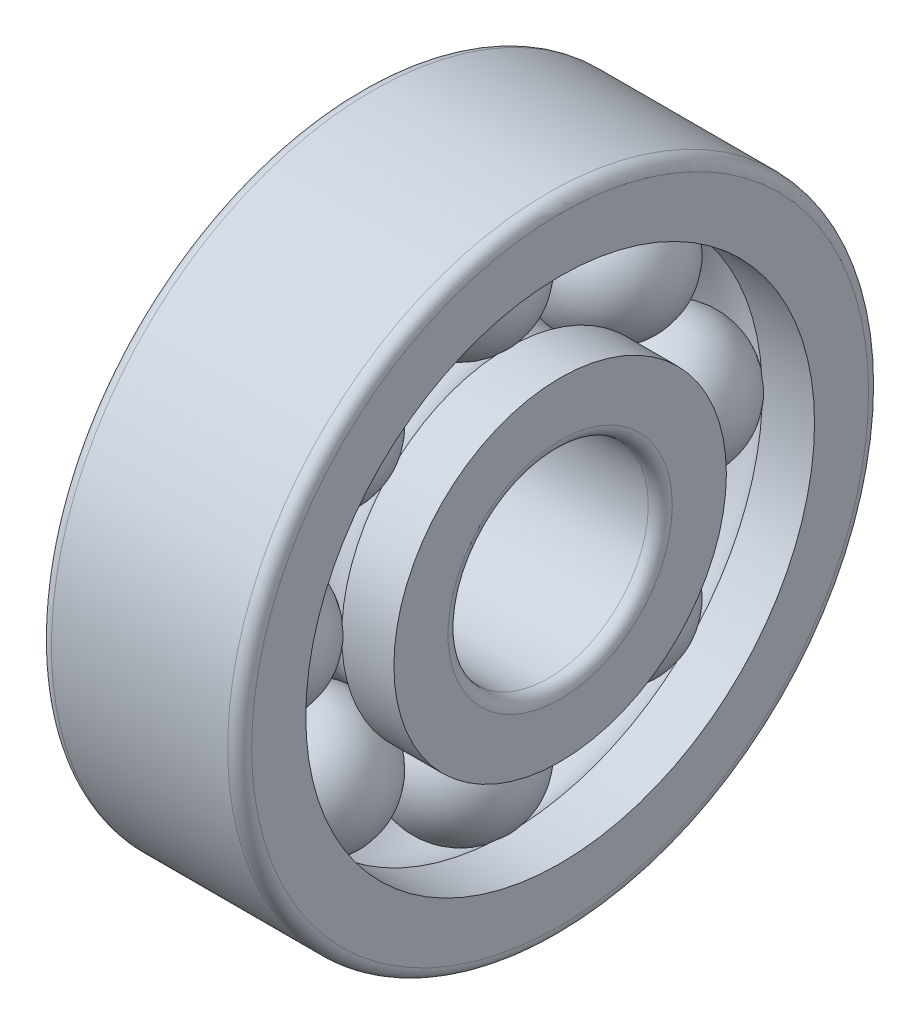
ISO-10303-21;
HEADER;
FILE_DESCRIPTION(('STEP AP214'),'2;1');
FILE_NAME('part.step','',(''),(''),'','','');
FILE_SCHEMA(('AUTOMOTIVE_DESIGN { 1 0 10303 214 1 1 1 1 }'));
ENDSEC;
DATA;
#1=APPLICATION_CONTEXT('core data for automotive mechanical design processes');
#2=APPLICATION_PROTOCOL_DEFINITION('international standard','automotive_design',2000,#1);
#3=PRODUCT_CONTEXT('',#1,'mechanical');
#4=PRODUCT('Part','Part','',(#3));
#5=PRODUCT_RELATED_PRODUCT_CATEGORY('part','',(#4));
#6=PRODUCT_DEFINITION_FORMATION('','',#4);
#7=PRODUCT_DEFINITION_CONTEXT('part definition',#1,'design');
#8=PRODUCT_DEFINITION('design','',#6,#7);
#9=PRODUCT_DEFINITION_SHAPE('','',#8);
#10=(LENGTH_UNIT() NAMED_UNIT(*) SI_UNIT(.MILLI.,.METRE.));
#11=(NAMED_UNIT(*) PLANE_ANGLE_UNIT() SI_UNIT($,.RADIAN.));
#12=(NAMED_UNIT(*) SI_UNIT($,.STERADIAN.) SOLID_ANGLE_UNIT());
#13=UNCERTAINTY_MEASURE_WITH_UNIT(LENGTH_MEASURE(1.E-05),#10,'distance_accuracy_value','');
#14=(GEOMETRIC_REPRESENTATION_CONTEXT(3) GLOBAL_UNCERTAINTY_ASSIGNED_CONTEXT((#13)) GLOBAL_UNIT_ASSIGNED_CONTEXT((#10,
#11,#12)) REPRESENTATION_CONTEXT('',''));
#15=CARTESIAN_POINT('',(0.,0.,0.));
#16=DIRECTION('',(0.,0.,1.));
#17=DIRECTION('',(1.,0.,0.));
#18=AXIS2_PLACEMENT_3D('',#15,#16,#17);
#19=CARTESIAN_POINT('',(0.,0.,0.));
#20=DIRECTION('',(1.,0.,0.));
#21=DIRECTION('',(0.,0.,-1.));
#22=AXIS2_PLACEMENT_3D('',#19,#20,#21);
#23=TOROIDAL_SURFACE('',#22,5.25,1.625);
#24=CARTESIAN_POINT('',(1.19608737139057,0.,0.));
#25=DIRECTION('',(1.,0.,0.));
#26=DIRECTION('',(0.,0.,-1.));
#27=AXIS2_PLACEMENT_3D('',#24,#25,#26);
#28=CIRCLE('',#27,4.15);
#29=CARTESIAN_POINT('',(1.19608737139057,2.7491747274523,3.1087840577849));
#30=VERTEX_POINT('',#29);
#31=CARTESIAN_POINT('',(1.19608737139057,0.254282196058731,4.14220238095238));
#32=VERTEX_POINT('',#31);
#33=EDGE_CURVE('E637',#30,#32,#28,.T.);
#34=ORIENTED_EDGE('',*,*,#33,.F.);
#35=CARTESIAN_POINT('',(-1.19628737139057,2.7493238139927,3.10894257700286));
#36=CARTESIAN_POINT('',(-1.16535311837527,2.72626048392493,3.08442009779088));
#37=CARTESIAN_POINT('',(-1.1330130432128,2.70410713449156,3.06085592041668));
#38=CARTESIAN_POINT('',(-1.06572695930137,2.66175218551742,3.01578831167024));
#39=CARTESIAN_POINT('',(-1.03078106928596,2.64155049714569,2.99428478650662));
#40=CARTESIAN_POINT('',(-0.922459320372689,2.58413144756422,2.93314618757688));
#41=CARTESIAN_POINT('',(-0.845494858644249,2.55002233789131,2.89680037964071));
#42=CARTESIAN_POINT('',(-0.684291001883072,2.49114668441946,2.83403484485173));
#43=CARTESIAN_POINT('',(-0.600048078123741,2.46638470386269,2.80761996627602));
#44=CARTESIAN_POINT('',(-0.4266793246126,2.42689299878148,2.76547998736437));
#45=CARTESIAN_POINT('',(-0.337554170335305,2.41216189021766,2.74975341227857));
#46=CARTESIAN_POINT('',(-0.15697919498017,2.39314737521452,2.72945222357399));
#47=CARTESIAN_POINT('',(-0.0655300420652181,2.38886099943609,2.7248744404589));
#48=CARTESIAN_POINT('',(0.11712776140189,2.3908445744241,2.72699259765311));
#49=CARTESIAN_POINT('',(0.208336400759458,2.39711500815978,2.73368905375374));
#50=CARTESIAN_POINT('',(0.387900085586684,2.42003708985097,2.75816032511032));
#51=CARTESIAN_POINT('',(0.476255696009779,2.43668666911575,2.77593293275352));
#52=CARTESIAN_POINT('',(0.647620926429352,2.47989886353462,2.8220360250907));
#53=CARTESIAN_POINT('',(0.730630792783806,2.50646102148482,2.85036602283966));
#54=CARTESIAN_POINT('',(0.881601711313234,2.56586718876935,2.91368398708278));
#55=CARTESIAN_POINT('',(0.950244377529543,2.59789802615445,2.94780856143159));
#56=CARTESIAN_POINT('',(1.04722193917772,2.65101430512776,3.00435854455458));
#57=CARTESIAN_POINT('',(1.07855969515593,2.66957191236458,3.02411002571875));
#58=CARTESIAN_POINT('',(1.13907963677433,2.7082789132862,3.06529328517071));
#59=CARTESIAN_POINT('',(1.16826159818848,2.72842847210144,3.0867252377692));
#60=CARTESIAN_POINT('',(1.19628737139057,2.74932381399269,3.10894257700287));
#61=B_SPLINE_CURVE_WITH_KNOTS('',3,(#35,#36,#37,#38,#39,#40,#41,#42,#43,#44,#45,#46,#47,#48,#49,
#50,#51,#52,#53,#54,#55,#56,#57,#58,#59,#60),.UNSPECIFIED.,.F.,.F.,(4,2,2,2,2,2,2,2,2,2,2,2,4),
(0.,0.137071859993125,0.274137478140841,0.547811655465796,0.821619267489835,1.09538909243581,
1.36908107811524,1.64278558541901,1.91643555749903,2.19007290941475,2.43828092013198,
2.56246945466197,2.68667088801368),.UNSPECIFIED.);
#62=CARTESIAN_POINT('',(-1.19608737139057,2.74917472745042,3.10878405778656));
#63=VERTEX_POINT('',#62);
#64=EDGE_CURVE('E432',#63,#30,#61,.T.);
#65=ORIENTED_EDGE('',*,*,#64,.F.);
#66=CARTESIAN_POINT('',(-1.19608737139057,0.,0.));
#67=DIRECTION('',(1.,0.,0.));
#68=DIRECTION('',(0.,0.,-1.));
#69=AXIS2_PLACEMENT_3D('',#66,#67,#68);
#70=CIRCLE('',#69,4.15);
#71=CARTESIAN_POINT('',(-1.19608737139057,0.254282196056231,4.14220238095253));
#72=VERTEX_POINT('',#71);
#73=EDGE_CURVE('E53',#63,#72,#70,.T.);
#74=ORIENTED_EDGE('',*,*,#73,.T.);
#75=CARTESIAN_POINT('',(1.19628737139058,0.254288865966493,4.14241989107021));
#76=CARTESIAN_POINT('',(1.16535311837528,0.253257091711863,4.10877164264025));
#77=CARTESIAN_POINT('',(1.13301304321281,0.252259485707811,4.07644446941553));
#78=CARTESIAN_POINT('',(1.06572695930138,0.250341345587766,4.01462738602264));
#79=CARTESIAN_POINT('',(1.03078106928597,0.249420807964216,3.98513734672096));
#80=CARTESIAN_POINT('',(0.9224593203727,0.246790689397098,3.90130442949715));
#81=CARTESIAN_POINT('',(0.845494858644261,0.245209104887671,3.85148527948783));
#82=CARTESIAN_POINT('',(0.684291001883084,0.242458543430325,3.76547197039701));
#83=CARTESIAN_POINT('',(0.600048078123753,0.241289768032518,3.7292844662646));
#84=CARTESIAN_POINT('',(0.426679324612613,0.23941715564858,3.67156214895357));
#85=CARTESIAN_POINT('',(0.337554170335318,0.238713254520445,3.65002531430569));
#86=CARTESIAN_POINT('',(0.156979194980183,0.237803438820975,3.62222491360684));
#87=CARTESIAN_POINT('',(0.0655300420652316,0.237597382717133,3.61595700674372));
#88=CARTESIAN_POINT('',(-0.117127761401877,0.237692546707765,3.61885736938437));
#89=CARTESIAN_POINT('',(-0.208336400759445,0.237993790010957,3.62802634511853));
#90=CARTESIAN_POINT('',(-0.387900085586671,0.239089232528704,3.66153850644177));
#91=CARTESIAN_POINT('',(-0.476255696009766,0.239883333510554,3.68587866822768));
#92=CARTESIAN_POINT('',(-0.64762092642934,0.241927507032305,3.74903411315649));
#93=CARTESIAN_POINT('',(-0.730630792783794,0.243177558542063,3.78784872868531));
#94=CARTESIAN_POINT('',(-0.881601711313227,0.245943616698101,3.87462779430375));
#95=CARTESIAN_POINT('',(-0.95024437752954,0.247424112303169,3.92140673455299));
#96=CARTESIAN_POINT('',(-1.04722193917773,0.249852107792,3.99895249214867));
#97=CARTESIAN_POINT('',(-1.07855969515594,0.250696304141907,4.02604110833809));
#98=CARTESIAN_POINT('',(-1.13907963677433,0.252447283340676,4.08253205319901));
#99=CARTESIAN_POINT('',(-1.16826159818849,0.253354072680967,4.11193462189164));
#100=CARTESIAN_POINT('',(-1.19628737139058,0.254288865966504,4.14241989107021));
#101=B_SPLINE_CURVE_WITH_KNOTS('',3,(#75,#76,#77,#78,#79,#80,#81,#82,#83,#84,#85,#86,#87,#88,
#89,#90,#91,#92,#93,#94,#95,#96,#97,#98,#99,#100),.UNSPECIFIED.,.F.,.F.,(4,2,2,2,2,2,2,2,2,2,2,
2,4),(0.,0.137071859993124,0.27413747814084,0.547811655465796,0.821619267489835,
1.09538909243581,1.36908107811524,1.64278558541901,1.91643555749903,2.19007290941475,
2.43828092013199,2.56246945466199,2.68667088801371),.UNSPECIFIED.);
#102=EDGE_CURVE('E515',#32,#72,#101,.T.);
#103=ORIENTED_EDGE('',*,*,#102,.F.);
#104=EDGE_LOOP('',(#34,#65,#74,#103));
#105=FACE_BOUND('',#104,.T.);
#106=ADVANCED_FACE('F33',(#105),#23,.F.);
#107=CARTESIAN_POINT('',(0.,0.,0.));
#108=DIRECTION('',(1.,0.,0.));
#109=DIRECTION('',(0.,0.,-1.));
#110=AXIS2_PLACEMENT_3D('',#107,#108,#109);
#111=TOROIDAL_SURFACE('',#110,5.25000000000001,1.625);
#112=CARTESIAN_POINT('',(1.19608737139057,0.,0.));
#113=DIRECTION('',(1.,0.,0.));
#114=DIRECTION('',(0.,0.,-1.));
#115=AXIS2_PLACEMENT_3D('',#112,#113,#114);
#116=CIRCLE('',#115,6.35);
#117=CARTESIAN_POINT('',(1.19608737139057,4.26216323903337,4.70706538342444));
#118=VERTEX_POINT('',#117);
#119=CARTESIAN_POINT('',(1.19608737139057,0.314593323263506,6.34220238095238));
#120=VERTEX_POINT('',#119);
#121=EDGE_CURVE('E621',#118,#120,#116,.T.);
#122=ORIENTED_EDGE('',*,*,#121,.T.);
#123=CARTESIAN_POINT('',(-1.19628737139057,0.314587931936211,6.34198487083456));
#124=CARTESIAN_POINT('',(-1.16535126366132,0.315422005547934,6.37563514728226));
#125=CARTESIAN_POINT('',(-1.13300923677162,0.316220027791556,6.40796409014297));
#126=CARTESIAN_POINT('',(-1.06571929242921,0.317740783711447,6.46978411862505));
#127=CARTESIAN_POINT('',(-1.03077149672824,0.318463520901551,6.49927533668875));
#128=CARTESIAN_POINT('',(-0.922445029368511,0.320511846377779,6.5831103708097));
#129=CARTESIAN_POINT('',(-0.845478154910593,0.321720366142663,6.63292968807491));
#130=CARTESIAN_POINT('',(-0.684272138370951,0.323798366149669,6.71894156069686));
#131=CARTESIAN_POINT('',(-0.600029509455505,0.324667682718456,6.75512753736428));
#132=CARTESIAN_POINT('',(-0.426663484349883,0.326050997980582,6.81284682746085));
#133=CARTESIAN_POINT('',(-0.337540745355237,0.326565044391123,6.83438210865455));
#134=CARTESIAN_POINT('',(-0.156956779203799,0.32722818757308,6.86218270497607));
#135=CARTESIAN_POINT('',(-0.0654958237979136,0.327377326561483,6.86844978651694));
#136=CARTESIAN_POINT('',(0.117185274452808,0.32730810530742,6.86554390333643));
#137=CARTESIAN_POINT('',(0.208405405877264,0.327089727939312,6.85637021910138));
#138=CARTESIAN_POINT('',(0.388002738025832,0.32628946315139,6.82284241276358));
#139=CARTESIAN_POINT('',(0.476380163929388,0.325707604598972,6.79848949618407));
#140=CARTESIAN_POINT('',(0.647786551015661,0.324191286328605,6.73530031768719));
#141=CARTESIAN_POINT('',(0.730815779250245,0.323256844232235,6.69646477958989));
#142=CARTESIAN_POINT('',(0.881762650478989,0.321156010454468,6.60967076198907));
#143=CARTESIAN_POINT('',(0.950367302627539,0.320019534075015,6.56290716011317));
#144=CARTESIAN_POINT('',(1.0472939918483,0.318123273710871,6.4853909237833));
#145=CARTESIAN_POINT('',(1.07861583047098,0.317459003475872,6.4583132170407));
#146=CARTESIAN_POINT('',(1.13910608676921,0.316068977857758,6.40184605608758));
#147=CARTESIAN_POINT('',(1.16827427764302,0.315343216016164,6.3724563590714));
#148=CARTESIAN_POINT('',(1.19628737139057,0.314587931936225,6.34198487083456));
#149=B_SPLINE_CURVE_WITH_KNOTS('',3,(#123,#124,#125,#126,#127,#128,#129,#130,#131,#132,#133,
#134,#135,#136,#137,#138,#139,#140,#141,#142,#143,#144,#145,#146,#147,#148),.UNSPECIFIED.,.F.,
.F.,(4,2,2,2,2,2,2,2,2,2,2,2,4),(0.,0.137067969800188,0.274129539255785,0.547793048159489,
0.821588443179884,1.09534705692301,1.36907399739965,1.64281369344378,1.91653165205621,
2.19023593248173,2.4383092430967,2.56243055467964,2.68656491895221),.UNSPECIFIED.);
#150=CARTESIAN_POINT('',(-1.19608737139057,0.3145933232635,6.34220238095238));
#151=VERTEX_POINT('',#150);
#152=EDGE_CURVE('E392',#151,#120,#149,.T.);
#153=ORIENTED_EDGE('',*,*,#152,.F.);
#154=CARTESIAN_POINT('',(-1.19608737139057,0.,0.));
#155=DIRECTION('',(1.,0.,0.));
#156=DIRECTION('',(0.,0.,-1.));
#157=AXIS2_PLACEMENT_3D('',#154,#155,#156);
#158=CIRCLE('',#157,6.35);
#159=CARTESIAN_POINT('',(-1.19608737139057,4.26216323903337,4.70706538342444));
#160=VERTEX_POINT('',#159);
#161=EDGE_CURVE('E272',#160,#151,#158,.T.);
#162=ORIENTED_EDGE('',*,*,#161,.F.);
#163=CARTESIAN_POINT('',(1.19628737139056,4.26201324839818,4.70690776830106));
#164=CARTESIAN_POINT('',(1.16535126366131,4.28521780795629,4.73129188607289));
#165=CARTESIAN_POINT('',(1.13300923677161,4.30751353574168,4.75471618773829));
#166=CARTESIAN_POINT('',(1.0657192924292,4.35015156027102,4.7995048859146));
#167=CARTESIAN_POINT('',(1.03077149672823,4.37049394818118,4.82086937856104));
#168=CARTESIAN_POINT('',(0.922445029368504,4.42832588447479,4.88159808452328));
#169=CARTESIAN_POINT('',(0.845478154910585,4.46269890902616,4.91768021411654));
#170=CARTESIAN_POINT('',(0.684272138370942,4.52204911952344,4.97996916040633));
#171=CARTESIAN_POINT('',(0.600029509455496,4.54702176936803,5.00617120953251));
#172=CARTESIAN_POINT('',(0.426663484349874,4.58685731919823,5.04796306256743));
#173=CARTESIAN_POINT('',(0.337540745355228,4.60172157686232,5.06355429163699));
#174=CARTESIAN_POINT('',(0.15695677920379,4.62091065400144,5.08368119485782));
#175=CARTESIAN_POINT('',(0.0654958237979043,4.62523669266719,5.08821814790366));
#176=CARTESIAN_POINT('',(-0.117185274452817,4.62323086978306,5.08611443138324));
#177=CARTESIAN_POINT('',(-0.208405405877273,4.61689851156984,5.07947324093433));
#178=CARTESIAN_POINT('',(-0.388002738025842,4.59375664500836,5.05519962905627));
#179=CARTESIAN_POINT('',(-0.476380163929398,4.57694796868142,5.03756808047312));
#180=CARTESIAN_POINT('',(-0.64778655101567,4.53333867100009,4.99181438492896));
#181=CARTESIAN_POINT('',(-0.730815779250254,4.50653854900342,4.96369276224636));
#182=CARTESIAN_POINT('',(-0.881762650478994,4.44665142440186,4.90083461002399));
#183=CARTESIAN_POINT('',(-0.950367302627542,4.41438817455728,4.86696413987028));
#184=CARTESIAN_POINT('',(-1.04729399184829,4.36091677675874,4.81081102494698));
#185=CARTESIAN_POINT('',(-1.07861583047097,4.34223965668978,4.79119448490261));
#186=CARTESIAN_POINT('',(-1.1391060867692,4.30329424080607,4.75028327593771));
#187=CARTESIAN_POINT('',(-1.16827427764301,4.28302577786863,4.72898843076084));
#188=CARTESIAN_POINT('',(-1.19628737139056,4.26201324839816,4.70690776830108));
#189=B_SPLINE_CURVE_WITH_KNOTS('',3,(#163,#164,#165,#166,#167,#168,#169,#170,#171,#172,#173,
#174,#175,#176,#177,#178,#179,#180,#181,#182,#183,#184,#185,#186,#187,#188),.UNSPECIFIED.,.F.,
.F.,(4,2,2,2,2,2,2,2,2,2,2,2,4),(0.,0.137067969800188,0.274129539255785,0.54779304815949,
0.821588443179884,1.09534705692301,1.36907399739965,1.64281369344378,1.91653165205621,
2.19023593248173,2.43830924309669,2.56243055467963,2.6865649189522),.UNSPECIFIED.);
#190=EDGE_CURVE('E420',#118,#160,#189,.T.);
#191=ORIENTED_EDGE('',*,*,#190,.F.);
#192=EDGE_LOOP('',(#122,#153,#162,#191));
#193=FACE_BOUND('',#192,.T.);
#194=ADVANCED_FACE('F301',(#193),#111,.F.);
#195=CARTESIAN_POINT('',(0.,3.71231060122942,3.71231060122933));
#196=DIRECTION('',(1.,0.,0.));
#197=DIRECTION('',(0.,-0.707106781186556,-0.707106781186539));
#198=AXIS2_PLACEMENT_3D('',#195,#196,#197);
#199=SPHERICAL_SURFACE('',#198,1.65);
#200=CARTESIAN_POINT('',(-1.19628737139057,4.70690776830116,4.26201324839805));
#201=CARTESIAN_POINT('',(-1.16535126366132,4.73129188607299,4.28521780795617));
#202=CARTESIAN_POINT('',(-1.13300923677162,4.75471618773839,4.30751353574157));
#203=CARTESIAN_POINT('',(-1.06571929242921,4.7995048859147,4.3501515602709));
#204=CARTESIAN_POINT('',(-1.03077149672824,4.82086937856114,4.37049394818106));
#205=CARTESIAN_POINT('',(-0.922445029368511,4.88159808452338,4.42832588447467));
#206=CARTESIAN_POINT('',(-0.845478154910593,4.91768021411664,4.46269890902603));
#207=CARTESIAN_POINT('',(-0.684272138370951,4.97996916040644,4.52204911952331));
#208=CARTESIAN_POINT('',(-0.600029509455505,5.00617120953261,4.54702176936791));
#209=CARTESIAN_POINT('',(-0.426663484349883,5.04796306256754,4.5868573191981));
#210=CARTESIAN_POINT('',(-0.337540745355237,5.06355429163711,4.60172157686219));
#211=CARTESIAN_POINT('',(-0.156956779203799,5.08368119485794,4.62091065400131));
#212=CARTESIAN_POINT('',(-0.0654958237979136,5.08821814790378,4.62523669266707));
#213=CARTESIAN_POINT('',(0.117185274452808,5.08611443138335,4.62323086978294));
#214=CARTESIAN_POINT('',(0.208405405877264,5.07947324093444,4.61689851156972));
#215=CARTESIAN_POINT('',(0.388002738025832,5.05519962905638,4.59375664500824));
#216=CARTESIAN_POINT('',(0.476380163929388,5.03756808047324,4.5769479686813));
#217=CARTESIAN_POINT('',(0.64778655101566,4.99181438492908,4.53333867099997));
#218=CARTESIAN_POINT('',(0.730815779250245,4.96369276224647,4.50653854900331));
#219=CARTESIAN_POINT('',(0.881762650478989,4.9008346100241,4.44665142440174));
#220=CARTESIAN_POINT('',(0.950367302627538,4.86696413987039,4.41438817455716));
#221=CARTESIAN_POINT('',(1.04729399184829,4.81081102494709,4.36091677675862));
#222=CARTESIAN_POINT('',(1.07861583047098,4.79119448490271,4.34223965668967));
#223=CARTESIAN_POINT('',(1.13910608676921,4.75028327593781,4.30329424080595));
#224=CARTESIAN_POINT('',(1.16827427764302,4.72898843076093,4.28302577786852));
#225=CARTESIAN_POINT('',(1.19628737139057,4.70690776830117,4.26201324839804));
#226=B_SPLINE_CURVE_WITH_KNOTS('',3,(#200,#201,#202,#203,#204,#205,#206,#207,#208,#209,#210,
#211,#212,#213,#214,#215,#216,#217,#218,#219,#220,#221,#222,#223,#224,#225),.UNSPECIFIED.,.F.,
.F.,(4,2,2,2,2,2,2,2,2,2,2,2,4),(0.,0.137067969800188,0.274129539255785,0.54779304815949,
0.821588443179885,1.09534705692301,1.36907399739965,1.64281369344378,1.91653165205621,
2.19023593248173,2.4383092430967,2.56243055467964,2.68656491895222),.UNSPECIFIED.);
#227=CARTESIAN_POINT('',(-1.19608737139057,4.70706538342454,4.26216323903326));
#228=VERTEX_POINT('',#227);
#229=CARTESIAN_POINT('',(1.19608737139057,4.70706538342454,4.26216323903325));
#230=VERTEX_POINT('',#229);
#231=EDGE_CURVE('E268',#228,#230,#226,.T.);
#232=ORIENTED_EDGE('',*,*,#231,.T.);
#233=CARTESIAN_POINT('',(1.19588737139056,4.70768170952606,4.26148247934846));
#234=CARTESIAN_POINT('',(1.20461480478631,4.68082040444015,4.29115767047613));
#235=CARTESIAN_POINT('',(1.21166744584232,4.65344717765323,4.32083015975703));
#236=CARTESIAN_POINT('',(1.22240470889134,4.59782543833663,4.37997181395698));
#237=CARTESIAN_POINT('',(1.22608884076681,4.56957679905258,4.4094409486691));
#238=CARTESIAN_POINT('',(1.23198166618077,4.48484634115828,4.49611457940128));
#239=CARTESIAN_POINT('',(1.22936350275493,4.42734072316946,4.55273512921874));
#240=CARTESIAN_POINT('',(1.21461355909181,4.33351431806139,4.6417327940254));
#241=CARTESIAN_POINT('',(1.20649012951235,4.29747678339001,4.67512163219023));
#242=CARTESIAN_POINT('',(1.19588737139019,4.2614824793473,4.7076817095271));
#243=B_SPLINE_CURVE_WITH_KNOTS('',3,(#233,#234,#235,#236,#237,#238,#239,#240,#241,#242),
.UNSPECIFIED.,.F.,.F.,(4,2,2,2,4),(0.,0.122818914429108,0.245655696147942,0.486633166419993,
0.635722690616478),.UNSPECIFIED.);
#244=EDGE_CURVE('E410',#230,#118,#243,.T.);
#245=ORIENTED_EDGE('',*,*,#244,.T.);
#246=ORIENTED_EDGE('',*,*,#190,.T.);
#247=CARTESIAN_POINT('',(-1.19588737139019,4.2614824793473,4.7076817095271));
#248=CARTESIAN_POINT('',(-1.20461480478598,4.29115767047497,4.68082040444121));
#249=CARTESIAN_POINT('',(-1.21166744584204,4.32083015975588,4.65344717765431));
#250=CARTESIAN_POINT('',(-1.22240470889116,4.37997181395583,4.59782543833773));
#251=CARTESIAN_POINT('',(-1.22608884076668,4.40944094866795,4.56957679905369));
#252=CARTESIAN_POINT('',(-1.23198166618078,4.49611457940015,4.48484634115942));
#253=CARTESIAN_POINT('',(-1.22936350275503,4.55273512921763,4.42734072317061));
#254=CARTESIAN_POINT('',(-1.21461355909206,4.64173279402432,4.33351431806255));
#255=CARTESIAN_POINT('',(-1.20649012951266,4.67512163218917,4.29747678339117));
#256=CARTESIAN_POINT('',(-1.19588737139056,4.70768170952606,4.26148247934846));
#257=B_SPLINE_CURVE_WITH_KNOTS('',3,(#247,#248,#249,#250,#251,#252,#253,#254,#255,#256),
.UNSPECIFIED.,.F.,.F.,(4,2,2,2,4),(0.,0.122818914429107,0.245655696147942,0.486633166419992,
0.635722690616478),.UNSPECIFIED.);
#258=EDGE_CURVE('E426',#160,#228,#257,.T.);
#259=ORIENTED_EDGE('',*,*,#258,.T.);
#260=EDGE_LOOP('',(#232,#245,#246,#259));
#261=FACE_BOUND('',#260,.T.);
#262=ORIENTED_EDGE('',*,*,#64,.T.);
#263=CARTESIAN_POINT('',(1.1958873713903,2.74861847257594,3.10927587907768));
#264=CARTESIAN_POINT('',(1.21010216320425,2.78788526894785,3.07462243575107));
#265=CARTESIAN_POINT('',(1.21988275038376,2.82736061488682,3.03834649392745));
#266=CARTESIAN_POINT('',(1.23033917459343,2.90462563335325,2.96451444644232));
#267=CARTESIAN_POINT('',(1.2312141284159,2.94243325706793,2.927005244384));
#268=CARTESIAN_POINT('',(1.2256330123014,3.00162777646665,2.86596895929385));
#269=CARTESIAN_POINT('',(1.22192631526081,3.0236218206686,2.84274814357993));
#270=CARTESIAN_POINT('',(1.21132390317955,3.0670259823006,2.79586955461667));
#271=CARTESIAN_POINT('',(1.20438466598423,3.08842376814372,2.77221018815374));
#272=CARTESIAN_POINT('',(1.1958873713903,3.10927587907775,2.74861847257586));
#273=B_SPLINE_CURVE_WITH_KNOTS('',3,(#263,#264,#265,#266,#267,#268,#269,#270,#271,#272),
.UNSPECIFIED.,.F.,.F.,(4,2,2,2,4),(0.,0.16266002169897,0.321674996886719,0.418115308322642,
0.515893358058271),.UNSPECIFIED.);
#274=CARTESIAN_POINT('',(1.19608737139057,3.10878405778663,2.74917472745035));
#275=VERTEX_POINT('',#274);
#276=EDGE_CURVE('E1193',#30,#275,#273,.T.);
#277=ORIENTED_EDGE('',*,*,#276,.T.);
#278=CARTESIAN_POINT('',(1.19628737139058,3.10894257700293,2.74932381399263));
#279=CARTESIAN_POINT('',(1.16535311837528,3.08442009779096,2.72626048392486));
#280=CARTESIAN_POINT('',(1.13301304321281,3.06085592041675,2.70410713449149));
#281=CARTESIAN_POINT('',(1.06572695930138,3.01578831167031,2.66175218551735));
#282=CARTESIAN_POINT('',(1.03078106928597,2.99428478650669,2.64155049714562));
#283=CARTESIAN_POINT('',(0.9224593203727,2.93314618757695,2.58413144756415));
#284=CARTESIAN_POINT('',(0.845494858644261,2.89680037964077,2.55002233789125));
#285=CARTESIAN_POINT('',(0.684291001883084,2.83403484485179,2.49114668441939));
#286=CARTESIAN_POINT('',(0.600048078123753,2.80761996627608,2.46638470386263));
#287=CARTESIAN_POINT('',(0.426679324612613,2.76547998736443,2.42689299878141));
#288=CARTESIAN_POINT('',(0.337554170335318,2.74975341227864,2.41216189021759));
#289=CARTESIAN_POINT('',(0.156979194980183,2.72945222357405,2.39314737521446));
#290=CARTESIAN_POINT('',(0.0655300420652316,2.72487444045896,2.38886099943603));
#291=CARTESIAN_POINT('',(-0.117127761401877,2.72699259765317,2.39084457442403));
#292=CARTESIAN_POINT('',(-0.208336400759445,2.7336890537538,2.39711500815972));
#293=CARTESIAN_POINT('',(-0.387900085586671,2.75816032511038,2.4200370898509));
#294=CARTESIAN_POINT('',(-0.476255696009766,2.77593293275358,2.43668666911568));
#295=CARTESIAN_POINT('',(-0.647620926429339,2.82203602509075,2.47989886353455));
#296=CARTESIAN_POINT('',(-0.730630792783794,2.85036602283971,2.50646102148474));
#297=CARTESIAN_POINT('',(-0.881601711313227,2.91368398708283,2.56586718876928));
#298=CARTESIAN_POINT('',(-0.950244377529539,2.94780856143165,2.59789802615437));
#299=CARTESIAN_POINT('',(-1.04722193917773,3.00435854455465,2.65101430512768));
#300=CARTESIAN_POINT('',(-1.07855969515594,3.02411002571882,2.66957191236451));
#301=CARTESIAN_POINT('',(-1.13907963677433,3.06529328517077,2.70827891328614));
#302=CARTESIAN_POINT('',(-1.16826159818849,3.08672523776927,2.72842847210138));
#303=CARTESIAN_POINT('',(-1.19628737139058,3.10894257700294,2.74932381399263));
#304=B_SPLINE_CURVE_WITH_KNOTS('',3,(#278,#279,#280,#281,#282,#283,#284,#285,#286,#287,#288,
#289,#290,#291,#292,#293,#294,#295,#296,#297,#298,#299,#300,#301,#302,#303),.UNSPECIFIED.,.F.,
.F.,(4,2,2,2,2,2,2,2,2,2,2,2,4),(0.,0.137071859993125,0.274137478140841,0.547811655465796,
0.821619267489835,1.09538909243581,1.36908107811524,1.64278558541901,1.91643555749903,
2.19007290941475,2.43828092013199,2.56246945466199,2.68667088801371),.UNSPECIFIED.);
#305=CARTESIAN_POINT('',(-1.19608737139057,3.10878405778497,2.74917472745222));
#306=VERTEX_POINT('',#305);
#307=EDGE_CURVE('E46',#275,#306,#304,.T.);
#308=ORIENTED_EDGE('',*,*,#307,.T.);
#309=CARTESIAN_POINT('',(-1.1958873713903,3.10927587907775,2.74861847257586));
#310=CARTESIAN_POINT('',(-1.21010216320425,3.07462243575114,2.78788526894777));
#311=CARTESIAN_POINT('',(-1.21988275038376,3.03834649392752,2.82736061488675));
#312=CARTESIAN_POINT('',(-1.23033917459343,2.96451444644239,2.90462563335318));
#313=CARTESIAN_POINT('',(-1.2312141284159,2.92700524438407,2.94243325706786));
#314=CARTESIAN_POINT('',(-1.2256330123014,2.86596895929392,3.00162777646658));
#315=CARTESIAN_POINT('',(-1.22192631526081,2.84274814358,3.02362182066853));
#316=CARTESIAN_POINT('',(-1.21132390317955,2.79586955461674,3.06702598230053));
#317=CARTESIAN_POINT('',(-1.20438466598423,2.77221018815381,3.08842376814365));
#318=CARTESIAN_POINT('',(-1.1958873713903,2.74861847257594,3.10927587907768));
#319=B_SPLINE_CURVE_WITH_KNOTS('',3,(#309,#310,#311,#312,#313,#314,#315,#316,#317,#318),
.UNSPECIFIED.,.F.,.F.,(4,2,2,2,4),(0.,0.162660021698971,0.321674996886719,0.418115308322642,
0.515893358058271),.UNSPECIFIED.);
#320=EDGE_CURVE('E11',#306,#63,#319,.T.);
#321=ORIENTED_EDGE('',*,*,#320,.T.);
#322=EDGE_LOOP('',(#262,#277,#308,#321));
#323=FACE_BOUND('',#322,.T.);
#324=ADVANCED_FACE('F35',(#261,#323),#199,.T.);
#325=CARTESIAN_POINT('',(1.19608737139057,-0.254282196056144,4.14220238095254));
#326=VERTEX_POINT('',#325);
#327=CARTESIAN_POINT('',(1.19608737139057,-2.74917472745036,3.10878405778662));
#328=VERTEX_POINT('',#327);
#329=EDGE_CURVE('E626',#326,#328,#28,.T.);
#330=ORIENTED_EDGE('',*,*,#329,.F.);
#331=CARTESIAN_POINT('',(-1.19628737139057,-0.254288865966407,4.1424198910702));
#332=CARTESIAN_POINT('',(-1.16535311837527,-0.253257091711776,4.10877164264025));
#333=CARTESIAN_POINT('',(-1.1330130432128,-0.252259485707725,4.07644446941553));
#334=CARTESIAN_POINT('',(-1.06572695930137,-0.250341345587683,4.01462738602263));
#335=CARTESIAN_POINT('',(-1.03078106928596,-0.249420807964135,3.98513734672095));
#336=CARTESIAN_POINT('',(-0.922459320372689,-0.24679068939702,3.90130442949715));
#337=CARTESIAN_POINT('',(-0.845494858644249,-0.245209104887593,3.85148527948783));
#338=CARTESIAN_POINT('',(-0.684291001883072,-0.242458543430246,3.765471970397));
#339=CARTESIAN_POINT('',(-0.600048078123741,-0.241289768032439,3.7292844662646));
#340=CARTESIAN_POINT('',(-0.4266793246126,-0.239417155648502,3.67156214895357));
#341=CARTESIAN_POINT('',(-0.337554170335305,-0.238713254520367,3.6500253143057));
#342=CARTESIAN_POINT('',(-0.15697919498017,-0.237803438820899,3.62222491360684));
#343=CARTESIAN_POINT('',(-0.0655300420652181,-0.237597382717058,3.61595700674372));
#344=CARTESIAN_POINT('',(0.11712776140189,-0.23769254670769,3.61885736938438));
#345=CARTESIAN_POINT('',(0.208336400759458,-0.237993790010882,3.62802634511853));
#346=CARTESIAN_POINT('',(0.387900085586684,-0.239089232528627,3.66153850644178));
#347=CARTESIAN_POINT('',(0.476255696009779,-0.239883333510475,3.68587866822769));
#348=CARTESIAN_POINT('',(0.647620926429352,-0.241927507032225,3.7490341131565));
#349=CARTESIAN_POINT('',(0.730630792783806,-0.243177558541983,3.78784872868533));
#350=CARTESIAN_POINT('',(0.881601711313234,-0.245943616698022,3.87462779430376));
#351=CARTESIAN_POINT('',(0.950244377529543,-0.24742411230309,3.921406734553));
#352=CARTESIAN_POINT('',(1.04722193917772,-0.249852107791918,3.99895249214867));
#353=CARTESIAN_POINT('',(1.07855969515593,-0.250696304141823,4.02604110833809));
#354=CARTESIAN_POINT('',(1.13907963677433,-0.252447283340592,4.08253205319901));
#355=CARTESIAN_POINT('',(1.16826159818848,-0.253354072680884,4.11193462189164));
#356=CARTESIAN_POINT('',(1.19628737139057,-0.254288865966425,4.1424198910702));
#357=B_SPLINE_CURVE_WITH_KNOTS('',3,(#331,#332,#333,#334,#335,#336,#337,#338,#339,#340,#341,
#342,#343,#344,#345,#346,#347,#348,#349,#350,#351,#352,#353,#354,#355,#356),.UNSPECIFIED.,.F.,
.F.,(4,2,2,2,2,2,2,2,2,2,2,2,4),(0.,0.137071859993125,0.274137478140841,0.547811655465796,
0.821619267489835,1.09538909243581,1.36908107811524,1.64278558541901,1.91643555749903,
2.19007290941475,2.43828092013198,2.56246945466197,2.68667088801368),.UNSPECIFIED.);
#358=CARTESIAN_POINT('',(-1.19608737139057,-0.254282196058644,4.14220238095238));
#359=VERTEX_POINT('',#358);
#360=EDGE_CURVE('E486',#359,#326,#357,.T.);
#361=ORIENTED_EDGE('',*,*,#360,.F.);
#362=CARTESIAN_POINT('',(-1.19608737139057,-2.74917472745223,3.10878405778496));
#363=VERTEX_POINT('',#362);
#364=EDGE_CURVE('E728',#359,#363,#70,.T.);
#365=ORIENTED_EDGE('',*,*,#364,.T.);
#366=CARTESIAN_POINT('',(1.19628737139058,-2.74932381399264,3.10894257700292));
#367=CARTESIAN_POINT('',(1.16535311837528,-2.72626048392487,3.08442009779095));
#368=CARTESIAN_POINT('',(1.13301304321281,-2.7041071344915,3.06085592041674));
#369=CARTESIAN_POINT('',(1.06572695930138,-2.66175218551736,3.0157883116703));
#370=CARTESIAN_POINT('',(1.03078106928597,-2.64155049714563,2.99428478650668));
#371=CARTESIAN_POINT('',(0.9224593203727,-2.58413144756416,2.93314618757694));
#372=CARTESIAN_POINT('',(0.845494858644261,-2.55002233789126,2.89680037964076));
#373=CARTESIAN_POINT('',(0.684291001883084,-2.4911466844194,2.83403484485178));
#374=CARTESIAN_POINT('',(0.600048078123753,-2.46638470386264,2.80761996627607));
#375=CARTESIAN_POINT('',(0.426679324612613,-2.42689299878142,2.76547998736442));
#376=CARTESIAN_POINT('',(0.337554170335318,-2.4121618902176,2.74975341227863));
#377=CARTESIAN_POINT('',(0.156979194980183,-2.39314737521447,2.72945222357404));
#378=CARTESIAN_POINT('',(0.0655300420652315,-2.38886099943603,2.72487444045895));
#379=CARTESIAN_POINT('',(-0.117127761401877,-2.39084457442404,2.72699259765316));
#380=CARTESIAN_POINT('',(-0.208336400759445,-2.39711500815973,2.73368905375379));
#381=CARTESIAN_POINT('',(-0.387900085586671,-2.42003708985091,2.75816032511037));
#382=CARTESIAN_POINT('',(-0.476255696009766,-2.43668666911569,2.77593293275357));
#383=CARTESIAN_POINT('',(-0.64762092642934,-2.47989886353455,2.82203602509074));
#384=CARTESIAN_POINT('',(-0.730630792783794,-2.50646102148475,2.8503660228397));
#385=CARTESIAN_POINT('',(-0.881601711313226,-2.56586718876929,2.91368398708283));
#386=CARTESIAN_POINT('',(-0.950244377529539,-2.59789802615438,2.94780856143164));
#387=CARTESIAN_POINT('',(-1.04722193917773,-2.65101430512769,3.00435854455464));
#388=CARTESIAN_POINT('',(-1.07855969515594,-2.66957191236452,3.02411002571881));
#389=CARTESIAN_POINT('',(-1.13907963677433,-2.70827891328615,3.06529328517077));
#390=CARTESIAN_POINT('',(-1.16826159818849,-2.72842847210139,3.08672523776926));
#391=CARTESIAN_POINT('',(-1.19628737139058,-2.74932381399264,3.10894257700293));
#392=B_SPLINE_CURVE_WITH_KNOTS('',3,(#366,#367,#368,#369,#370,#371,#372,#373,#374,#375,#376,
#377,#378,#379,#380,#381,#382,#383,#384,#385,#386,#387,#388,#389,#390,#391),.UNSPECIFIED.,.F.,
.F.,(4,2,2,2,2,2,2,2,2,2,2,2,4),(0.,0.137071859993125,0.27413747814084,0.547811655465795,
0.821619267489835,1.09538909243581,1.36908107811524,1.64278558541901,1.91643555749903,
2.19007290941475,2.43828092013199,2.56246945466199,2.68667088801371),.UNSPECIFIED.);
#393=EDGE_CURVE('E599',#328,#363,#392,.T.);
#394=ORIENTED_EDGE('',*,*,#393,.F.);
#395=EDGE_LOOP('',(#330,#361,#365,#394));
#396=FACE_BOUND('',#395,.T.);
#397=ADVANCED_FACE('F801',(#396),#23,.F.);
#398=CARTESIAN_POINT('',(1.19608737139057,-0.314593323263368,6.34220238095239));
#399=VERTEX_POINT('',#398);
#400=CARTESIAN_POINT('',(1.19608737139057,-4.26216323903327,4.70706538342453));
#401=VERTEX_POINT('',#400);
#402=EDGE_CURVE('E614',#399,#401,#116,.T.);
#403=ORIENTED_EDGE('',*,*,#402,.T.);
#404=CARTESIAN_POINT('',(-1.19628737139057,-4.26201324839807,4.70690776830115));
#405=CARTESIAN_POINT('',(-1.16535126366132,-4.28521780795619,4.73129188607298));
#406=CARTESIAN_POINT('',(-1.13300923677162,-4.30751353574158,4.75471618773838));
#407=CARTESIAN_POINT('',(-1.06571929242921,-4.35015156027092,4.79950488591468));
#408=CARTESIAN_POINT('',(-1.03077149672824,-4.37049394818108,4.82086937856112));
#409=CARTESIAN_POINT('',(-0.922445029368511,-4.42832588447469,4.88159808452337));
#410=CARTESIAN_POINT('',(-0.845478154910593,-4.46269890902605,4.91768021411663));
#411=CARTESIAN_POINT('',(-0.684272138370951,-4.52204911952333,4.97996916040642));
#412=CARTESIAN_POINT('',(-0.600029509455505,-4.54702176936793,5.0061712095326));
#413=CARTESIAN_POINT('',(-0.426663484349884,-4.58685731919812,5.04796306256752));
#414=CARTESIAN_POINT('',(-0.337540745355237,-4.60172157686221,5.06355429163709));
#415=CARTESIAN_POINT('',(-0.156956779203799,-4.62091065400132,5.08368119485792));
#416=CARTESIAN_POINT('',(-0.0654958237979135,-4.62523669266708,5.08821814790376));
#417=CARTESIAN_POINT('',(0.117185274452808,-4.62323086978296,5.08611443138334));
#418=CARTESIAN_POINT('',(0.208405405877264,-4.61689851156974,5.07947324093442));
#419=CARTESIAN_POINT('',(0.388002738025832,-4.59375664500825,5.05519962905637));
#420=CARTESIAN_POINT('',(0.476380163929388,-4.57694796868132,5.03756808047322));
#421=CARTESIAN_POINT('',(0.647786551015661,-4.53333867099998,4.99181438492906));
#422=CARTESIAN_POINT('',(0.730815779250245,-4.50653854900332,4.96369276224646));
#423=CARTESIAN_POINT('',(0.881762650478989,-4.44665142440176,4.90083461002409));
#424=CARTESIAN_POINT('',(0.950367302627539,-4.41438817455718,4.86696413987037));
#425=CARTESIAN_POINT('',(1.0472939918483,-4.36091677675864,4.81081102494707));
#426=CARTESIAN_POINT('',(1.07861583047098,-4.34223965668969,4.79119448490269));
#427=CARTESIAN_POINT('',(1.13910608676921,-4.30329424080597,4.75028327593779));
#428=CARTESIAN_POINT('',(1.16827427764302,-4.28302577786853,4.72898843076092));
#429=CARTESIAN_POINT('',(1.19628737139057,-4.26201324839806,4.70690776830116));
#430=B_SPLINE_CURVE_WITH_KNOTS('',3,(#404,#405,#406,#407,#408,#409,#410,#411,#412,#413,#414,
#415,#416,#417,#418,#419,#420,#421,#422,#423,#424,#425,#426,#427,#428,#429),.UNSPECIFIED.,.F.,
.F.,(4,2,2,2,2,2,2,2,2,2,2,2,4),(0.,0.137067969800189,0.274129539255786,0.54779304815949,
0.821588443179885,1.09534705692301,1.36907399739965,1.64281369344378,1.91653165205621,
2.19023593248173,2.4383092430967,2.56243055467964,2.68656491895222),.UNSPECIFIED.);
#431=CARTESIAN_POINT('',(-1.19608737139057,-4.26216323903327,4.70706538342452));
#432=VERTEX_POINT('',#431);
#433=EDGE_CURVE('E376',#432,#401,#430,.T.);
#434=ORIENTED_EDGE('',*,*,#433,.F.);
#435=CARTESIAN_POINT('',(-1.19608737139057,-0.314593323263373,6.34220238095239));
#436=VERTEX_POINT('',#435);
#437=EDGE_CURVE('E618',#436,#432,#158,.T.);
#438=ORIENTED_EDGE('',*,*,#437,.F.);
#439=CARTESIAN_POINT('',(1.19628737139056,-0.314587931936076,6.34198487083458));
#440=CARTESIAN_POINT('',(1.16535126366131,-0.315422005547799,6.37563514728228));
#441=CARTESIAN_POINT('',(1.13300923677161,-0.316220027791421,6.40796409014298));
#442=CARTESIAN_POINT('',(1.0657192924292,-0.317740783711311,6.46978411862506));
#443=CARTESIAN_POINT('',(1.03077149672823,-0.318463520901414,6.49927533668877));
#444=CARTESIAN_POINT('',(0.922445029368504,-0.320511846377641,6.58311037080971));
#445=CARTESIAN_POINT('',(0.845478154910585,-0.321720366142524,6.63292968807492));
#446=CARTESIAN_POINT('',(0.684272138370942,-0.32379836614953,6.71894156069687));
#447=CARTESIAN_POINT('',(0.600029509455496,-0.324667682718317,6.75512753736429));
#448=CARTESIAN_POINT('',(0.426663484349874,-0.326050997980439,6.81284682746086));
#449=CARTESIAN_POINT('',(0.337540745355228,-0.326565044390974,6.83438210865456));
#450=CARTESIAN_POINT('',(0.15695677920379,-0.327228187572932,6.86218270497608));
#451=CARTESIAN_POINT('',(0.0654958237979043,-0.32737732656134,6.86844978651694));
#452=CARTESIAN_POINT('',(-0.117185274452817,-0.32730810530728,6.86554390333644));
#453=CARTESIAN_POINT('',(-0.208405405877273,-0.327089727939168,6.85637021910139));
#454=CARTESIAN_POINT('',(-0.388002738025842,-0.326289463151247,6.82284241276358));
#455=CARTESIAN_POINT('',(-0.476380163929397,-0.325707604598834,6.79848949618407));
#456=CARTESIAN_POINT('',(-0.64778655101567,-0.324191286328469,6.73530031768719));
#457=CARTESIAN_POINT('',(-0.730815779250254,-0.323256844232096,6.69646477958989));
#458=CARTESIAN_POINT('',(-0.881762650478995,-0.32115601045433,6.60967076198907));
#459=CARTESIAN_POINT('',(-0.950367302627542,-0.320019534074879,6.56290716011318));
#460=CARTESIAN_POINT('',(-1.04729399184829,-0.318123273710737,6.4853909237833));
#461=CARTESIAN_POINT('',(-1.07861583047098,-0.317459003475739,6.45831321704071));
#462=CARTESIAN_POINT('',(-1.1391060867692,-0.316068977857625,6.40184605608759));
#463=CARTESIAN_POINT('',(-1.16827427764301,-0.315343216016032,6.37245635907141));
#464=CARTESIAN_POINT('',(-1.19628737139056,-0.314587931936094,6.34198487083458));
#465=B_SPLINE_CURVE_WITH_KNOTS('',3,(#439,#440,#441,#442,#443,#444,#445,#446,#447,#448,#449,
#450,#451,#452,#453,#454,#455,#456,#457,#458,#459,#460,#461,#462,#463,#464),.UNSPECIFIED.,.F.,
.F.,(4,2,2,2,2,2,2,2,2,2,2,2,4),(0.,0.137067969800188,0.274129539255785,0.54779304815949,
0.821588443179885,1.09534705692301,1.36907399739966,1.64281369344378,1.91653165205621,
2.19023593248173,2.43830924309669,2.56243055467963,2.6865649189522),.UNSPECIFIED.);
#466=EDGE_CURVE('E399',#399,#436,#465,.T.);
#467=ORIENTED_EDGE('',*,*,#466,.F.);
#468=EDGE_LOOP('',(#403,#434,#438,#467));
#469=FACE_BOUND('',#468,.T.);
#470=ADVANCED_FACE('F495',(#469),#111,.F.);
#471=CARTESIAN_POINT('',(0.,0.,5.25));
#472=DIRECTION('',(1.,0.,0.));
#473=DIRECTION('',(0.,0.,-1.));
#474=AXIS2_PLACEMENT_3D('',#471,#472,#473);
#475=SPHERICAL_SURFACE('',#474,1.65);
#476=ORIENTED_EDGE('',*,*,#152,.T.);
#477=CARTESIAN_POINT('',(1.19588737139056,0.315510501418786,6.34215681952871));
#478=CARTESIAN_POINT('',(1.20461480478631,0.27553316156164,6.34414653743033));
#479=CARTESIAN_POINT('',(1.21166744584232,0.235195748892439,6.34577236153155));
#480=CARTESIAN_POINT('',(1.22240470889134,0.154045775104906,6.34826131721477));
#481=CARTESIAN_POINT('',(1.22608884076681,0.113233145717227,6.34912433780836));
#482=CARTESIAN_POINT('',(1.23198166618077,-0.00796784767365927,6.35049836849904));
#483=CARTESIAN_POINT('',(1.22936350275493,-0.0886672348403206,6.34987253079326));
#484=CARTESIAN_POINT('',(1.21461355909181,-0.217943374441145,6.34645809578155));
#485=CARTESIAN_POINT('',(1.20649012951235,-0.267035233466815,6.34458518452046));
#486=CARTESIAN_POINT('',(1.19588737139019,-0.315510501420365,6.34215681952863));
#487=B_SPLINE_CURVE_WITH_KNOTS('',3,(#477,#478,#479,#480,#481,#482,#483,#484,#485,#486),
.UNSPECIFIED.,.F.,.F.,(4,2,2,2,4),(0.,0.122818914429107,0.245655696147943,0.486633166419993,
0.635722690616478),.UNSPECIFIED.);
#488=EDGE_CURVE('E503',#120,#399,#487,.T.);
#489=ORIENTED_EDGE('',*,*,#488,.T.);
#490=ORIENTED_EDGE('',*,*,#466,.T.);
#491=CARTESIAN_POINT('',(-1.19588737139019,-0.315510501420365,6.34215681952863));
#492=CARTESIAN_POINT('',(-1.20461480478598,-0.275533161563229,6.34414653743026));
#493=CARTESIAN_POINT('',(-1.21166744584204,-0.235195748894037,6.3457723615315));
#494=CARTESIAN_POINT('',(-1.22240470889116,-0.154045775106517,6.34826131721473));
#495=CARTESIAN_POINT('',(-1.22608884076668,-0.113233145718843,6.34912433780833));
#496=CARTESIAN_POINT('',(-1.23198166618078,0.00796784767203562,6.35049836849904));
#497=CARTESIAN_POINT('',(-1.22936350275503,0.0886672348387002,6.34987253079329));
#498=CARTESIAN_POINT('',(-1.21461355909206,0.217943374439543,6.3464580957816));
#499=CARTESIAN_POINT('',(-1.20649012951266,0.267035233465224,6.34458518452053));
#500=CARTESIAN_POINT('',(-1.19588737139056,0.315510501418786,6.34215681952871));
#501=B_SPLINE_CURVE_WITH_KNOTS('',3,(#491,#492,#493,#494,#495,#496,#497,#498,#499,#500),
.UNSPECIFIED.,.F.,.F.,(4,2,2,2,4),(0.,0.122818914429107,0.245655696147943,0.486633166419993,
0.635722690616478),.UNSPECIFIED.);
#502=EDGE_CURVE('E480',#436,#151,#501,.T.);
#503=ORIENTED_EDGE('',*,*,#502,.T.);
#504=EDGE_LOOP('',(#476,#489,#490,#503));
#505=FACE_BOUND('',#504,.T.);
#506=ORIENTED_EDGE('',*,*,#360,.T.);
#507=CARTESIAN_POINT('',(1.1958873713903,-0.255023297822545,4.14215681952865));
#508=CARTESIAN_POINT('',(1.21010216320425,-0.202753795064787,4.14541895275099));
#509=CARTESIAN_POINT('',(1.21988275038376,-0.149189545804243,4.14768127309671));
#510=CARTESIAN_POINT('',(1.23033917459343,-0.0423477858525,4.1501087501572));
#511=CARTESIAN_POINT('',(1.2312141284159,0.0109092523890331,4.15031976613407));
#512=CARTESIAN_POINT('',(1.2256330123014,0.0959252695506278,4.1490174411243));
#513=CARTESIAN_POINT('',(1.22192631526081,0.127897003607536,4.14814998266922));
#514=CARTESIAN_POINT('',(1.21132390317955,0.191736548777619,4.14569319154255));
#515=CARTESIAN_POINT('',(1.20438466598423,0.223596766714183,4.14409401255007));
#516=CARTESIAN_POINT('',(1.1958873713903,0.255023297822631,4.14215681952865));
#517=B_SPLINE_CURVE_WITH_KNOTS('',3,(#507,#508,#509,#510,#511,#512,#513,#514,#515,#516),
.UNSPECIFIED.,.F.,.F.,(4,2,2,2,4),(0.,0.162660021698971,0.321674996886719,0.418115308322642,
0.515893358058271),.UNSPECIFIED.);
#518=EDGE_CURVE('E510',#326,#32,#517,.T.);
#519=ORIENTED_EDGE('',*,*,#518,.T.);
#520=ORIENTED_EDGE('',*,*,#102,.T.);
#521=CARTESIAN_POINT('',(-1.1958873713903,0.255023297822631,4.14215681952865));
#522=CARTESIAN_POINT('',(-1.21010216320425,0.202753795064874,4.14541895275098));
#523=CARTESIAN_POINT('',(-1.21988275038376,0.149189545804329,4.14768127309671));
#524=CARTESIAN_POINT('',(-1.23033917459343,0.0423477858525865,4.1501087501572));
#525=CARTESIAN_POINT('',(-1.2312141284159,-0.0109092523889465,4.15031976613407));
#526=CARTESIAN_POINT('',(-1.2256330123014,-0.0959252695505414,4.1490174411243));
#527=CARTESIAN_POINT('',(-1.22192631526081,-0.12789700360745,4.14814998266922));
#528=CARTESIAN_POINT('',(-1.21132390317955,-0.191736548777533,4.14569319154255));
#529=CARTESIAN_POINT('',(-1.20438466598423,-0.223596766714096,4.14409401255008));
#530=CARTESIAN_POINT('',(-1.1958873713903,-0.255023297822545,4.14215681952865));
#531=B_SPLINE_CURVE_WITH_KNOTS('',3,(#521,#522,#523,#524,#525,#526,#527,#528,#529,#530),
.UNSPECIFIED.,.F.,.F.,(4,2,2,2,4),(0.,0.162660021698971,0.321674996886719,0.418115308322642,
0.515893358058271),.UNSPECIFIED.);
#532=EDGE_CURVE('E411',#72,#359,#531,.T.);
#533=ORIENTED_EDGE('',*,*,#532,.T.);
#534=EDGE_LOOP('',(#506,#519,#520,#533));
#535=FACE_BOUND('',#534,.T.);
#536=ADVANCED_FACE('F491',(#505,#535),#475,.T.);
#537=CARTESIAN_POINT('',(1.19608737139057,-3.10878405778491,2.74917472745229));
#538=VERTEX_POINT('',#537);
#539=CARTESIAN_POINT('',(1.19608737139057,-4.14220238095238,0.254282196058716));
#540=VERTEX_POINT('',#539);
#541=EDGE_CURVE('E727',#538,#540,#28,.T.);
#542=ORIENTED_EDGE('',*,*,#541,.F.);
#543=CARTESIAN_POINT('',(-1.19628737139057,-3.10894257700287,2.74932381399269));
#544=CARTESIAN_POINT('',(-1.16535311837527,-3.08442009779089,2.72626048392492));
#545=CARTESIAN_POINT('',(-1.1330130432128,-3.06085592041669,2.70410713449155));
#546=CARTESIAN_POINT('',(-1.06572695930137,-3.01578831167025,2.6617521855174));
#547=CARTESIAN_POINT('',(-1.03078106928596,-2.99428478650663,2.64155049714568));
#548=CARTESIAN_POINT('',(-0.922459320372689,-2.93314618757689,2.58413144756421));
#549=CARTESIAN_POINT('',(-0.84549485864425,-2.89680037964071,2.5500223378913));
#550=CARTESIAN_POINT('',(-0.684291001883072,-2.83403484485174,2.49114668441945));
#551=CARTESIAN_POINT('',(-0.600048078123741,-2.80761996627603,2.46638470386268));
#552=CARTESIAN_POINT('',(-0.4266793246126,-2.76547998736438,2.42689299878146));
#553=CARTESIAN_POINT('',(-0.337554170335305,-2.74975341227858,2.41216189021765));
#554=CARTESIAN_POINT('',(-0.15697919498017,-2.729452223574,2.39314737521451));
#555=CARTESIAN_POINT('',(-0.0655300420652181,-2.72487444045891,2.38886099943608));
#556=CARTESIAN_POINT('',(0.11712776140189,-2.72699259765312,2.39084457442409));
#557=CARTESIAN_POINT('',(0.208336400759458,-2.73368905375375,2.39711500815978));
#558=CARTESIAN_POINT('',(0.387900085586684,-2.75816032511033,2.42003708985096));
#559=CARTESIAN_POINT('',(0.476255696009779,-2.77593293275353,2.43668666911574));
#560=CARTESIAN_POINT('',(0.647620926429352,-2.8220360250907,2.47989886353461));
#561=CARTESIAN_POINT('',(0.730630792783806,-2.85036602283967,2.50646102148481));
#562=CARTESIAN_POINT('',(0.881601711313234,-2.91368398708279,2.56586718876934));
#563=CARTESIAN_POINT('',(0.950244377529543,-2.9478085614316,2.59789802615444));
#564=CARTESIAN_POINT('',(1.04722193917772,-3.00435854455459,2.65101430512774));
#565=CARTESIAN_POINT('',(1.07855969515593,-3.02411002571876,2.66957191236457));
#566=CARTESIAN_POINT('',(1.13907963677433,-3.06529328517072,2.7082789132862));
#567=CARTESIAN_POINT('',(1.16826159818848,-3.08672523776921,2.72842847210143));
#568=CARTESIAN_POINT('',(1.19628737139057,-3.10894257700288,2.74932381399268));
#569=B_SPLINE_CURVE_WITH_KNOTS('',3,(#543,#544,#545,#546,#547,#548,#549,#550,#551,#552,#553,
#554,#555,#556,#557,#558,#559,#560,#561,#562,#563,#564,#565,#566,#567,#568),.UNSPECIFIED.,.F.,
.F.,(4,2,2,2,2,2,2,2,2,2,2,2,4),(0.,0.137071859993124,0.274137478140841,0.547811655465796,
0.821619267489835,1.09538909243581,1.36908107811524,1.64278558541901,1.91643555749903,
2.19007290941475,2.43828092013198,2.56246945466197,2.68667088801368),.UNSPECIFIED.);
#570=CARTESIAN_POINT('',(-1.19608737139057,-3.10878405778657,2.74917472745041));
#571=VERTEX_POINT('',#570);
#572=EDGE_CURVE('E592',#571,#538,#569,.T.);
#573=ORIENTED_EDGE('',*,*,#572,.F.);
#574=CARTESIAN_POINT('',(-1.19608737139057,-4.14220238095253,0.254282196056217));
#575=VERTEX_POINT('',#574);
#576=EDGE_CURVE('E722',#571,#575,#70,.T.);
#577=ORIENTED_EDGE('',*,*,#576,.T.);
#578=CARTESIAN_POINT('',(1.19628737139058,-4.14241989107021,0.254288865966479));
#579=CARTESIAN_POINT('',(1.16535311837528,-4.10877164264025,0.253257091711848));
#580=CARTESIAN_POINT('',(1.13301304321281,-4.07644446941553,0.252259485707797));
#581=CARTESIAN_POINT('',(1.06572695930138,-4.01462738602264,0.250341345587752));
#582=CARTESIAN_POINT('',(1.03078106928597,-3.98513734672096,0.249420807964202));
#583=CARTESIAN_POINT('',(0.9224593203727,-3.90130442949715,0.246790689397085));
#584=CARTESIAN_POINT('',(0.845494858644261,-3.85148527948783,0.245209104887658));
#585=CARTESIAN_POINT('',(0.684291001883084,-3.76547197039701,0.242458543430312));
#586=CARTESIAN_POINT('',(0.600048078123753,-3.7292844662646,0.241289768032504));
#587=CARTESIAN_POINT('',(0.426679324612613,-3.67156214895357,0.239417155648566));
#588=CARTESIAN_POINT('',(0.337554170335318,-3.65002531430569,0.238713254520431));
#589=CARTESIAN_POINT('',(0.156979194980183,-3.62222491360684,0.237803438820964));
#590=CARTESIAN_POINT('',(0.0655300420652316,-3.61595700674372,0.237597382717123));
#591=CARTESIAN_POINT('',(-0.117127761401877,-3.61885736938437,0.237692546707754));
#592=CARTESIAN_POINT('',(-0.208336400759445,-3.62802634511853,0.237993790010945));
#593=CARTESIAN_POINT('',(-0.387900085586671,-3.66153850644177,0.23908923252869));
#594=CARTESIAN_POINT('',(-0.476255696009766,-3.68587866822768,0.239883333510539));
#595=CARTESIAN_POINT('',(-0.64762092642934,-3.74903411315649,0.24192750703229));
#596=CARTESIAN_POINT('',(-0.730630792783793,-3.78784872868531,0.243177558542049));
#597=CARTESIAN_POINT('',(-0.881601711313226,-3.87462779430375,0.245943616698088));
#598=CARTESIAN_POINT('',(-0.950244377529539,-3.92140673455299,0.247424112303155));
#599=CARTESIAN_POINT('',(-1.04722193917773,-3.99895249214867,0.249852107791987));
#600=CARTESIAN_POINT('',(-1.07855969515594,-4.02604110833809,0.250696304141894));
#601=CARTESIAN_POINT('',(-1.13907963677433,-4.08253205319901,0.252447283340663));
#602=CARTESIAN_POINT('',(-1.16826159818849,-4.11193462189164,0.253354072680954));
#603=CARTESIAN_POINT('',(-1.19628737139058,-4.14241989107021,0.25428886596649));
#604=B_SPLINE_CURVE_WITH_KNOTS('',3,(#578,#579,#580,#581,#582,#583,#584,#585,#586,#587,#588,
#589,#590,#591,#592,#593,#594,#595,#596,#597,#598,#599,#600,#601,#602,#603),.UNSPECIFIED.,.F.,
.F.,(4,2,2,2,2,2,2,2,2,2,2,2,4),(0.,0.137071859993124,0.274137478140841,0.547811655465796,
0.821619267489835,1.09538909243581,1.36908107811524,1.64278558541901,1.91643555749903,
2.19007290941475,2.43828092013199,2.56246945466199,2.68667088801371),.UNSPECIFIED.);
#605=EDGE_CURVE('E587',#540,#575,#604,.T.);
#606=ORIENTED_EDGE('',*,*,#605,.F.);
#607=EDGE_LOOP('',(#542,#573,#577,#606));
#608=FACE_BOUND('',#607,.T.);
#609=ADVANCED_FACE('F494',(#608),#23,.F.);
#610=CARTESIAN_POINT('',(1.19608737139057,-4.70706538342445,4.26216323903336));
#611=VERTEX_POINT('',#610);
#612=CARTESIAN_POINT('',(1.19608737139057,-6.34220238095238,0.314593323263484));
#613=VERTEX_POINT('',#612);
#614=EDGE_CURVE('E620',#611,#613,#116,.T.);
#615=ORIENTED_EDGE('',*,*,#614,.T.);
#616=CARTESIAN_POINT('',(-1.19628737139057,-6.34198487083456,0.314587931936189));
#617=CARTESIAN_POINT('',(-1.16535126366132,-6.37563514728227,0.315422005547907));
#618=CARTESIAN_POINT('',(-1.13300923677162,-6.40796409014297,0.316220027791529));
#619=CARTESIAN_POINT('',(-1.06571929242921,-6.46978411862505,0.317740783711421));
#620=CARTESIAN_POINT('',(-1.03077149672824,-6.49927533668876,0.318463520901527));
#621=CARTESIAN_POINT('',(-0.922445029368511,-6.5831103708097,0.320511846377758));
#622=CARTESIAN_POINT('',(-0.845478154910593,-6.63292968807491,0.32172036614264));
#623=CARTESIAN_POINT('',(-0.684272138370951,-6.71894156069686,0.323798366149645));
#624=CARTESIAN_POINT('',(-0.600029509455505,-6.75512753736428,0.324667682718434));
#625=CARTESIAN_POINT('',(-0.426663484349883,-6.81284682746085,0.32605099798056));
#626=CARTESIAN_POINT('',(-0.337540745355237,-6.83438210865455,0.326565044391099));
#627=CARTESIAN_POINT('',(-0.156956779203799,-6.86218270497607,0.327228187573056));
#628=CARTESIAN_POINT('',(-0.0654958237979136,-6.86844978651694,0.32737732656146));
#629=CARTESIAN_POINT('',(0.117185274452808,-6.86554390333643,0.327308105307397));
#630=CARTESIAN_POINT('',(0.208405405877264,-6.85637021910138,0.327089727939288));
#631=CARTESIAN_POINT('',(0.388002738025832,-6.82284241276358,0.326289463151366));
#632=CARTESIAN_POINT('',(0.476380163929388,-6.79848949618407,0.325707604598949));
#633=CARTESIAN_POINT('',(0.647786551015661,-6.73530031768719,0.324191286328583));
#634=CARTESIAN_POINT('',(0.730815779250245,-6.69646477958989,0.323256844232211));
#635=CARTESIAN_POINT('',(0.881762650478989,-6.60967076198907,0.321156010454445));
#636=CARTESIAN_POINT('',(0.950367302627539,-6.56290716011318,0.320019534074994));
#637=CARTESIAN_POINT('',(1.0472939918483,-6.4853909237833,0.31812327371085));
#638=CARTESIAN_POINT('',(1.07861583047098,-6.4583132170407,0.31745900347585));
#639=CARTESIAN_POINT('',(1.13910608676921,-6.40184605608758,0.316068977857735));
#640=CARTESIAN_POINT('',(1.16827427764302,-6.3724563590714,0.315343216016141));
#641=CARTESIAN_POINT('',(1.19628737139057,-6.34198487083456,0.314587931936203));
#642=B_SPLINE_CURVE_WITH_KNOTS('',3,(#616,#617,#618,#619,#620,#621,#622,#623,#624,#625,#626,
#627,#628,#629,#630,#631,#632,#633,#634,#635,#636,#637,#638,#639,#640,#641),.UNSPECIFIED.,.F.,
.F.,(4,2,2,2,2,2,2,2,2,2,2,2,4),(0.,0.137067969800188,0.274129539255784,0.547793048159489,
0.821588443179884,1.09534705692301,1.36907399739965,1.64281369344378,1.91653165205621,
2.19023593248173,2.4383092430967,2.56243055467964,2.68656491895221),.UNSPECIFIED.);
#643=CARTESIAN_POINT('',(-1.19608737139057,-6.34220238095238,0.314593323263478));
#644=VERTEX_POINT('',#643);
#645=EDGE_CURVE('E360',#644,#613,#642,.T.);
#646=ORIENTED_EDGE('',*,*,#645,.F.);
#647=CARTESIAN_POINT('',(-1.19608737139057,-4.70706538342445,4.26216323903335));
#648=VERTEX_POINT('',#647);
#649=EDGE_CURVE('E627',#648,#644,#158,.T.);
#650=ORIENTED_EDGE('',*,*,#649,.F.);
#651=CARTESIAN_POINT('',(1.19628737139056,-4.70690776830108,4.26201324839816));
#652=CARTESIAN_POINT('',(1.16535126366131,-4.73129188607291,4.28521780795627));
#653=CARTESIAN_POINT('',(1.13300923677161,-4.75471618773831,4.30751353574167));
#654=CARTESIAN_POINT('',(1.0657192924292,-4.79950488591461,4.35015156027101));
#655=CARTESIAN_POINT('',(1.03077149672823,-4.82086937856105,4.37049394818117));
#656=CARTESIAN_POINT('',(0.922445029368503,-4.88159808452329,4.42832588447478));
#657=CARTESIAN_POINT('',(0.845478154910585,-4.91768021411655,4.46269890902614));
#658=CARTESIAN_POINT('',(0.684272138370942,-4.97996916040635,4.52204911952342));
#659=CARTESIAN_POINT('',(0.600029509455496,-5.00617120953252,4.54702176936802));
#660=CARTESIAN_POINT('',(0.426663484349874,-5.04796306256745,4.58685731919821));
#661=CARTESIAN_POINT('',(0.337540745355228,-5.06355429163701,4.6017215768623));
#662=CARTESIAN_POINT('',(0.15695677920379,-5.08368119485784,4.62091065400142));
#663=CARTESIAN_POINT('',(0.0654958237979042,-5.08821814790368,4.62523669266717));
#664=CARTESIAN_POINT('',(-0.117185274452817,-5.08611443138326,4.62323086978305));
#665=CARTESIAN_POINT('',(-0.208405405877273,-5.07947324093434,4.61689851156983));
#666=CARTESIAN_POINT('',(-0.388002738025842,-5.05519962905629,4.59375664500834));
#667=CARTESIAN_POINT('',(-0.476380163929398,-5.03756808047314,4.5769479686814));
#668=CARTESIAN_POINT('',(-0.64778655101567,-4.99181438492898,4.53333867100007));
#669=CARTESIAN_POINT('',(-0.730815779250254,-4.96369276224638,4.5065385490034));
#670=CARTESIAN_POINT('',(-0.881762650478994,-4.90083461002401,4.44665142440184));
#671=CARTESIAN_POINT('',(-0.950367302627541,-4.86696413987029,4.41438817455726));
#672=CARTESIAN_POINT('',(-1.04729399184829,-4.81081102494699,4.36091677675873));
#673=CARTESIAN_POINT('',(-1.07861583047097,-4.79119448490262,4.34223965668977));
#674=CARTESIAN_POINT('',(-1.1391060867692,-4.75028327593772,4.30329424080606));
#675=CARTESIAN_POINT('',(-1.16827427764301,-4.72898843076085,4.28302577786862));
#676=CARTESIAN_POINT('',(-1.19628737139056,-4.70690776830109,4.26201324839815));
#677=B_SPLINE_CURVE_WITH_KNOTS('',3,(#651,#652,#653,#654,#655,#656,#657,#658,#659,#660,#661,
#662,#663,#664,#665,#666,#667,#668,#669,#670,#671,#672,#673,#674,#675,#676),.UNSPECIFIED.,.F.,
.F.,(4,2,2,2,2,2,2,2,2,2,2,2,4),(0.,0.137067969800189,0.274129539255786,0.54779304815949,
0.821588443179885,1.09534705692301,1.36907399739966,1.64281369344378,1.91653165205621,
2.19023593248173,2.43830924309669,2.56243055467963,2.6865649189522),.UNSPECIFIED.);
#678=EDGE_CURVE('E385',#611,#648,#677,.T.);
#679=ORIENTED_EDGE('',*,*,#678,.F.);
#680=EDGE_LOOP('',(#615,#646,#650,#679));
#681=FACE_BOUND('',#680,.T.);
#682=ADVANCED_FACE('F810',(#681),#111,.F.);
#683=CARTESIAN_POINT('',(0.,-3.71231060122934,3.71231060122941));
#684=DIRECTION('',(1.,0.,0.));
#685=DIRECTION('',(0.,0.707106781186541,-0.707106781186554));
#686=AXIS2_PLACEMENT_3D('',#683,#684,#685);
#687=SPHERICAL_SURFACE('',#686,1.65);
#688=ORIENTED_EDGE('',*,*,#433,.T.);
#689=CARTESIAN_POINT('',(1.19588737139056,-4.26148247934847,4.70768170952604));
#690=CARTESIAN_POINT('',(1.20461480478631,-4.29115767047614,4.68082040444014));
#691=CARTESIAN_POINT('',(1.21166744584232,-4.32083015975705,4.65344717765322));
#692=CARTESIAN_POINT('',(1.22240470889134,-4.379971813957,4.59782543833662));
#693=CARTESIAN_POINT('',(1.22608884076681,-4.40944094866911,4.56957679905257));
#694=CARTESIAN_POINT('',(1.23198166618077,-4.49611457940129,4.48484634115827));
#695=CARTESIAN_POINT('',(1.22936350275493,-4.55273512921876,4.42734072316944));
#696=CARTESIAN_POINT('',(1.21461355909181,-4.64173279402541,4.33351431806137));
#697=CARTESIAN_POINT('',(1.20649012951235,-4.67512163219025,4.29747678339));
#698=CARTESIAN_POINT('',(1.19588737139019,-4.70768170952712,4.26148247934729));
#699=B_SPLINE_CURVE_WITH_KNOTS('',3,(#689,#690,#691,#692,#693,#694,#695,#696,#697,#698),
.UNSPECIFIED.,.F.,.F.,(4,2,2,2,4),(0.,0.122818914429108,0.245655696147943,0.486633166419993,
0.635722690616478),.UNSPECIFIED.);
#700=EDGE_CURVE('E733',#401,#611,#699,.T.);
#701=ORIENTED_EDGE('',*,*,#700,.T.);
#702=ORIENTED_EDGE('',*,*,#678,.T.);
#703=CARTESIAN_POINT('',(-1.19588737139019,-4.70768170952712,4.26148247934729));
#704=CARTESIAN_POINT('',(-1.20461480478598,-4.68082040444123,4.29115767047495));
#705=CARTESIAN_POINT('',(-1.21166744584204,-4.65344717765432,4.32083015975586));
#706=CARTESIAN_POINT('',(-1.22240470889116,-4.59782543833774,4.37997181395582));
#707=CARTESIAN_POINT('',(-1.22608884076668,-4.5695767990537,4.40944094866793));
#708=CARTESIAN_POINT('',(-1.23198166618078,-4.48484634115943,4.49611457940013));
#709=CARTESIAN_POINT('',(-1.22936350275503,-4.42734072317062,4.55273512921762));
#710=CARTESIAN_POINT('',(-1.21461355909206,-4.33351431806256,4.64173279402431));
#711=CARTESIAN_POINT('',(-1.20649012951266,-4.29747678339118,4.67512163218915));
#712=CARTESIAN_POINT('',(-1.19588737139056,-4.26148247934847,4.70768170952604));
#713=B_SPLINE_CURVE_WITH_KNOTS('',3,(#703,#704,#705,#706,#707,#708,#709,#710,#711,#712),
.UNSPECIFIED.,.F.,.F.,(4,2,2,2,4),(0.,0.122818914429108,0.245655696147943,0.486633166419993,
0.635722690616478),.UNSPECIFIED.);
#714=EDGE_CURVE('E475',#648,#432,#713,.T.);
#715=ORIENTED_EDGE('',*,*,#714,.T.);
#716=EDGE_LOOP('',(#688,#701,#702,#715));
#717=FACE_BOUND('',#716,.T.);
#718=ORIENTED_EDGE('',*,*,#572,.T.);
#719=CARTESIAN_POINT('',(1.1958873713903,-3.10927587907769,2.74861847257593));
#720=CARTESIAN_POINT('',(1.21010216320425,-3.07462243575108,2.78788526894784));
#721=CARTESIAN_POINT('',(1.21988275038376,-3.03834649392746,2.82736061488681));
#722=CARTESIAN_POINT('',(1.23033917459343,-2.96451444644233,2.90462563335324));
#723=CARTESIAN_POINT('',(1.2312141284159,-2.92700524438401,2.94243325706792));
#724=CARTESIAN_POINT('',(1.2256330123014,-2.86596895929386,3.00162777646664));
#725=CARTESIAN_POINT('',(1.22192631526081,-2.84274814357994,3.02362182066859));
#726=CARTESIAN_POINT('',(1.21132390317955,-2.79586955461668,3.06702598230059));
#727=CARTESIAN_POINT('',(1.20438466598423,-2.77221018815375,3.08842376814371));
#728=CARTESIAN_POINT('',(1.1958873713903,-2.74861847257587,3.10927587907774));
#729=B_SPLINE_CURVE_WITH_KNOTS('',3,(#719,#720,#721,#722,#723,#724,#725,#726,#727,#728),
.UNSPECIFIED.,.F.,.F.,(4,2,2,2,4),(0.,0.162660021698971,0.321674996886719,0.418115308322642,
0.515893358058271),.UNSPECIFIED.);
#730=EDGE_CURVE('E606',#538,#328,#729,.T.);
#731=ORIENTED_EDGE('',*,*,#730,.T.);
#732=ORIENTED_EDGE('',*,*,#393,.T.);
#733=CARTESIAN_POINT('',(-1.1958873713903,-2.74861847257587,3.10927587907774));
#734=CARTESIAN_POINT('',(-1.21010216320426,-2.78788526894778,3.07462243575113));
#735=CARTESIAN_POINT('',(-1.21988275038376,-2.82736061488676,3.03834649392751));
#736=CARTESIAN_POINT('',(-1.23033917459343,-2.90462563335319,2.96451444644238));
#737=CARTESIAN_POINT('',(-1.2312141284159,-2.94243325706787,2.92700524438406));
#738=CARTESIAN_POINT('',(-1.2256330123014,-3.00162777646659,2.86596895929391));
#739=CARTESIAN_POINT('',(-1.22192631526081,-3.02362182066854,2.84274814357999));
#740=CARTESIAN_POINT('',(-1.21132390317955,-3.06702598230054,2.79586955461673));
#741=CARTESIAN_POINT('',(-1.20438466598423,-3.08842376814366,2.7722101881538));
#742=CARTESIAN_POINT('',(-1.1958873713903,-3.10927587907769,2.74861847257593));
#743=B_SPLINE_CURVE_WITH_KNOTS('',3,(#733,#734,#735,#736,#737,#738,#739,#740,#741,#742),
.UNSPECIFIED.,.F.,.F.,(4,2,2,2,4),(0.,0.16266002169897,0.321674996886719,0.418115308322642,
0.515893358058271),.UNSPECIFIED.);
#744=EDGE_CURVE('E605',#363,#571,#743,.T.);
#745=ORIENTED_EDGE('',*,*,#744,.T.);
#746=EDGE_LOOP('',(#718,#731,#732,#745));
#747=FACE_BOUND('',#746,.T.);
#748=ADVANCED_FACE('F497',(#717,#747),#687,.T.);
#749=CARTESIAN_POINT('',(1.19608737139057,-4.14220238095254,-0.254282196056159));
#750=VERTEX_POINT('',#749);
#751=CARTESIAN_POINT('',(1.19608737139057,-3.10878405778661,-2.74917472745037));
#752=VERTEX_POINT('',#751);
#753=EDGE_CURVE('E671',#750,#752,#28,.T.);
#754=ORIENTED_EDGE('',*,*,#753,.F.);
#755=CARTESIAN_POINT('',(-1.19628737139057,-4.1424198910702,-0.254288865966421));
#756=CARTESIAN_POINT('',(-1.16535311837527,-4.10877164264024,-0.253257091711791));
#757=CARTESIAN_POINT('',(-1.1330130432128,-4.07644446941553,-0.25225948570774));
#758=CARTESIAN_POINT('',(-1.06572695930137,-4.01462738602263,-0.250341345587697));
#759=CARTESIAN_POINT('',(-1.03078106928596,-3.98513734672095,-0.249420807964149));
#760=CARTESIAN_POINT('',(-0.922459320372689,-3.90130442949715,-0.246790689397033));
#761=CARTESIAN_POINT('',(-0.845494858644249,-3.85148527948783,-0.245209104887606));
#762=CARTESIAN_POINT('',(-0.684291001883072,-3.765471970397,-0.242458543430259));
#763=CARTESIAN_POINT('',(-0.600048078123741,-3.7292844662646,-0.241289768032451));
#764=CARTESIAN_POINT('',(-0.4266793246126,-3.67156214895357,-0.239417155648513));
#765=CARTESIAN_POINT('',(-0.337554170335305,-3.65002531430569,-0.23871325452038));
#766=CARTESIAN_POINT('',(-0.15697919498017,-3.62222491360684,-0.237803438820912));
#767=CARTESIAN_POINT('',(-0.0655300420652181,-3.61595700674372,-0.237597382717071));
#768=CARTESIAN_POINT('',(0.11712776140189,-3.61885736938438,-0.237692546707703));
#769=CARTESIAN_POINT('',(0.208336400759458,-3.62802634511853,-0.237993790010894));
#770=CARTESIAN_POINT('',(0.387900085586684,-3.66153850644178,-0.23908923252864));
#771=CARTESIAN_POINT('',(0.476255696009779,-3.68587866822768,-0.239883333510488));
#772=CARTESIAN_POINT('',(0.647620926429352,-3.7490341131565,-0.241927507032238));
#773=CARTESIAN_POINT('',(0.730630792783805,-3.78784872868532,-0.243177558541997));
#774=CARTESIAN_POINT('',(0.881601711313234,-3.87462779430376,-0.245943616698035));
#775=CARTESIAN_POINT('',(0.950244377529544,-3.92140673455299,-0.2474241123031));
#776=CARTESIAN_POINT('',(1.04722193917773,-3.99895249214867,-0.249852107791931));
#777=CARTESIAN_POINT('',(1.07855969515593,-4.02604110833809,-0.250696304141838));
#778=CARTESIAN_POINT('',(1.13907963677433,-4.082532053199,-0.252447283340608));
#779=CARTESIAN_POINT('',(1.16826159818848,-4.11193462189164,-0.253354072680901));
#780=CARTESIAN_POINT('',(1.19628737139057,-4.1424198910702,-0.25428886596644));
#781=B_SPLINE_CURVE_WITH_KNOTS('',3,(#755,#756,#757,#758,#759,#760,#761,#762,#763,#764,#765,
#766,#767,#768,#769,#770,#771,#772,#773,#774,#775,#776,#777,#778,#779,#780),.UNSPECIFIED.,.F.,
.F.,(4,2,2,2,2,2,2,2,2,2,2,2,4),(0.,0.137071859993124,0.274137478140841,0.547811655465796,
0.821619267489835,1.09538909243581,1.36908107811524,1.64278558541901,1.91643555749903,
2.19007290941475,2.43828092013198,2.56246945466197,2.68667088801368),.UNSPECIFIED.);
#782=CARTESIAN_POINT('',(-1.19608737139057,-4.14220238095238,-0.254282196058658));
#783=VERTEX_POINT('',#782);
#784=EDGE_CURVE('E580',#783,#750,#781,.T.);
#785=ORIENTED_EDGE('',*,*,#784,.F.);
#786=CARTESIAN_POINT('',(-1.19608737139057,-3.10878405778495,-2.74917472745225));
#787=VERTEX_POINT('',#786);
#788=EDGE_CURVE('E716',#783,#787,#70,.T.);
#789=ORIENTED_EDGE('',*,*,#788,.T.);
#790=CARTESIAN_POINT('',(1.19628737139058,-3.10894257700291,-2.74932381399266));
#791=CARTESIAN_POINT('',(1.16535311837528,-3.08442009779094,-2.72626048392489));
#792=CARTESIAN_POINT('',(1.13301304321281,-3.06085592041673,-2.70410713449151));
#793=CARTESIAN_POINT('',(1.06572695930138,-3.01578831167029,-2.66175218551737));
#794=CARTESIAN_POINT('',(1.03078106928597,-2.99428478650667,-2.64155049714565));
#795=CARTESIAN_POINT('',(0.9224593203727,-2.93314618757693,-2.58413144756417));
#796=CARTESIAN_POINT('',(0.845494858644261,-2.89680037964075,-2.55002233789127));
#797=CARTESIAN_POINT('',(0.684291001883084,-2.83403484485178,-2.49114668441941));
#798=CARTESIAN_POINT('',(0.600048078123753,-2.80761996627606,-2.46638470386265));
#799=CARTESIAN_POINT('',(0.426679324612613,-2.76547998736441,-2.42689299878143));
#800=CARTESIAN_POINT('',(0.337554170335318,-2.74975341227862,-2.41216189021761));
#801=CARTESIAN_POINT('',(0.156979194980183,-2.72945222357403,-2.39314737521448));
#802=CARTESIAN_POINT('',(0.0655300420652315,-2.72487444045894,-2.38886099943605));
#803=CARTESIAN_POINT('',(-0.117127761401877,-2.72699259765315,-2.39084457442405));
#804=CARTESIAN_POINT('',(-0.208336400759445,-2.73368905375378,-2.39711500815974));
#805=CARTESIAN_POINT('',(-0.387900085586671,-2.75816032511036,-2.42003708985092));
#806=CARTESIAN_POINT('',(-0.476255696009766,-2.77593293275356,-2.4366866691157));
#807=CARTESIAN_POINT('',(-0.64762092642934,-2.82203602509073,-2.47989886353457));
#808=CARTESIAN_POINT('',(-0.730630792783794,-2.8503660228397,-2.50646102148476));
#809=CARTESIAN_POINT('',(-0.881601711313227,-2.91368398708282,-2.5658671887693));
#810=CARTESIAN_POINT('',(-0.95024437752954,-2.94780856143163,-2.5978980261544));
#811=CARTESIAN_POINT('',(-1.04722193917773,-3.00435854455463,-2.6510143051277));
#812=CARTESIAN_POINT('',(-1.07855969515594,-3.0241100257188,-2.66957191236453));
#813=CARTESIAN_POINT('',(-1.13907963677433,-3.06529328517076,-2.70827891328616));
#814=CARTESIAN_POINT('',(-1.16826159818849,-3.08672523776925,-2.72842847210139));
#815=CARTESIAN_POINT('',(-1.19628737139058,-3.10894257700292,-2.74932381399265));
#816=B_SPLINE_CURVE_WITH_KNOTS('',3,(#790,#791,#792,#793,#794,#795,#796,#797,#798,#799,#800,
#801,#802,#803,#804,#805,#806,#807,#808,#809,#810,#811,#812,#813,#814,#815),.UNSPECIFIED.,.F.,
.F.,(4,2,2,2,2,2,2,2,2,2,2,2,4),(0.,0.137071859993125,0.274137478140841,0.547811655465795,
0.821619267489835,1.09538909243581,1.36908107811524,1.64278558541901,1.91643555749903,
2.19007290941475,2.43828092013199,2.56246945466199,2.68667088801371),.UNSPECIFIED.);
#817=EDGE_CURVE('E575',#752,#787,#816,.T.);
#818=ORIENTED_EDGE('',*,*,#817,.F.);
#819=EDGE_LOOP('',(#754,#785,#789,#818));
#820=FACE_BOUND('',#819,.T.);
#821=ADVANCED_FACE('F813',(#820),#23,.F.);
#822=CARTESIAN_POINT('',(1.19608737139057,-6.34220238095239,-0.31459332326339));
#823=VERTEX_POINT('',#822);
#824=CARTESIAN_POINT('',(1.19608737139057,-4.70706538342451,-4.26216323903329));
#825=VERTEX_POINT('',#824);
#826=EDGE_CURVE('E632',#823,#825,#116,.T.);
#827=ORIENTED_EDGE('',*,*,#826,.T.);
#828=CARTESIAN_POINT('',(-1.19628737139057,-4.70690776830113,-4.26201324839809));
#829=CARTESIAN_POINT('',(-1.16535126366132,-4.73129188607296,-4.2852178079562));
#830=CARTESIAN_POINT('',(-1.13300923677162,-4.75471618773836,-4.3075135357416));
#831=CARTESIAN_POINT('',(-1.06571929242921,-4.79950488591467,-4.35015156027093));
#832=CARTESIAN_POINT('',(-1.03077149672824,-4.82086937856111,-4.37049394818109));
#833=CARTESIAN_POINT('',(-0.92244502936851,-4.88159808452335,-4.4283258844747));
#834=CARTESIAN_POINT('',(-0.845478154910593,-4.91768021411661,-4.46269890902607));
#835=CARTESIAN_POINT('',(-0.684272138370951,-4.97996916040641,-4.52204911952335));
#836=CARTESIAN_POINT('',(-0.600029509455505,-5.00617120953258,-4.54702176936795));
#837=CARTESIAN_POINT('',(-0.426663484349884,-5.04796306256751,-4.58685731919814));
#838=CARTESIAN_POINT('',(-0.337540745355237,-5.06355429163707,-4.60172157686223));
#839=CARTESIAN_POINT('',(-0.156956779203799,-5.08368119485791,-4.62091065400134));
#840=CARTESIAN_POINT('',(-0.0654958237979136,-5.08821814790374,-4.6252366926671));
#841=CARTESIAN_POINT('',(0.117185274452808,-5.08611443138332,-4.62323086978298));
#842=CARTESIAN_POINT('',(0.208405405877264,-5.07947324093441,-4.61689851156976));
#843=CARTESIAN_POINT('',(0.388002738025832,-5.05519962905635,-4.59375664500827));
#844=CARTESIAN_POINT('',(0.476380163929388,-5.03756808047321,-4.57694796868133));
#845=CARTESIAN_POINT('',(0.64778655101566,-4.99181438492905,-4.533338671));
#846=CARTESIAN_POINT('',(0.730815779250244,-4.96369276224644,-4.50653854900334));
#847=CARTESIAN_POINT('',(0.881762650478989,-4.90083461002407,-4.44665142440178));
#848=CARTESIAN_POINT('',(0.950367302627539,-4.86696413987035,-4.4143881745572));
#849=CARTESIAN_POINT('',(1.0472939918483,-4.81081102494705,-4.36091677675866));
#850=CARTESIAN_POINT('',(1.07861583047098,-4.79119448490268,-4.3422396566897));
#851=CARTESIAN_POINT('',(1.13910608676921,-4.75028327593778,-4.30329424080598));
#852=CARTESIAN_POINT('',(1.16827427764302,-4.72898843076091,-4.28302577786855));
#853=CARTESIAN_POINT('',(1.19628737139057,-4.70690776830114,-4.26201324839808));
#854=B_SPLINE_CURVE_WITH_KNOTS('',3,(#828,#829,#830,#831,#832,#833,#834,#835,#836,#837,#838,
#839,#840,#841,#842,#843,#844,#845,#846,#847,#848,#849,#850,#851,#852,#853),.UNSPECIFIED.,.F.,
.F.,(4,2,2,2,2,2,2,2,2,2,2,2,4),(0.,0.137067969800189,0.274129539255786,0.54779304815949,
0.821588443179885,1.09534705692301,1.36907399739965,1.64281369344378,1.91653165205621,
2.19023593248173,2.4383092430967,2.56243055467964,2.68656491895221),.UNSPECIFIED.);
#855=CARTESIAN_POINT('',(-1.19608737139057,-4.70706538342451,-4.26216323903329));
#856=VERTEX_POINT('',#855);
#857=EDGE_CURVE('E344',#856,#825,#854,.T.);
#858=ORIENTED_EDGE('',*,*,#857,.F.);
#859=CARTESIAN_POINT('',(-1.19608737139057,-6.34220238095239,-0.314593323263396));
#860=VERTEX_POINT('',#859);
#861=EDGE_CURVE('E664',#860,#856,#158,.T.);
#862=ORIENTED_EDGE('',*,*,#861,.F.);
#863=CARTESIAN_POINT('',(1.19628737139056,-6.34198487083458,-0.314587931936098));
#864=CARTESIAN_POINT('',(1.16535126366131,-6.37563514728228,-0.315422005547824));
#865=CARTESIAN_POINT('',(1.13300923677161,-6.40796409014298,-0.316220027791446));
#866=CARTESIAN_POINT('',(1.0657192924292,-6.46978411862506,-0.317740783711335));
#867=CARTESIAN_POINT('',(1.03077149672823,-6.49927533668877,-0.318463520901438));
#868=CARTESIAN_POINT('',(0.922445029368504,-6.58311037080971,-0.320511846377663));
#869=CARTESIAN_POINT('',(0.845478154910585,-6.63292968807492,-0.321720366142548));
#870=CARTESIAN_POINT('',(0.684272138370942,-6.71894156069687,-0.323798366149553));
#871=CARTESIAN_POINT('',(0.600029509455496,-6.75512753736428,-0.324667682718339));
#872=CARTESIAN_POINT('',(0.426663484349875,-6.81284682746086,-0.326050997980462));
#873=CARTESIAN_POINT('',(0.337540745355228,-6.83438210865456,-0.326565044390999));
#874=CARTESIAN_POINT('',(0.15695677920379,-6.86218270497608,-0.327228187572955));
#875=CARTESIAN_POINT('',(0.0654958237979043,-6.86844978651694,-0.32737732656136));
#876=CARTESIAN_POINT('',(-0.117185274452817,-6.86554390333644,-0.327308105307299));
#877=CARTESIAN_POINT('',(-0.208405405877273,-6.85637021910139,-0.327089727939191));
#878=CARTESIAN_POINT('',(-0.388002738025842,-6.82284241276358,-0.326289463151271));
#879=CARTESIAN_POINT('',(-0.476380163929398,-6.79848949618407,-0.325707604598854));
#880=CARTESIAN_POINT('',(-0.64778655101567,-6.73530031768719,-0.324191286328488));
#881=CARTESIAN_POINT('',(-0.730815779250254,-6.69646477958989,-0.323256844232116));
#882=CARTESIAN_POINT('',(-0.881762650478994,-6.60967076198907,-0.321156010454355));
#883=CARTESIAN_POINT('',(-0.950367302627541,-6.56290716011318,-0.320019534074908));
#884=CARTESIAN_POINT('',(-1.04729399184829,-6.4853909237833,-0.318123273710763));
#885=CARTESIAN_POINT('',(-1.07861583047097,-6.45831321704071,-0.317459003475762));
#886=CARTESIAN_POINT('',(-1.1391060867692,-6.40184605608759,-0.316068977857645));
#887=CARTESIAN_POINT('',(-1.16827427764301,-6.37245635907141,-0.315343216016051));
#888=CARTESIAN_POINT('',(-1.19628737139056,-6.34198487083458,-0.314587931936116));
#889=B_SPLINE_CURVE_WITH_KNOTS('',3,(#863,#864,#865,#866,#867,#868,#869,#870,#871,#872,#873,
#874,#875,#876,#877,#878,#879,#880,#881,#882,#883,#884,#885,#886,#887,#888),.UNSPECIFIED.,.F.,
.F.,(4,2,2,2,2,2,2,2,2,2,2,2,4),(0.,0.137067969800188,0.274129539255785,0.54779304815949,
0.821588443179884,1.09534705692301,1.36907399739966,1.64281369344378,1.91653165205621,
2.19023593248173,2.43830924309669,2.56243055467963,2.6865649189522),.UNSPECIFIED.);
#890=EDGE_CURVE('E369',#823,#860,#889,.T.);
#891=ORIENTED_EDGE('',*,*,#890,.F.);
#892=EDGE_LOOP('',(#827,#858,#862,#891));
#893=FACE_BOUND('',#892,.T.);
#894=ADVANCED_FACE('F818',(#893),#111,.F.);
#895=CARTESIAN_POINT('',(0.,-5.25,0.));
#896=DIRECTION('',(1.,0.,0.));
#897=DIRECTION('',(0.,1.,0.));
#898=AXIS2_PLACEMENT_3D('',#895,#896,#897);
#899=SPHERICAL_SURFACE('',#898,1.65);
#900=ORIENTED_EDGE('',*,*,#645,.T.);
#901=CARTESIAN_POINT('',(1.19588737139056,-6.34215681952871,0.315510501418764));
#902=CARTESIAN_POINT('',(1.20461480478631,-6.34414653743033,0.275533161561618));
#903=CARTESIAN_POINT('',(1.21166744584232,-6.34577236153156,0.235195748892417));
#904=CARTESIAN_POINT('',(1.22240470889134,-6.34826131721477,0.154045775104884));
#905=CARTESIAN_POINT('',(1.22608884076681,-6.34912433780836,0.113233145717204));
#906=CARTESIAN_POINT('',(1.23198166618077,-6.35049836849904,-0.0079678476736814));
#907=CARTESIAN_POINT('',(1.22936350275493,-6.34987253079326,-0.0886672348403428));
#908=CARTESIAN_POINT('',(1.21461355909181,-6.34645809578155,-0.217943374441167));
#909=CARTESIAN_POINT('',(1.20649012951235,-6.34458518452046,-0.267035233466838));
#910=CARTESIAN_POINT('',(1.19588737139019,-6.34215681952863,-0.315510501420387));
#911=B_SPLINE_CURVE_WITH_KNOTS('',3,(#901,#902,#903,#904,#905,#906,#907,#908,#909,#910),
.UNSPECIFIED.,.F.,.F.,(4,2,2,2,4),(0.,0.122818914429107,0.245655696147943,0.486633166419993,
0.635722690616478),.UNSPECIFIED.);
#912=EDGE_CURVE('E726',#613,#823,#911,.T.);
#913=ORIENTED_EDGE('',*,*,#912,.T.);
#914=ORIENTED_EDGE('',*,*,#890,.T.);
#915=CARTESIAN_POINT('',(-1.19588737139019,-6.34215681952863,-0.315510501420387));
#916=CARTESIAN_POINT('',(-1.20461480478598,-6.34414653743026,-0.275533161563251));
#917=CARTESIAN_POINT('',(-1.21166744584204,-6.34577236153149,-0.23519574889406));
#918=CARTESIAN_POINT('',(-1.22240470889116,-6.34826131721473,-0.154045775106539));
#919=CARTESIAN_POINT('',(-1.22608884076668,-6.34912433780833,-0.113233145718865));
#920=CARTESIAN_POINT('',(-1.23198166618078,-6.35049836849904,0.00796784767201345));
#921=CARTESIAN_POINT('',(-1.22936350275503,-6.34987253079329,0.088667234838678));
#922=CARTESIAN_POINT('',(-1.21461355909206,-6.3464580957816,0.21794337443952));
#923=CARTESIAN_POINT('',(-1.20649012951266,-6.34458518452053,0.267035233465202));
#924=CARTESIAN_POINT('',(-1.19588737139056,-6.34215681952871,0.315510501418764));
#925=B_SPLINE_CURVE_WITH_KNOTS('',3,(#915,#916,#917,#918,#919,#920,#921,#922,#923,#924),
.UNSPECIFIED.,.F.,.F.,(4,2,2,2,4),(0.,0.122818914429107,0.245655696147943,0.486633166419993,
0.635722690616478),.UNSPECIFIED.);
#926=EDGE_CURVE('E470',#860,#644,#925,.T.);
#927=ORIENTED_EDGE('',*,*,#926,.T.);
#928=EDGE_LOOP('',(#900,#913,#914,#927));
#929=FACE_BOUND('',#928,.T.);
#930=ORIENTED_EDGE('',*,*,#784,.T.);
#931=CARTESIAN_POINT('',(1.1958873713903,-4.14215681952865,-0.25502329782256));
#932=CARTESIAN_POINT('',(1.21010216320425,-4.14541895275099,-0.202753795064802));
#933=CARTESIAN_POINT('',(1.21988275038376,-4.14768127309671,-0.149189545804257));
#934=CARTESIAN_POINT('',(1.23033917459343,-4.1501087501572,-0.0423477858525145));
#935=CARTESIAN_POINT('',(1.2312141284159,-4.15031976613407,0.0109092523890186));
#936=CARTESIAN_POINT('',(1.2256330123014,-4.1490174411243,0.0959252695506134));
#937=CARTESIAN_POINT('',(1.22192631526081,-4.14814998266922,0.127897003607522));
#938=CARTESIAN_POINT('',(1.21132390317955,-4.14569319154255,0.191736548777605));
#939=CARTESIAN_POINT('',(1.20438466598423,-4.14409401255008,0.223596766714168));
#940=CARTESIAN_POINT('',(1.1958873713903,-4.14215681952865,0.255023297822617));
#941=B_SPLINE_CURVE_WITH_KNOTS('',3,(#931,#932,#933,#934,#935,#936,#937,#938,#939,#940),
.UNSPECIFIED.,.F.,.F.,(4,2,2,2,4),(0.,0.162660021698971,0.321674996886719,0.418115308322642,
0.515893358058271),.UNSPECIFIED.);
#942=EDGE_CURVE('E864',#750,#540,#941,.T.);
#943=ORIENTED_EDGE('',*,*,#942,.T.);
#944=ORIENTED_EDGE('',*,*,#605,.T.);
#945=CARTESIAN_POINT('',(-1.1958873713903,-4.14215681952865,0.255023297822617));
#946=CARTESIAN_POINT('',(-1.21010216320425,-4.14541895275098,0.202753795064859));
#947=CARTESIAN_POINT('',(-1.21988275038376,-4.14768127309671,0.149189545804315));
#948=CARTESIAN_POINT('',(-1.23033917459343,-4.1501087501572,0.0423477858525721));
#949=CARTESIAN_POINT('',(-1.2312141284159,-4.15031976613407,-0.0109092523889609));
#950=CARTESIAN_POINT('',(-1.2256330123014,-4.1490174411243,-0.0959252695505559));
#951=CARTESIAN_POINT('',(-1.22192631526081,-4.14814998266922,-0.127897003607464));
#952=CARTESIAN_POINT('',(-1.21132390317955,-4.14569319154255,-0.191736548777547));
#953=CARTESIAN_POINT('',(-1.20438466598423,-4.14409401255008,-0.223596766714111));
#954=CARTESIAN_POINT('',(-1.1958873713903,-4.14215681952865,-0.25502329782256));
#955=B_SPLINE_CURVE_WITH_KNOTS('',3,(#945,#946,#947,#948,#949,#950,#951,#952,#953,#954),
.UNSPECIFIED.,.F.,.F.,(4,2,2,2,4),(0.,0.162660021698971,0.321674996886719,0.418115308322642,
0.515893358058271),.UNSPECIFIED.);
#956=EDGE_CURVE('E631',#575,#783,#955,.T.);
#957=ORIENTED_EDGE('',*,*,#956,.T.);
#958=EDGE_LOOP('',(#930,#943,#944,#957));
#959=FACE_BOUND('',#958,.T.);
#960=ADVANCED_FACE('F689',(#929,#959),#899,.T.);
#961=CARTESIAN_POINT('',(1.19608737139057,-2.74917472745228,-3.10878405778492));
#962=VERTEX_POINT('',#961);
#963=CARTESIAN_POINT('',(1.19608737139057,-0.254282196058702,-4.14220238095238));
#964=VERTEX_POINT('',#963);
#965=EDGE_CURVE('E663',#962,#964,#28,.T.);
#966=ORIENTED_EDGE('',*,*,#965,.F.);
#967=CARTESIAN_POINT('',(-1.19628737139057,-2.74932381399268,-3.10894257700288));
#968=CARTESIAN_POINT('',(-1.16535311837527,-2.72626048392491,-3.0844200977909));
#969=CARTESIAN_POINT('',(-1.1330130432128,-2.70410713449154,-3.0608559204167));
#970=CARTESIAN_POINT('',(-1.06572695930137,-2.6617521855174,-3.01578831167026));
#971=CARTESIAN_POINT('',(-1.03078106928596,-2.64155049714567,-2.99428478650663));
#972=CARTESIAN_POINT('',(-0.922459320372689,-2.5841314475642,-2.9331461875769));
#973=CARTESIAN_POINT('',(-0.845494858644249,-2.55002233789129,-2.89680037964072));
#974=CARTESIAN_POINT('',(-0.684291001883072,-2.49114668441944,-2.83403484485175));
#975=CARTESIAN_POINT('',(-0.600048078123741,-2.46638470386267,-2.80761996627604));
#976=CARTESIAN_POINT('',(-0.4266793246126,-2.42689299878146,-2.76547998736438));
#977=CARTESIAN_POINT('',(-0.337554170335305,-2.41216189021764,-2.74975341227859));
#978=CARTESIAN_POINT('',(-0.15697919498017,-2.3931473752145,-2.72945222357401));
#979=CARTESIAN_POINT('',(-0.0655300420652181,-2.38886099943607,-2.72487444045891));
#980=CARTESIAN_POINT('',(0.11712776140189,-2.39084457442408,-2.72699259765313));
#981=CARTESIAN_POINT('',(0.208336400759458,-2.39711500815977,-2.73368905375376));
#982=CARTESIAN_POINT('',(0.387900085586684,-2.42003708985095,-2.75816032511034));
#983=CARTESIAN_POINT('',(0.476255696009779,-2.43668666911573,-2.77593293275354));
#984=CARTESIAN_POINT('',(0.647620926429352,-2.4798988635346,-2.82203602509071));
#985=CARTESIAN_POINT('',(0.730630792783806,-2.5064610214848,-2.85036602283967));
#986=CARTESIAN_POINT('',(0.881601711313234,-2.56586718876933,-2.91368398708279));
#987=CARTESIAN_POINT('',(0.950244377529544,-2.59789802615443,-2.94780856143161));
#988=CARTESIAN_POINT('',(1.04722193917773,-2.65101430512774,-3.0043585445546));
#989=CARTESIAN_POINT('',(1.07855969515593,-2.66957191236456,-3.02411002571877));
#990=CARTESIAN_POINT('',(1.13907963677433,-2.70827891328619,-3.06529328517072));
#991=CARTESIAN_POINT('',(1.16826159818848,-2.72842847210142,-3.08672523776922));
#992=CARTESIAN_POINT('',(1.19628737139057,-2.74932381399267,-3.10894257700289));
#993=B_SPLINE_CURVE_WITH_KNOTS('',3,(#967,#968,#969,#970,#971,#972,#973,#974,#975,#976,#977,
#978,#979,#980,#981,#982,#983,#984,#985,#986,#987,#988,#989,#990,#991,#992),.UNSPECIFIED.,.F.,
.F.,(4,2,2,2,2,2,2,2,2,2,2,2,4),(0.,0.137071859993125,0.274137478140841,0.547811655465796,
0.821619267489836,1.09538909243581,1.36908107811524,1.64278558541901,1.91643555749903,
2.19007290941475,2.43828092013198,2.56246945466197,2.68667088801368),.UNSPECIFIED.);
#994=CARTESIAN_POINT('',(-1.19608737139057,-2.7491747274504,-3.10878405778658));
#995=VERTEX_POINT('',#994);
#996=EDGE_CURVE('E568',#995,#962,#993,.T.);
#997=ORIENTED_EDGE('',*,*,#996,.F.);
#998=CARTESIAN_POINT('',(-1.19608737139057,-0.254282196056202,-4.14220238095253));
#999=VERTEX_POINT('',#998);
#1000=EDGE_CURVE('E714',#995,#999,#70,.T.);
#1001=ORIENTED_EDGE('',*,*,#1000,.T.);
#1002=CARTESIAN_POINT('',(1.19628737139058,-0.254288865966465,-4.14241989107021));
#1003=CARTESIAN_POINT('',(1.16535311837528,-0.253257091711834,-4.10877164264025));
#1004=CARTESIAN_POINT('',(1.13301304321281,-0.252259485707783,-4.07644446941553));
#1005=CARTESIAN_POINT('',(1.06572695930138,-0.250341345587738,-4.01462738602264));
#1006=CARTESIAN_POINT('',(1.03078106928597,-0.249420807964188,-3.98513734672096));
#1007=CARTESIAN_POINT('',(0.9224593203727,-0.246790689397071,-3.90130442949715));
#1008=CARTESIAN_POINT('',(0.845494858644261,-0.245209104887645,-3.85148527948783));
#1009=CARTESIAN_POINT('',(0.684291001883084,-0.242458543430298,-3.76547197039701));
#1010=CARTESIAN_POINT('',(0.600048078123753,-0.241289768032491,-3.72928446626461));
#1011=CARTESIAN_POINT('',(0.426679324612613,-0.239417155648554,-3.67156214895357));
#1012=CARTESIAN_POINT('',(0.337554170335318,-0.238713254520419,-3.65002531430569));
#1013=CARTESIAN_POINT('',(0.156979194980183,-0.23780343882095,-3.62222491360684));
#1014=CARTESIAN_POINT('',(0.0655300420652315,-0.237597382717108,-3.61595700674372));
#1015=CARTESIAN_POINT('',(-0.117127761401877,-0.23769254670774,-3.61885736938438));
#1016=CARTESIAN_POINT('',(-0.208336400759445,-0.237993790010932,-3.62802634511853));
#1017=CARTESIAN_POINT('',(-0.387900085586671,-0.239089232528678,-3.66153850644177));
#1018=CARTESIAN_POINT('',(-0.476255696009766,-0.239883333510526,-3.68587866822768));
#1019=CARTESIAN_POINT('',(-0.64762092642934,-0.241927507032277,-3.74903411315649));
#1020=CARTESIAN_POINT('',(-0.730630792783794,-0.243177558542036,-3.78784872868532));
#1021=CARTESIAN_POINT('',(-0.881601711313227,-0.245943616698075,-3.87462779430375));
#1022=CARTESIAN_POINT('',(-0.95024437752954,-0.247424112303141,-3.92140673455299));
#1023=CARTESIAN_POINT('',(-1.04722193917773,-0.249852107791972,-3.99895249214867));
#1024=CARTESIAN_POINT('',(-1.07855969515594,-0.250696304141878,-4.02604110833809));
#1025=CARTESIAN_POINT('',(-1.13907963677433,-0.252447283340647,-4.08253205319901));
#1026=CARTESIAN_POINT('',(-1.16826159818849,-0.253354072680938,-4.11193462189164));
#1027=CARTESIAN_POINT('',(-1.19628737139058,-0.254288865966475,-4.14241989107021));
#1028=B_SPLINE_CURVE_WITH_KNOTS('',3,(#1002,#1003,#1004,#1005,#1006,#1007,#1008,#1009,#1010,
#1011,#1012,#1013,#1014,#1015,#1016,#1017,#1018,#1019,#1020,#1021,#1022,#1023,#1024,#1025,#1026,
#1027),.UNSPECIFIED.,.F.,.F.,(4,2,2,2,2,2,2,2,2,2,2,2,4),(0.,0.137071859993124,0.27413747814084,
0.547811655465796,0.821619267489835,1.09538909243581,1.36908107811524,1.64278558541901,
1.91643555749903,2.19007290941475,2.43828092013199,2.56246945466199,2.68667088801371),.UNSPECIFIED.);
#1029=EDGE_CURVE('E563',#964,#999,#1028,.T.);
#1030=ORIENTED_EDGE('',*,*,#1029,.F.);
#1031=EDGE_LOOP('',(#966,#997,#1001,#1030));
#1032=FACE_BOUND('',#1031,.T.);
#1033=ADVANCED_FACE('F820',(#1032),#23,.F.);
#1034=CARTESIAN_POINT('',(1.19608737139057,-4.26216323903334,-4.70706538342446));
#1035=VERTEX_POINT('',#1034);
#1036=CARTESIAN_POINT('',(1.19608737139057,-0.314593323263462,-6.34220238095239));
#1037=VERTEX_POINT('',#1036);
#1038=EDGE_CURVE('E650',#1035,#1037,#116,.T.);
#1039=ORIENTED_EDGE('',*,*,#1038,.T.);
#1040=CARTESIAN_POINT('',(-1.19628737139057,-0.314587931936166,-6.34198487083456));
#1041=CARTESIAN_POINT('',(-1.16535126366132,-0.315422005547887,-6.37563514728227));
#1042=CARTESIAN_POINT('',(-1.13300923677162,-0.316220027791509,-6.40796409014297));
#1043=CARTESIAN_POINT('',(-1.06571929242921,-0.317740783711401,-6.46978411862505));
#1044=CARTESIAN_POINT('',(-1.03077149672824,-0.318463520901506,-6.49927533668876));
#1045=CARTESIAN_POINT('',(-0.922445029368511,-0.320511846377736,-6.5831103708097));
#1046=CARTESIAN_POINT('',(-0.845478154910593,-0.321720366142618,-6.63292968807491));
#1047=CARTESIAN_POINT('',(-0.684272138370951,-0.323798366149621,-6.71894156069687));
#1048=CARTESIAN_POINT('',(-0.600029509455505,-0.324667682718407,-6.75512753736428));
#1049=CARTESIAN_POINT('',(-0.426663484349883,-0.326050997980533,-6.81284682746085));
#1050=CARTESIAN_POINT('',(-0.337540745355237,-0.326565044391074,-6.83438210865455));
#1051=CARTESIAN_POINT('',(-0.156956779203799,-0.327228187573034,-6.86218270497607));
#1052=CARTESIAN_POINT('',(-0.0654958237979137,-0.32737732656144,-6.86844978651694));
#1053=CARTESIAN_POINT('',(0.117185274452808,-0.327308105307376,-6.86554390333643));
#1054=CARTESIAN_POINT('',(0.208405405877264,-0.327089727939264,-6.85637021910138));
#1055=CARTESIAN_POINT('',(0.388002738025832,-0.326289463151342,-6.82284241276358));
#1056=CARTESIAN_POINT('',(0.476380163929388,-0.325707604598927,-6.79848949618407));
#1057=CARTESIAN_POINT('',(0.64778655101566,-0.324191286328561,-6.73530031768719));
#1058=CARTESIAN_POINT('',(0.730815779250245,-0.323256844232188,-6.69646477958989));
#1059=CARTESIAN_POINT('',(0.881762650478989,-0.321156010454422,-6.60967076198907));
#1060=CARTESIAN_POINT('',(0.950367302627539,-0.32001953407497,-6.56290716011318));
#1061=CARTESIAN_POINT('',(1.04729399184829,-0.318123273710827,-6.4853909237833));
#1062=CARTESIAN_POINT('',(1.07861583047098,-0.317459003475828,-6.4583132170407));
#1063=CARTESIAN_POINT('',(1.13910608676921,-0.316068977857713,-6.40184605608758));
#1064=CARTESIAN_POINT('',(1.16827427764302,-0.315343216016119,-6.3724563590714));
#1065=CARTESIAN_POINT('',(1.19628737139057,-0.314587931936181,-6.34198487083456));
#1066=B_SPLINE_CURVE_WITH_KNOTS('',3,(#1040,#1041,#1042,#1043,#1044,#1045,#1046,#1047,#1048,
#1049,#1050,#1051,#1052,#1053,#1054,#1055,#1056,#1057,#1058,#1059,#1060,#1061,#1062,#1063,#1064,
#1065),.UNSPECIFIED.,.F.,.F.,(4,2,2,2,2,2,2,2,2,2,2,2,4),(0.,0.137067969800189,
0.274129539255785,0.547793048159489,0.821588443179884,1.09534705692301,1.36907399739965,
1.64281369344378,1.91653165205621,2.19023593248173,2.43830924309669,2.56243055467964,
2.68656491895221),.UNSPECIFIED.);
#1067=CARTESIAN_POINT('',(-1.19608737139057,-0.314593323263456,-6.34220238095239));
#1068=VERTEX_POINT('',#1067);
#1069=EDGE_CURVE('E328',#1068,#1037,#1066,.T.);
#1070=ORIENTED_EDGE('',*,*,#1069,.F.);
#1071=CARTESIAN_POINT('',(-1.19608737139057,-4.26216323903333,-4.70706538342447));
#1072=VERTEX_POINT('',#1071);
#1073=EDGE_CURVE('E656',#1072,#1068,#158,.T.);
#1074=ORIENTED_EDGE('',*,*,#1073,.F.);
#1075=CARTESIAN_POINT('',(1.19628737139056,-4.26201324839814,-4.70690776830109));
#1076=CARTESIAN_POINT('',(1.16535126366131,-4.28521780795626,-4.73129188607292));
#1077=CARTESIAN_POINT('',(1.13300923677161,-4.30751353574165,-4.75471618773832));
#1078=CARTESIAN_POINT('',(1.0657192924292,-4.35015156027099,-4.79950488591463));
#1079=CARTESIAN_POINT('',(1.03077149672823,-4.37049394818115,-4.82086937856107));
#1080=CARTESIAN_POINT('',(0.922445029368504,-4.42832588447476,-4.88159808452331));
#1081=CARTESIAN_POINT('',(0.845478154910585,-4.46269890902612,-4.91768021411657));
#1082=CARTESIAN_POINT('',(0.684272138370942,-4.5220491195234,-4.97996916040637));
#1083=CARTESIAN_POINT('',(0.600029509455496,-4.547021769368,-5.00617120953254));
#1084=CARTESIAN_POINT('',(0.426663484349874,-4.58685731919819,-5.04796306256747));
#1085=CARTESIAN_POINT('',(0.337540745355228,-4.60172157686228,-5.06355429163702));
#1086=CARTESIAN_POINT('',(0.15695677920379,-4.6209106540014,-5.08368119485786));
#1087=CARTESIAN_POINT('',(0.0654958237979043,-4.62523669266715,-5.08821814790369));
#1088=CARTESIAN_POINT('',(-0.117185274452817,-4.62323086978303,-5.08611443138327));
#1089=CARTESIAN_POINT('',(-0.208405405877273,-4.61689851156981,-5.07947324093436));
#1090=CARTESIAN_POINT('',(-0.388002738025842,-4.59375664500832,-5.0551996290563));
#1091=CARTESIAN_POINT('',(-0.476380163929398,-4.57694796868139,-5.03756808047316));
#1092=CARTESIAN_POINT('',(-0.64778655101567,-4.53333867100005,-4.99181438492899));
#1093=CARTESIAN_POINT('',(-0.730815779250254,-4.50653854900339,-4.96369276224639));
#1094=CARTESIAN_POINT('',(-0.881762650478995,-4.44665142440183,-4.90083461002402));
#1095=CARTESIAN_POINT('',(-0.950367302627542,-4.41438817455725,-4.8669641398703));
#1096=CARTESIAN_POINT('',(-1.04729399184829,-4.36091677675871,-4.81081102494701));
#1097=CARTESIAN_POINT('',(-1.07861583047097,-4.34223965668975,-4.79119448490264));
#1098=CARTESIAN_POINT('',(-1.1391060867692,-4.30329424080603,-4.75028327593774));
#1099=CARTESIAN_POINT('',(-1.16827427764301,-4.2830257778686,-4.72898843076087));
#1100=CARTESIAN_POINT('',(-1.19628737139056,-4.26201324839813,-4.70690776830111));
#1101=B_SPLINE_CURVE_WITH_KNOTS('',3,(#1075,#1076,#1077,#1078,#1079,#1080,#1081,#1082,#1083,
#1084,#1085,#1086,#1087,#1088,#1089,#1090,#1091,#1092,#1093,#1094,#1095,#1096,#1097,#1098,#1099,
#1100),.UNSPECIFIED.,.F.,.F.,(4,2,2,2,2,2,2,2,2,2,2,2,4),(0.,0.137067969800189,
0.274129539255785,0.54779304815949,0.821588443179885,1.09534705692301,1.36907399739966,
1.64281369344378,1.91653165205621,2.19023593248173,2.43830924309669,2.56243055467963,
2.6865649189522),.UNSPECIFIED.);
#1102=EDGE_CURVE('E353',#1035,#1072,#1101,.T.);
#1103=ORIENTED_EDGE('',*,*,#1102,.F.);
#1104=EDGE_LOOP('',(#1039,#1070,#1074,#1103));
#1105=FACE_BOUND('',#1104,.T.);
#1106=ADVANCED_FACE('F685',(#1105),#111,.F.);
#1107=CARTESIAN_POINT('',(0.,-3.71231060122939,-3.71231060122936));
#1108=DIRECTION('',(1.,0.,0.));
#1109=DIRECTION('',(0.,0.707106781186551,0.707106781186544));
#1110=AXIS2_PLACEMENT_3D('',#1107,#1108,#1109);
#1111=SPHERICAL_SURFACE('',#1110,1.65);
#1112=ORIENTED_EDGE('',*,*,#857,.T.);
#1113=CARTESIAN_POINT('',(1.19588737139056,-4.70768170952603,-4.26148247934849));
#1114=CARTESIAN_POINT('',(1.20461480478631,-4.68082040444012,-4.29115767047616));
#1115=CARTESIAN_POINT('',(1.21166744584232,-4.6534471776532,-4.32083015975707));
#1116=CARTESIAN_POINT('',(1.22240470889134,-4.5978254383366,-4.37997181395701));
#1117=CARTESIAN_POINT('',(1.22608884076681,-4.56957679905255,-4.40944094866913));
#1118=CARTESIAN_POINT('',(1.23198166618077,-4.48484634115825,-4.49611457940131));
#1119=CARTESIAN_POINT('',(1.22936350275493,-4.42734072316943,-4.55273512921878));
#1120=CARTESIAN_POINT('',(1.21461355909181,-4.33351431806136,-4.64173279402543));
#1121=CARTESIAN_POINT('',(1.20649012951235,-4.29747678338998,-4.67512163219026));
#1122=CARTESIAN_POINT('',(1.19588737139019,-4.26148247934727,-4.70768170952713));
#1123=B_SPLINE_CURVE_WITH_KNOTS('',3,(#1113,#1114,#1115,#1116,#1117,#1118,#1119,#1120,#1121,
#1122),.UNSPECIFIED.,.F.,.F.,(4,2,2,2,4),(0.,0.122818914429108,0.245655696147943,
0.486633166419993,0.635722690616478),.UNSPECIFIED.);
#1124=EDGE_CURVE('E695',#825,#1035,#1123,.T.);
#1125=ORIENTED_EDGE('',*,*,#1124,.T.);
#1126=ORIENTED_EDGE('',*,*,#1102,.T.);
#1127=CARTESIAN_POINT('',(-1.19588737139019,-4.26148247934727,-4.70768170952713));
#1128=CARTESIAN_POINT('',(-1.20461480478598,-4.29115767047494,-4.68082040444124));
#1129=CARTESIAN_POINT('',(-1.21166744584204,-4.32083015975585,-4.65344717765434));
#1130=CARTESIAN_POINT('',(-1.22240470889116,-4.3799718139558,-4.59782543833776));
#1131=CARTESIAN_POINT('',(-1.22608884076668,-4.40944094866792,-4.56957679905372));
#1132=CARTESIAN_POINT('',(-1.23198166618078,-4.49611457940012,-4.48484634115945));
#1133=CARTESIAN_POINT('',(-1.22936350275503,-4.5527351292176,-4.42734072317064));
#1134=CARTESIAN_POINT('',(-1.21461355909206,-4.64173279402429,-4.33351431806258));
#1135=CARTESIAN_POINT('',(-1.20649012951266,-4.67512163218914,-4.2974767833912));
#1136=CARTESIAN_POINT('',(-1.19588737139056,-4.70768170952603,-4.26148247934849));
#1137=B_SPLINE_CURVE_WITH_KNOTS('',3,(#1127,#1128,#1129,#1130,#1131,#1132,#1133,#1134,#1135,
#1136),.UNSPECIFIED.,.F.,.F.,(4,2,2,2,4),(0.,0.122818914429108,0.245655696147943,
0.486633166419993,0.635722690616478),.UNSPECIFIED.);
#1138=EDGE_CURVE('E464',#1072,#856,#1137,.T.);
#1139=ORIENTED_EDGE('',*,*,#1138,.T.);
#1140=EDGE_LOOP('',(#1112,#1125,#1126,#1139));
#1141=FACE_BOUND('',#1140,.T.);
#1142=ORIENTED_EDGE('',*,*,#996,.T.);
#1143=CARTESIAN_POINT('',(1.1958873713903,-2.74861847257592,-3.1092758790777));
#1144=CARTESIAN_POINT('',(1.21010216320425,-2.78788526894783,-3.07462243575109));
#1145=CARTESIAN_POINT('',(1.21988275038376,-2.8273606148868,-3.03834649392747));
#1146=CARTESIAN_POINT('',(1.23033917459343,-2.90462563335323,-2.96451444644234));
#1147=CARTESIAN_POINT('',(1.2312141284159,-2.94243325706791,-2.92700524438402));
#1148=CARTESIAN_POINT('',(1.2256330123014,-3.00162777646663,-2.86596895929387));
#1149=CARTESIAN_POINT('',(1.22192631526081,-3.02362182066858,-2.84274814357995));
#1150=CARTESIAN_POINT('',(1.21132390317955,-3.06702598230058,-2.79586955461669));
#1151=CARTESIAN_POINT('',(1.20438466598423,-3.0884237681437,-2.77221018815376));
#1152=CARTESIAN_POINT('',(1.1958873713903,-3.10927587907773,-2.74861847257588));
#1153=B_SPLINE_CURVE_WITH_KNOTS('',3,(#1143,#1144,#1145,#1146,#1147,#1148,#1149,#1150,#1151,
#1152),.UNSPECIFIED.,.F.,.F.,(4,2,2,2,4),(0.,0.16266002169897,0.321674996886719,
0.418115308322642,0.515893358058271),.UNSPECIFIED.);
#1154=EDGE_CURVE('E677',#962,#752,#1153,.T.);
#1155=ORIENTED_EDGE('',*,*,#1154,.T.);
#1156=ORIENTED_EDGE('',*,*,#817,.T.);
#1157=CARTESIAN_POINT('',(-1.1958873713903,-3.10927587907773,-2.74861847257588));
#1158=CARTESIAN_POINT('',(-1.21010216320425,-3.07462243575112,-2.78788526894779));
#1159=CARTESIAN_POINT('',(-1.21988275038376,-3.0383464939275,-2.82736061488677));
#1160=CARTESIAN_POINT('',(-1.23033917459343,-2.96451444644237,-2.9046256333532));
#1161=CARTESIAN_POINT('',(-1.2312141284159,-2.92700524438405,-2.94243325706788));
#1162=CARTESIAN_POINT('',(-1.2256330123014,-2.8659689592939,-3.0016277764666));
#1163=CARTESIAN_POINT('',(-1.22192631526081,-2.84274814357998,-3.02362182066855));
#1164=CARTESIAN_POINT('',(-1.21132390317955,-2.79586955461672,-3.06702598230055));
#1165=CARTESIAN_POINT('',(-1.20438466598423,-2.77221018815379,-3.08842376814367));
#1166=CARTESIAN_POINT('',(-1.1958873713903,-2.74861847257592,-3.1092758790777));
#1167=B_SPLINE_CURVE_WITH_KNOTS('',3,(#1157,#1158,#1159,#1160,#1161,#1162,#1163,#1164,#1165,
#1166),.UNSPECIFIED.,.F.,.F.,(4,2,2,2,4),(0.,0.162660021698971,0.321674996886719,
0.418115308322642,0.515893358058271),.UNSPECIFIED.);
#1168=EDGE_CURVE('E666',#787,#995,#1167,.T.);
#1169=ORIENTED_EDGE('',*,*,#1168,.T.);
#1170=EDGE_LOOP('',(#1142,#1155,#1156,#1169));
#1171=FACE_BOUND('',#1170,.T.);
#1172=ADVANCED_FACE('F681',(#1141,#1171),#1111,.T.);
#1173=CARTESIAN_POINT('',(1.19608737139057,0.254282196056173,-4.14220238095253));
#1174=VERTEX_POINT('',#1173);
#1175=CARTESIAN_POINT('',(1.19608737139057,2.74917472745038,-3.1087840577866));
#1176=VERTEX_POINT('',#1175);
#1177=EDGE_CURVE('E655',#1174,#1176,#28,.T.);
#1178=ORIENTED_EDGE('',*,*,#1177,.F.);
#1179=CARTESIAN_POINT('',(-1.19628737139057,0.254288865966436,-4.1424198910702));
#1180=CARTESIAN_POINT('',(-1.16535311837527,0.253257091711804,-4.10877164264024));
#1181=CARTESIAN_POINT('',(-1.1330130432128,0.252259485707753,-4.07644446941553));
#1182=CARTESIAN_POINT('',(-1.06572695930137,0.250341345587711,-4.01462738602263));
#1183=CARTESIAN_POINT('',(-1.03078106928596,0.249420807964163,-3.98513734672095));
#1184=CARTESIAN_POINT('',(-0.922459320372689,0.246790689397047,-3.90130442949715));
#1185=CARTESIAN_POINT('',(-0.845494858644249,0.24520910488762,-3.85148527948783));
#1186=CARTESIAN_POINT('',(-0.684291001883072,0.242458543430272,-3.765471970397));
#1187=CARTESIAN_POINT('',(-0.600048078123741,0.241289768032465,-3.7292844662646));
#1188=CARTESIAN_POINT('',(-0.4266793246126,0.239417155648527,-3.67156214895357));
#1189=CARTESIAN_POINT('',(-0.337554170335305,0.238713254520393,-3.65002531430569));
#1190=CARTESIAN_POINT('',(-0.15697919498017,0.237803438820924,-3.62222491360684));
#1191=CARTESIAN_POINT('',(-0.0655300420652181,0.237597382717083,-3.61595700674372));
#1192=CARTESIAN_POINT('',(0.11712776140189,0.237692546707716,-3.61885736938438));
#1193=CARTESIAN_POINT('',(0.208336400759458,0.237993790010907,-3.62802634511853));
#1194=CARTESIAN_POINT('',(0.387900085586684,0.239089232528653,-3.66153850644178));
#1195=CARTESIAN_POINT('',(0.476255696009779,0.239883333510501,-3.68587866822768));
#1196=CARTESIAN_POINT('',(0.647620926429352,0.241927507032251,-3.7490341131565));
#1197=CARTESIAN_POINT('',(0.730630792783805,0.24317755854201,-3.78784872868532));
#1198=CARTESIAN_POINT('',(0.881601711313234,0.245943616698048,-3.87462779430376));
#1199=CARTESIAN_POINT('',(0.950244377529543,0.247424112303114,-3.92140673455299));
#1200=CARTESIAN_POINT('',(1.04722193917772,0.249852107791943,-3.99895249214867));
#1201=CARTESIAN_POINT('',(1.07855969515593,0.25069630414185,-4.02604110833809));
#1202=CARTESIAN_POINT('',(1.13907963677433,0.25244728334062,-4.082532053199));
#1203=CARTESIAN_POINT('',(1.16826159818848,0.253354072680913,-4.11193462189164));
#1204=CARTESIAN_POINT('',(1.19628737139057,0.254288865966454,-4.1424198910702));
#1205=B_SPLINE_CURVE_WITH_KNOTS('',3,(#1179,#1180,#1181,#1182,#1183,#1184,#1185,#1186,#1187,
#1188,#1189,#1190,#1191,#1192,#1193,#1194,#1195,#1196,#1197,#1198,#1199,#1200,#1201,#1202,#1203,
#1204),.UNSPECIFIED.,.F.,.F.,(4,2,2,2,2,2,2,2,2,2,2,2,4),(0.,0.137071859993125,
0.274137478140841,0.547811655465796,0.821619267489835,1.09538909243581,1.36908107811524,
1.64278558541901,1.91643555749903,2.19007290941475,2.43828092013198,2.56246945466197,
2.68667088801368),.UNSPECIFIED.);
#1206=CARTESIAN_POINT('',(-1.19608737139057,0.254282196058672,-4.14220238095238));
#1207=VERTEX_POINT('',#1206);
#1208=EDGE_CURVE('E556',#1207,#1174,#1205,.T.);
#1209=ORIENTED_EDGE('',*,*,#1208,.F.);
#1210=CARTESIAN_POINT('',(-1.19608737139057,2.74917472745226,-3.10878405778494));
#1211=VERTEX_POINT('',#1210);
#1212=EDGE_CURVE('E715',#1207,#1211,#70,.T.);
#1213=ORIENTED_EDGE('',*,*,#1212,.T.);
#1214=CARTESIAN_POINT('',(1.19628737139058,2.74932381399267,-3.1089425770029));
#1215=CARTESIAN_POINT('',(1.16535311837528,2.7262604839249,-3.08442009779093));
#1216=CARTESIAN_POINT('',(1.13301304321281,2.70410713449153,-3.06085592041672));
#1217=CARTESIAN_POINT('',(1.06572695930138,2.66175218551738,-3.01578831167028));
#1218=CARTESIAN_POINT('',(1.03078106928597,2.64155049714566,-2.99428478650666));
#1219=CARTESIAN_POINT('',(0.9224593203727,2.58413144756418,-2.93314618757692));
#1220=CARTESIAN_POINT('',(0.845494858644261,2.55002233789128,-2.89680037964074));
#1221=CARTESIAN_POINT('',(0.684291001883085,2.49114668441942,-2.83403484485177));
#1222=CARTESIAN_POINT('',(0.600048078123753,2.46638470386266,-2.80761996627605));
#1223=CARTESIAN_POINT('',(0.426679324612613,2.42689299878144,-2.7654799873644));
#1224=CARTESIAN_POINT('',(0.337554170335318,2.41216189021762,-2.74975341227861));
#1225=CARTESIAN_POINT('',(0.156979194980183,2.39314737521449,-2.72945222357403));
#1226=CARTESIAN_POINT('',(0.0655300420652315,2.38886099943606,-2.72487444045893));
#1227=CARTESIAN_POINT('',(-0.117127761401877,2.39084457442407,-2.72699259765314));
#1228=CARTESIAN_POINT('',(-0.208336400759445,2.39711500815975,-2.73368905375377));
#1229=CARTESIAN_POINT('',(-0.387900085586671,2.42003708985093,-2.75816032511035));
#1230=CARTESIAN_POINT('',(-0.476255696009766,2.43668666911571,-2.77593293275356));
#1231=CARTESIAN_POINT('',(-0.64762092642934,2.47989886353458,-2.82203602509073));
#1232=CARTESIAN_POINT('',(-0.730630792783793,2.50646102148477,-2.85036602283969));
#1233=CARTESIAN_POINT('',(-0.881601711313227,2.56586718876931,-2.91368398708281));
#1234=CARTESIAN_POINT('',(-0.95024437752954,2.59789802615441,-2.94780856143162));
#1235=CARTESIAN_POINT('',(-1.04722193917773,2.65101430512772,-3.00435854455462));
#1236=CARTESIAN_POINT('',(-1.07855969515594,2.66957191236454,-3.02411002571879));
#1237=CARTESIAN_POINT('',(-1.13907963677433,2.70827891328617,-3.06529328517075));
#1238=CARTESIAN_POINT('',(-1.16826159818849,2.72842847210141,-3.08672523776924));
#1239=CARTESIAN_POINT('',(-1.19628737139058,2.74932381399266,-3.10894257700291));
#1240=B_SPLINE_CURVE_WITH_KNOTS('',3,(#1214,#1215,#1216,#1217,#1218,#1219,#1220,#1221,#1222,
#1223,#1224,#1225,#1226,#1227,#1228,#1229,#1230,#1231,#1232,#1233,#1234,#1235,#1236,#1237,#1238,
#1239),.UNSPECIFIED.,.F.,.F.,(4,2,2,2,2,2,2,2,2,2,2,2,4),(0.,0.137071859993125,
0.274137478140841,0.547811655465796,0.821619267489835,1.09538909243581,1.36908107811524,
1.64278558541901,1.91643555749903,2.19007290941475,2.43828092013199,2.56246945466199,
2.68667088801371),.UNSPECIFIED.);
#1241=EDGE_CURVE('E551',#1176,#1211,#1240,.T.);
#1242=ORIENTED_EDGE('',*,*,#1241,.F.);
#1243=EDGE_LOOP('',(#1178,#1209,#1213,#1242));
#1244=FACE_BOUND('',#1243,.T.);
#1245=ADVANCED_FACE('F684',(#1244),#23,.F.);
#1246=CARTESIAN_POINT('',(1.19608737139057,0.314593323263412,-6.34220238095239));
#1247=VERTEX_POINT('',#1246);
#1248=CARTESIAN_POINT('',(1.19608737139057,4.2621632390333,-4.7070653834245));
#1249=VERTEX_POINT('',#1248);
#1250=EDGE_CURVE('E644',#1247,#1249,#116,.T.);
#1251=ORIENTED_EDGE('',*,*,#1250,.T.);
#1252=CARTESIAN_POINT('',(-1.19628737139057,4.2620132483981,-4.70690776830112));
#1253=CARTESIAN_POINT('',(-1.16535126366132,4.28521780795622,-4.73129188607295));
#1254=CARTESIAN_POINT('',(-1.13300923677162,4.30751353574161,-4.75471618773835));
#1255=CARTESIAN_POINT('',(-1.06571929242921,4.35015156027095,-4.79950488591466));
#1256=CARTESIAN_POINT('',(-1.03077149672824,4.37049394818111,-4.82086937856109));
#1257=CARTESIAN_POINT('',(-0.922445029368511,4.42832588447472,-4.88159808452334));
#1258=CARTESIAN_POINT('',(-0.845478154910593,4.46269890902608,-4.9176802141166));
#1259=CARTESIAN_POINT('',(-0.684272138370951,4.52204911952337,-4.97996916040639));
#1260=CARTESIAN_POINT('',(-0.600029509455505,4.54702176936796,-5.00617120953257));
#1261=CARTESIAN_POINT('',(-0.426663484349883,4.58685731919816,-5.0479630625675));
#1262=CARTESIAN_POINT('',(-0.337540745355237,4.60172157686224,-5.06355429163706));
#1263=CARTESIAN_POINT('',(-0.156956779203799,4.62091065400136,-5.08368119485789));
#1264=CARTESIAN_POINT('',(-0.0654958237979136,4.62523669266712,-5.08821814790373));
#1265=CARTESIAN_POINT('',(0.117185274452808,4.623230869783,-5.08611443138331));
#1266=CARTESIAN_POINT('',(0.208405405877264,4.61689851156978,-5.07947324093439));
#1267=CARTESIAN_POINT('',(0.388002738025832,4.59375664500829,-5.05519962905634));
#1268=CARTESIAN_POINT('',(0.476380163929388,4.57694796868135,-5.03756808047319));
#1269=CARTESIAN_POINT('',(0.64778655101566,4.53333867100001,-4.99181438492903));
#1270=CARTESIAN_POINT('',(0.730815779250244,4.50653854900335,-4.96369276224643));
#1271=CARTESIAN_POINT('',(0.881762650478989,4.4466514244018,-4.90083461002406));
#1272=CARTESIAN_POINT('',(0.95036730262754,4.41438817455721,-4.86696413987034));
#1273=CARTESIAN_POINT('',(1.04729399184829,4.36091677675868,-4.81081102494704));
#1274=CARTESIAN_POINT('',(1.07861583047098,4.34223965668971,-4.79119448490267));
#1275=CARTESIAN_POINT('',(1.1391060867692,4.30329424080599,-4.75028327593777));
#1276=CARTESIAN_POINT('',(1.16827427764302,4.28302577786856,-4.7289884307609));
#1277=CARTESIAN_POINT('',(1.19628737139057,4.26201324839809,-4.70690776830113));
#1278=B_SPLINE_CURVE_WITH_KNOTS('',3,(#1252,#1253,#1254,#1255,#1256,#1257,#1258,#1259,#1260,
#1261,#1262,#1263,#1264,#1265,#1266,#1267,#1268,#1269,#1270,#1271,#1272,#1273,#1274,#1275,#1276,
#1277),.UNSPECIFIED.,.F.,.F.,(4,2,2,2,2,2,2,2,2,2,2,2,4),(0.,0.137067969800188,
0.274129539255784,0.547793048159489,0.821588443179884,1.09534705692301,1.36907399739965,
1.64281369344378,1.9165316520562,2.19023593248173,2.43830924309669,2.56243055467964,
2.68656491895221),.UNSPECIFIED.);
#1279=CARTESIAN_POINT('',(-1.19608737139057,4.26216323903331,-4.70706538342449));
#1280=VERTEX_POINT('',#1279);
#1281=EDGE_CURVE('E314',#1280,#1249,#1278,.T.);
#1282=ORIENTED_EDGE('',*,*,#1281,.F.);
#1283=CARTESIAN_POINT('',(-1.19608737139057,0.314593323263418,-6.34220238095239));
#1284=VERTEX_POINT('',#1283);
#1285=EDGE_CURVE('E648',#1284,#1280,#158,.T.);
#1286=ORIENTED_EDGE('',*,*,#1285,.F.);
#1287=CARTESIAN_POINT('',(1.19628737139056,0.31458793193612,-6.34198487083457));
#1288=CARTESIAN_POINT('',(1.16535126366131,0.315422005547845,-6.37563514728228));
#1289=CARTESIAN_POINT('',(1.13300923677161,0.316220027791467,-6.40796409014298));
#1290=CARTESIAN_POINT('',(1.0657192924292,0.317740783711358,-6.46978411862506));
#1291=CARTESIAN_POINT('',(1.03077149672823,0.318463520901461,-6.49927533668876));
#1292=CARTESIAN_POINT('',(0.922445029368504,0.320511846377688,-6.58311037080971));
#1293=CARTESIAN_POINT('',(0.845478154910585,0.32172036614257,-6.63292968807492));
#1294=CARTESIAN_POINT('',(0.684272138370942,0.323798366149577,-6.71894156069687));
#1295=CARTESIAN_POINT('',(0.600029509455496,0.324667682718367,-6.75512753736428));
#1296=CARTESIAN_POINT('',(0.426663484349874,0.32605099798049,-6.81284682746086));
#1297=CARTESIAN_POINT('',(0.337540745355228,0.326565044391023,-6.83438210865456));
#1298=CARTESIAN_POINT('',(0.15695677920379,0.32722818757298,-6.86218270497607));
#1299=CARTESIAN_POINT('',(0.0654958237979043,0.327377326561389,-6.86844978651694));
#1300=CARTESIAN_POINT('',(-0.117185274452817,0.32730810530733,-6.86554390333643));
#1301=CARTESIAN_POINT('',(-0.208405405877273,0.327089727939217,-6.85637021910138));
#1302=CARTESIAN_POINT('',(-0.388002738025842,0.326289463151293,-6.82284241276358));
#1303=CARTESIAN_POINT('',(-0.476380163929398,0.325707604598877,-6.79848949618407));
#1304=CARTESIAN_POINT('',(-0.64778655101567,0.324191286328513,-6.73530031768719));
#1305=CARTESIAN_POINT('',(-0.730815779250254,0.323256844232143,-6.69646477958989));
#1306=CARTESIAN_POINT('',(-0.881762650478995,0.321156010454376,-6.60967076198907));
#1307=CARTESIAN_POINT('',(-0.950367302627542,0.320019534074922,-6.56290716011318));
#1308=CARTESIAN_POINT('',(-1.04729399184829,0.318123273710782,-6.4853909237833));
#1309=CARTESIAN_POINT('',(-1.07861583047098,0.317459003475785,-6.45831321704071));
#1310=CARTESIAN_POINT('',(-1.1391060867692,0.316068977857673,-6.40184605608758));
#1311=CARTESIAN_POINT('',(-1.16827427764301,0.315343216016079,-6.37245635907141));
#1312=CARTESIAN_POINT('',(-1.19628737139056,0.314587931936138,-6.34198487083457));
#1313=B_SPLINE_CURVE_WITH_KNOTS('',3,(#1287,#1288,#1289,#1290,#1291,#1292,#1293,#1294,#1295,
#1296,#1297,#1298,#1299,#1300,#1301,#1302,#1303,#1304,#1305,#1306,#1307,#1308,#1309,#1310,#1311,
#1312),.UNSPECIFIED.,.F.,.F.,(4,2,2,2,2,2,2,2,2,2,2,2,4),(0.,0.137067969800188,
0.274129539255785,0.54779304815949,0.821588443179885,1.09534705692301,1.36907399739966,
1.64281369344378,1.91653165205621,2.19023593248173,2.43830924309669,2.56243055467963,
2.6865649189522),.UNSPECIFIED.);
#1314=EDGE_CURVE('E337',#1247,#1284,#1313,.T.);
#1315=ORIENTED_EDGE('',*,*,#1314,.F.);
#1316=EDGE_LOOP('',(#1251,#1282,#1286,#1315));
#1317=FACE_BOUND('',#1316,.T.);
#1318=ADVANCED_FACE('F799',(#1317),#111,.F.);
#1319=CARTESIAN_POINT('',(0.,0.,-5.25));
#1320=DIRECTION('',(1.,0.,0.));
#1321=DIRECTION('',(0.,0.,1.));
#1322=AXIS2_PLACEMENT_3D('',#1319,#1320,#1321);
#1323=SPHERICAL_SURFACE('',#1322,1.65);
#1324=ORIENTED_EDGE('',*,*,#1069,.T.);
#1325=CARTESIAN_POINT('',(1.19588737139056,-0.315510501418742,-6.34215681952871));
#1326=CARTESIAN_POINT('',(1.20461480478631,-0.275533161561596,-6.34414653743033));
#1327=CARTESIAN_POINT('',(1.21166744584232,-0.235195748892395,-6.34577236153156));
#1328=CARTESIAN_POINT('',(1.22240470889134,-0.154045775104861,-6.34826131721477));
#1329=CARTESIAN_POINT('',(1.22608884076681,-0.113233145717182,-6.34912433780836));
#1330=CARTESIAN_POINT('',(1.23198166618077,0.00796784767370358,-6.35049836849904));
#1331=CARTESIAN_POINT('',(1.22936350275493,0.0886672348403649,-6.34987253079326));
#1332=CARTESIAN_POINT('',(1.21461355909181,0.217943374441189,-6.34645809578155));
#1333=CARTESIAN_POINT('',(1.20649012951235,0.26703523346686,-6.34458518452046));
#1334=CARTESIAN_POINT('',(1.19588737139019,0.315510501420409,-6.34215681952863));
#1335=B_SPLINE_CURVE_WITH_KNOTS('',3,(#1325,#1326,#1327,#1328,#1329,#1330,#1331,#1332,#1333,
#1334),.UNSPECIFIED.,.F.,.F.,(4,2,2,2,4),(0.,0.122818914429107,0.245655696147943,
0.486633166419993,0.635722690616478),.UNSPECIFIED.);
#1336=EDGE_CURVE('E849',#1037,#1247,#1335,.T.);
#1337=ORIENTED_EDGE('',*,*,#1336,.T.);
#1338=ORIENTED_EDGE('',*,*,#1314,.T.);
#1339=CARTESIAN_POINT('',(-1.19588737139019,0.315510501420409,-6.34215681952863));
#1340=CARTESIAN_POINT('',(-1.20461480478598,0.275533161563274,-6.34414653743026));
#1341=CARTESIAN_POINT('',(-1.21166744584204,0.235195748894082,-6.34577236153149));
#1342=CARTESIAN_POINT('',(-1.22240470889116,0.154045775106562,-6.34826131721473));
#1343=CARTESIAN_POINT('',(-1.22608884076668,0.113233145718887,-6.34912433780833));
#1344=CARTESIAN_POINT('',(-1.23198166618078,-0.00796784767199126,-6.35049836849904));
#1345=CARTESIAN_POINT('',(-1.22936350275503,-0.0886672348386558,-6.34987253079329));
#1346=CARTESIAN_POINT('',(-1.21461355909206,-0.217943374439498,-6.3464580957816));
#1347=CARTESIAN_POINT('',(-1.20649012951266,-0.267035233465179,-6.34458518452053));
#1348=CARTESIAN_POINT('',(-1.19588737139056,-0.315510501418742,-6.34215681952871));
#1349=B_SPLINE_CURVE_WITH_KNOTS('',3,(#1339,#1340,#1341,#1342,#1343,#1344,#1345,#1346,#1347,
#1348),.UNSPECIFIED.,.F.,.F.,(4,2,2,2,4),(0.,0.122818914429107,0.245655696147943,
0.486633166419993,0.635722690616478),.UNSPECIFIED.);
#1350=EDGE_CURVE('E458',#1284,#1068,#1349,.T.);
#1351=ORIENTED_EDGE('',*,*,#1350,.T.);
#1352=EDGE_LOOP('',(#1324,#1337,#1338,#1351));
#1353=FACE_BOUND('',#1352,.T.);
#1354=ORIENTED_EDGE('',*,*,#1208,.T.);
#1355=CARTESIAN_POINT('',(1.1958873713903,0.255023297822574,-4.14215681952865));
#1356=CARTESIAN_POINT('',(1.21010216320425,0.202753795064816,-4.14541895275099));
#1357=CARTESIAN_POINT('',(1.21988275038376,0.149189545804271,-4.14768127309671));
#1358=CARTESIAN_POINT('',(1.23033917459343,0.0423477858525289,-4.1501087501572));
#1359=CARTESIAN_POINT('',(1.2312141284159,-0.0109092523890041,-4.15031976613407));
#1360=CARTESIAN_POINT('',(1.2256330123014,-0.0959252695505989,-4.1490174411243));
#1361=CARTESIAN_POINT('',(1.22192631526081,-0.127897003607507,-4.14814998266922));
#1362=CARTESIAN_POINT('',(1.21132390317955,-0.19173654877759,-4.14569319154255));
#1363=CARTESIAN_POINT('',(1.20438466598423,-0.223596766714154,-4.14409401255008));
#1364=CARTESIAN_POINT('',(1.1958873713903,-0.255023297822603,-4.14215681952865));
#1365=B_SPLINE_CURVE_WITH_KNOTS('',3,(#1355,#1356,#1357,#1358,#1359,#1360,#1361,#1362,#1363,
#1364),.UNSPECIFIED.,.F.,.F.,(4,2,2,2,4),(0.,0.162660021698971,0.321674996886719,
0.418115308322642,0.515893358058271),.UNSPECIFIED.);
#1366=EDGE_CURVE('E758',#1174,#964,#1365,.T.);
#1367=ORIENTED_EDGE('',*,*,#1366,.T.);
#1368=ORIENTED_EDGE('',*,*,#1029,.T.);
#1369=CARTESIAN_POINT('',(-1.1958873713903,-0.255023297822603,-4.14215681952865));
#1370=CARTESIAN_POINT('',(-1.21010216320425,-0.202753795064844,-4.14541895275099));
#1371=CARTESIAN_POINT('',(-1.21988275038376,-0.1491895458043,-4.14768127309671));
#1372=CARTESIAN_POINT('',(-1.23033917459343,-0.0423477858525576,-4.1501087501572));
#1373=CARTESIAN_POINT('',(-1.2312141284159,0.0109092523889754,-4.15031976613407));
#1374=CARTESIAN_POINT('',(-1.2256330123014,0.0959252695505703,-4.1490174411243));
#1375=CARTESIAN_POINT('',(-1.22192631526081,0.127897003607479,-4.14814998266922));
#1376=CARTESIAN_POINT('',(-1.21132390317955,0.191736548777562,-4.14569319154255));
#1377=CARTESIAN_POINT('',(-1.20438466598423,0.223596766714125,-4.14409401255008));
#1378=CARTESIAN_POINT('',(-1.1958873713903,0.255023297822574,-4.14215681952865));
#1379=B_SPLINE_CURVE_WITH_KNOTS('',3,(#1369,#1370,#1371,#1372,#1373,#1374,#1375,#1376,#1377,
#1378),.UNSPECIFIED.,.F.,.F.,(4,2,2,2,4),(0.,0.16266002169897,0.321674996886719,
0.418115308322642,0.515893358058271),.UNSPECIFIED.);
#1380=EDGE_CURVE('E658',#999,#1207,#1379,.T.);
#1381=ORIENTED_EDGE('',*,*,#1380,.T.);
#1382=EDGE_LOOP('',(#1354,#1367,#1368,#1381));
#1383=FACE_BOUND('',#1382,.T.);
#1384=ADVANCED_FACE('F687',(#1353,#1383),#1323,.T.);
#1385=CARTESIAN_POINT('',(1.19608737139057,3.10878405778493,-2.74917472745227));
#1386=VERTEX_POINT('',#1385);
#1387=CARTESIAN_POINT('',(1.19608737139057,4.14220238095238,-0.254282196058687));
#1388=VERTEX_POINT('',#1387);
#1389=EDGE_CURVE('E647',#1386,#1388,#28,.T.);
#1390=ORIENTED_EDGE('',*,*,#1389,.F.);
#1391=CARTESIAN_POINT('',(-1.19628737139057,3.10894257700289,-2.74932381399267));
#1392=CARTESIAN_POINT('',(-1.16535311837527,3.08442009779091,-2.7262604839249));
#1393=CARTESIAN_POINT('',(-1.1330130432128,3.0608559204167,-2.70410713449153));
#1394=CARTESIAN_POINT('',(-1.06572695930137,3.01578831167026,-2.66175218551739));
#1395=CARTESIAN_POINT('',(-1.03078106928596,2.99428478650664,-2.64155049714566));
#1396=CARTESIAN_POINT('',(-0.922459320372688,2.93314618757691,-2.58413144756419));
#1397=CARTESIAN_POINT('',(-0.845494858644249,2.89680037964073,-2.55002233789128));
#1398=CARTESIAN_POINT('',(-0.684291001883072,2.83403484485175,-2.49114668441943));
#1399=CARTESIAN_POINT('',(-0.600048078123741,2.80761996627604,-2.46638470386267));
#1400=CARTESIAN_POINT('',(-0.4266793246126,2.76547998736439,-2.42689299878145));
#1401=CARTESIAN_POINT('',(-0.337554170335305,2.7497534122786,-2.41216189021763));
#1402=CARTESIAN_POINT('',(-0.15697919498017,2.72945222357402,-2.39314737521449));
#1403=CARTESIAN_POINT('',(-0.0655300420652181,2.72487444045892,-2.38886099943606));
#1404=CARTESIAN_POINT('',(0.11712776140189,2.72699259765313,-2.39084457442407));
#1405=CARTESIAN_POINT('',(0.208336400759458,2.73368905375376,-2.39711500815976));
#1406=CARTESIAN_POINT('',(0.387900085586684,2.75816032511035,-2.42003708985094));
#1407=CARTESIAN_POINT('',(0.476255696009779,2.77593293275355,-2.43668666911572));
#1408=CARTESIAN_POINT('',(0.647620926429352,2.82203602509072,-2.47989886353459));
#1409=CARTESIAN_POINT('',(0.730630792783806,2.85036602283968,-2.50646102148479));
#1410=CARTESIAN_POINT('',(0.881601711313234,2.9136839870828,-2.56586718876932));
#1411=CARTESIAN_POINT('',(0.950244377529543,2.94780856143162,-2.59789802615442));
#1412=CARTESIAN_POINT('',(1.04722193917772,3.00435854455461,-2.65101430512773));
#1413=CARTESIAN_POINT('',(1.07855969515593,3.02411002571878,-2.66957191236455));
#1414=CARTESIAN_POINT('',(1.13907963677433,3.06529328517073,-2.70827891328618));
#1415=CARTESIAN_POINT('',(1.16826159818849,3.08672523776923,-2.72842847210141));
#1416=CARTESIAN_POINT('',(1.19628737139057,3.1089425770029,-2.74932381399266));
#1417=B_SPLINE_CURVE_WITH_KNOTS('',3,(#1391,#1392,#1393,#1394,#1395,#1396,#1397,#1398,#1399,
#1400,#1401,#1402,#1403,#1404,#1405,#1406,#1407,#1408,#1409,#1410,#1411,#1412,#1413,#1414,#1415,
#1416),.UNSPECIFIED.,.F.,.F.,(4,2,2,2,2,2,2,2,2,2,2,2,4),(0.,0.137071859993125,
0.274137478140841,0.547811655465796,0.821619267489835,1.09538909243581,1.36908107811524,
1.64278558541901,1.91643555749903,2.19007290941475,2.43828092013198,2.56246945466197,
2.68667088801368),.UNSPECIFIED.);
#1418=CARTESIAN_POINT('',(-1.19608737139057,3.10878405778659,-2.74917472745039));
#1419=VERTEX_POINT('',#1418);
#1420=EDGE_CURVE('E544',#1419,#1386,#1417,.T.);
#1421=ORIENTED_EDGE('',*,*,#1420,.F.);
#1422=CARTESIAN_POINT('',(-1.19608737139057,4.14220238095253,-0.254282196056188));
#1423=VERTEX_POINT('',#1422);
#1424=EDGE_CURVE('E641',#1419,#1423,#70,.T.);
#1425=ORIENTED_EDGE('',*,*,#1424,.T.);
#1426=CARTESIAN_POINT('',(1.19628737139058,4.14241989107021,-0.25428886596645));
#1427=CARTESIAN_POINT('',(1.16535311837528,4.10877164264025,-0.25325709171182));
#1428=CARTESIAN_POINT('',(1.13301304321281,4.07644446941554,-0.252259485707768));
#1429=CARTESIAN_POINT('',(1.06572695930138,4.01462738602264,-0.250341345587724));
#1430=CARTESIAN_POINT('',(1.03078106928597,3.98513734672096,-0.249420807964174));
#1431=CARTESIAN_POINT('',(0.9224593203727,3.90130442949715,-0.246790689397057));
#1432=CARTESIAN_POINT('',(0.845494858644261,3.85148527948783,-0.245209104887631));
#1433=CARTESIAN_POINT('',(0.684291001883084,3.76547197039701,-0.242458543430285));
#1434=CARTESIAN_POINT('',(0.600048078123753,3.72928446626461,-0.241289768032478));
#1435=CARTESIAN_POINT('',(0.426679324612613,3.67156214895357,-0.239417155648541));
#1436=CARTESIAN_POINT('',(0.337554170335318,3.6500253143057,-0.238713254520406));
#1437=CARTESIAN_POINT('',(0.156979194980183,3.62222491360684,-0.237803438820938));
#1438=CARTESIAN_POINT('',(0.0655300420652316,3.61595700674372,-0.237597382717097));
#1439=CARTESIAN_POINT('',(-0.117127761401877,3.61885736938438,-0.237692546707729));
#1440=CARTESIAN_POINT('',(-0.208336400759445,3.62802634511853,-0.23799379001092));
#1441=CARTESIAN_POINT('',(-0.387900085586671,3.66153850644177,-0.239089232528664));
#1442=CARTESIAN_POINT('',(-0.476255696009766,3.68587866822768,-0.239883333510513));
#1443=CARTESIAN_POINT('',(-0.64762092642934,3.74903411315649,-0.241927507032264));
#1444=CARTESIAN_POINT('',(-0.730630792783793,3.78784872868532,-0.243177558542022));
#1445=CARTESIAN_POINT('',(-0.881601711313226,3.87462779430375,-0.245943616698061));
#1446=CARTESIAN_POINT('',(-0.950244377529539,3.92140673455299,-0.247424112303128));
#1447=CARTESIAN_POINT('',(-1.04722193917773,3.99895249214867,-0.249852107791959));
#1448=CARTESIAN_POINT('',(-1.07855969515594,4.02604110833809,-0.250696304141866));
#1449=CARTESIAN_POINT('',(-1.13907963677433,4.08253205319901,-0.252447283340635));
#1450=CARTESIAN_POINT('',(-1.16826159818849,4.11193462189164,-0.253354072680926));
#1451=CARTESIAN_POINT('',(-1.19628737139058,4.14241989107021,-0.254288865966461));
#1452=B_SPLINE_CURVE_WITH_KNOTS('',3,(#1426,#1427,#1428,#1429,#1430,#1431,#1432,#1433,#1434,
#1435,#1436,#1437,#1438,#1439,#1440,#1441,#1442,#1443,#1444,#1445,#1446,#1447,#1448,#1449,#1450,
#1451),.UNSPECIFIED.,.F.,.F.,(4,2,2,2,2,2,2,2,2,2,2,2,4),(0.,0.137071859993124,
0.274137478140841,0.547811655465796,0.821619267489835,1.09538909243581,1.36908107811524,
1.64278558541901,1.91643555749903,2.19007290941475,2.43828092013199,2.56246945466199,
2.68667088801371),.UNSPECIFIED.);
#1453=EDGE_CURVE('E539',#1388,#1423,#1452,.T.);
#1454=ORIENTED_EDGE('',*,*,#1453,.F.);
#1455=EDGE_LOOP('',(#1390,#1421,#1425,#1454));
#1456=FACE_BOUND('',#1455,.T.);
#1457=ADVANCED_FACE('F525',(#1456),#23,.F.);
#1458=CARTESIAN_POINT('',(1.19608737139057,4.70706538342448,-4.26216323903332));
#1459=VERTEX_POINT('',#1458);
#1460=CARTESIAN_POINT('',(1.19608737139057,6.34220238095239,-0.31459332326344));
#1461=VERTEX_POINT('',#1460);
#1462=EDGE_CURVE('E279',#1459,#1461,#116,.T.);
#1463=ORIENTED_EDGE('',*,*,#1462,.T.);
#1464=CARTESIAN_POINT('',(-1.19628737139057,6.34198487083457,-0.314587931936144));
#1465=CARTESIAN_POINT('',(-1.16535126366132,6.37563514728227,-0.315422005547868));
#1466=CARTESIAN_POINT('',(-1.13300923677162,6.40796409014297,-0.316220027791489));
#1467=CARTESIAN_POINT('',(-1.06571929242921,6.46978411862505,-0.317740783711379));
#1468=CARTESIAN_POINT('',(-1.03077149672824,6.49927533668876,-0.318463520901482));
#1469=CARTESIAN_POINT('',(-0.922445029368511,6.5831103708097,-0.320511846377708));
#1470=CARTESIAN_POINT('',(-0.845478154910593,6.63292968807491,-0.321720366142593));
#1471=CARTESIAN_POINT('',(-0.684272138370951,6.71894156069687,-0.323798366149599));
#1472=CARTESIAN_POINT('',(-0.600029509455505,6.75512753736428,-0.324667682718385));
#1473=CARTESIAN_POINT('',(-0.426663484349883,6.81284682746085,-0.326050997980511));
#1474=CARTESIAN_POINT('',(-0.337540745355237,6.83438210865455,-0.326565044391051));
#1475=CARTESIAN_POINT('',(-0.156956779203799,6.86218270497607,-0.327228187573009));
#1476=CARTESIAN_POINT('',(-0.0654958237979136,6.86844978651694,-0.327377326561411));
#1477=CARTESIAN_POINT('',(0.117185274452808,6.86554390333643,-0.327308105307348));
#1478=CARTESIAN_POINT('',(0.208405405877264,6.85637021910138,-0.327089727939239));
#1479=CARTESIAN_POINT('',(0.388002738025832,6.82284241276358,-0.32628946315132));
#1480=CARTESIAN_POINT('',(0.476380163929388,6.79848949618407,-0.325707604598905));
#1481=CARTESIAN_POINT('',(0.64778655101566,6.73530031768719,-0.324191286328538));
#1482=CARTESIAN_POINT('',(0.730815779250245,6.69646477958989,-0.323256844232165));
#1483=CARTESIAN_POINT('',(0.881762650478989,6.60967076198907,-0.321156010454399));
#1484=CARTESIAN_POINT('',(0.950367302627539,6.56290716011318,-0.320019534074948));
#1485=CARTESIAN_POINT('',(1.04729399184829,6.4853909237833,-0.318123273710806));
#1486=CARTESIAN_POINT('',(1.07861583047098,6.45831321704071,-0.317459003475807));
#1487=CARTESIAN_POINT('',(1.1391060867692,6.40184605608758,-0.316068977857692));
#1488=CARTESIAN_POINT('',(1.16827427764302,6.37245635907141,-0.315343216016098));
#1489=CARTESIAN_POINT('',(1.19628737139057,6.34198487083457,-0.314587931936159));
#1490=B_SPLINE_CURVE_WITH_KNOTS('',3,(#1464,#1465,#1466,#1467,#1468,#1469,#1470,#1471,#1472,
#1473,#1474,#1475,#1476,#1477,#1478,#1479,#1480,#1481,#1482,#1483,#1484,#1485,#1486,#1487,#1488,
#1489),.UNSPECIFIED.,.F.,.F.,(4,2,2,2,2,2,2,2,2,2,2,2,4),(0.,0.137067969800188,
0.274129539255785,0.547793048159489,0.821588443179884,1.09534705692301,1.36907399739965,
1.64281369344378,1.91653165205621,2.19023593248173,2.43830924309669,2.56243055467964,
2.68656491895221),.UNSPECIFIED.);
#1491=CARTESIAN_POINT('',(-1.19608737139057,6.34220238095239,-0.314593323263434));
#1492=VERTEX_POINT('',#1491);
#1493=EDGE_CURVE('E260',#1492,#1461,#1490,.T.);
#1494=ORIENTED_EDGE('',*,*,#1493,.F.);
#1495=CARTESIAN_POINT('',(-1.19608737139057,4.70706538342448,-4.26216323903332));
#1496=VERTEX_POINT('',#1495);
#1497=EDGE_CURVE('E255',#1496,#1492,#158,.T.);
#1498=ORIENTED_EDGE('',*,*,#1497,.F.);
#1499=CARTESIAN_POINT('',(1.19628737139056,4.70690776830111,-4.26201324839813));
#1500=CARTESIAN_POINT('',(1.16535126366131,4.73129188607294,-4.28521780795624));
#1501=CARTESIAN_POINT('',(1.13300923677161,4.75471618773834,-4.30751353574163));
#1502=CARTESIAN_POINT('',(1.0657192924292,4.79950488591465,-4.35015156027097));
#1503=CARTESIAN_POINT('',(1.03077149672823,4.82086937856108,-4.37049394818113));
#1504=CARTESIAN_POINT('',(0.922445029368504,4.88159808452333,-4.42832588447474));
#1505=CARTESIAN_POINT('',(0.845478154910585,4.91768021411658,-4.46269890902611));
#1506=CARTESIAN_POINT('',(0.684272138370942,4.97996916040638,-4.52204911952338));
#1507=CARTESIAN_POINT('',(0.600029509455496,5.00617120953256,-4.54702176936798));
#1508=CARTESIAN_POINT('',(0.426663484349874,5.04796306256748,-4.58685731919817));
#1509=CARTESIAN_POINT('',(0.337540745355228,5.06355429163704,-4.60172157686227));
#1510=CARTESIAN_POINT('',(0.15695677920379,5.08368119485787,-4.62091065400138));
#1511=CARTESIAN_POINT('',(0.0654958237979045,5.08821814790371,-4.62523669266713));
#1512=CARTESIAN_POINT('',(-0.117185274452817,5.08611443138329,-4.62323086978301));
#1513=CARTESIAN_POINT('',(-0.208405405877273,5.07947324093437,-4.61689851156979));
#1514=CARTESIAN_POINT('',(-0.388002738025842,5.05519962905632,-4.59375664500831));
#1515=CARTESIAN_POINT('',(-0.476380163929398,5.03756808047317,-4.57694796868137));
#1516=CARTESIAN_POINT('',(-0.64778655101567,4.99181438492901,-4.53333867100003));
#1517=CARTESIAN_POINT('',(-0.730815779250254,4.96369276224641,-4.50653854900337));
#1518=CARTESIAN_POINT('',(-0.881762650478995,4.90083461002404,-4.44665142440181));
#1519=CARTESIAN_POINT('',(-0.950367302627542,4.86696413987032,-4.41438817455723));
#1520=CARTESIAN_POINT('',(-1.04729399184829,4.81081102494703,-4.36091677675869));
#1521=CARTESIAN_POINT('',(-1.07861583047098,4.79119448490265,-4.34223965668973));
#1522=CARTESIAN_POINT('',(-1.1391060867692,4.75028327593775,-4.30329424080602));
#1523=CARTESIAN_POINT('',(-1.16827427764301,4.72898843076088,-4.28302577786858));
#1524=CARTESIAN_POINT('',(-1.19628737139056,4.70690776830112,-4.26201324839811));
#1525=B_SPLINE_CURVE_WITH_KNOTS('',3,(#1499,#1500,#1501,#1502,#1503,#1504,#1505,#1506,#1507,
#1508,#1509,#1510,#1511,#1512,#1513,#1514,#1515,#1516,#1517,#1518,#1519,#1520,#1521,#1522,#1523,
#1524),.UNSPECIFIED.,.F.,.F.,(4,2,2,2,2,2,2,2,2,2,2,2,4),(0.,0.137067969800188,
0.274129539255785,0.54779304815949,0.821588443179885,1.09534705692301,1.36907399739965,
1.64281369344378,1.91653165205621,2.19023593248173,2.43830924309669,2.56243055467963,
2.6865649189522),.UNSPECIFIED.);
#1526=EDGE_CURVE('E321',#1459,#1496,#1525,.T.);
#1527=ORIENTED_EDGE('',*,*,#1526,.F.);
#1528=EDGE_LOOP('',(#1463,#1494,#1498,#1527));
#1529=FACE_BOUND('',#1528,.T.);
#1530=ADVANCED_FACE('F302',(#1529),#111,.F.);
#1531=CARTESIAN_POINT('',(0.,3.71231060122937,-3.71231060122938));
#1532=DIRECTION('',(1.,0.,0.));
#1533=DIRECTION('',(0.,-0.707106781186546,0.707106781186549));
#1534=AXIS2_PLACEMENT_3D('',#1531,#1532,#1533);
#1535=SPHERICAL_SURFACE('',#1534,1.65);
#1536=ORIENTED_EDGE('',*,*,#1281,.T.);
#1537=CARTESIAN_POINT('',(1.19588737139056,4.26148247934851,-4.70768170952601));
#1538=CARTESIAN_POINT('',(1.20461480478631,4.29115767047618,-4.68082040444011));
#1539=CARTESIAN_POINT('',(1.21166744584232,4.32083015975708,-4.65344717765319));
#1540=CARTESIAN_POINT('',(1.22240470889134,4.37997181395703,-4.59782543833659));
#1541=CARTESIAN_POINT('',(1.22608884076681,4.40944094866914,-4.56957679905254));
#1542=CARTESIAN_POINT('',(1.23198166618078,4.49611457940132,-4.48484634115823));
#1543=CARTESIAN_POINT('',(1.22936350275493,4.55273512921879,-4.42734072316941));
#1544=CARTESIAN_POINT('',(1.21461355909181,4.64173279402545,-4.33351431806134));
#1545=CARTESIAN_POINT('',(1.20649012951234,4.67512163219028,-4.29747678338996));
#1546=CARTESIAN_POINT('',(1.19588737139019,4.70768170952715,-4.26148247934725));
#1547=B_SPLINE_CURVE_WITH_KNOTS('',3,(#1537,#1538,#1539,#1540,#1541,#1542,#1543,#1544,#1545,
#1546),.UNSPECIFIED.,.F.,.F.,(4,2,2,2,4),(0.,0.122818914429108,0.245655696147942,
0.486633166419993,0.635722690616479),.UNSPECIFIED.);
#1548=EDGE_CURVE('E775',#1249,#1459,#1547,.T.);
#1549=ORIENTED_EDGE('',*,*,#1548,.T.);
#1550=ORIENTED_EDGE('',*,*,#1526,.T.);
#1551=CARTESIAN_POINT('',(-1.19588737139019,4.70768170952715,-4.26148247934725));
#1552=CARTESIAN_POINT('',(-1.20461480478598,4.68082040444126,-4.29115767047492));
#1553=CARTESIAN_POINT('',(-1.21166744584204,4.65344717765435,-4.32083015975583));
#1554=CARTESIAN_POINT('',(-1.22240470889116,4.59782543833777,-4.37997181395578));
#1555=CARTESIAN_POINT('',(-1.22608884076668,4.56957679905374,-4.4094409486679));
#1556=CARTESIAN_POINT('',(-1.23198166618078,4.48484634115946,-4.4961145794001));
#1557=CARTESIAN_POINT('',(-1.22936350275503,4.42734072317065,-4.55273512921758));
#1558=CARTESIAN_POINT('',(-1.21461355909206,4.3335143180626,-4.64173279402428));
#1559=CARTESIAN_POINT('',(-1.20649012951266,4.29747678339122,-4.67512163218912));
#1560=CARTESIAN_POINT('',(-1.19588737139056,4.26148247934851,-4.70768170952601));
#1561=B_SPLINE_CURVE_WITH_KNOTS('',3,(#1551,#1552,#1553,#1554,#1555,#1556,#1557,#1558,#1559,
#1560),.UNSPECIFIED.,.F.,.F.,(4,2,2,2,4),(0.,0.122818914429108,0.245655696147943,
0.486633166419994,0.635722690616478),.UNSPECIFIED.);
#1562=EDGE_CURVE('E452',#1496,#1280,#1561,.T.);
#1563=ORIENTED_EDGE('',*,*,#1562,.T.);
#1564=EDGE_LOOP('',(#1536,#1549,#1550,#1563));
#1565=FACE_BOUND('',#1564,.T.);
#1566=ORIENTED_EDGE('',*,*,#1420,.T.);
#1567=CARTESIAN_POINT('',(1.1958873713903,3.10927587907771,-2.74861847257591));
#1568=CARTESIAN_POINT('',(1.21010216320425,3.0746224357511,-2.78788526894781));
#1569=CARTESIAN_POINT('',(1.21988275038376,3.03834649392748,-2.82736061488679));
#1570=CARTESIAN_POINT('',(1.23033917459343,2.96451444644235,-2.90462563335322));
#1571=CARTESIAN_POINT('',(1.2312141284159,2.92700524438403,-2.9424332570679));
#1572=CARTESIAN_POINT('',(1.2256330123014,2.86596895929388,-3.00162777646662));
#1573=CARTESIAN_POINT('',(1.22192631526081,2.84274814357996,-3.02362182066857));
#1574=CARTESIAN_POINT('',(1.21132390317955,2.7958695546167,-3.06702598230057));
#1575=CARTESIAN_POINT('',(1.20438466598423,2.77221018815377,-3.08842376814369));
#1576=CARTESIAN_POINT('',(1.1958873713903,2.7486184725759,-3.10927587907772));
#1577=B_SPLINE_CURVE_WITH_KNOTS('',3,(#1567,#1568,#1569,#1570,#1571,#1572,#1573,#1574,#1575,
#1576),.UNSPECIFIED.,.F.,.F.,(4,2,2,2,4),(0.,0.162660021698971,0.321674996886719,
0.418115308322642,0.515893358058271),.UNSPECIFIED.);
#1578=EDGE_CURVE('E756',#1386,#1176,#1577,.T.);
#1579=ORIENTED_EDGE('',*,*,#1578,.T.);
#1580=ORIENTED_EDGE('',*,*,#1241,.T.);
#1581=CARTESIAN_POINT('',(-1.1958873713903,2.7486184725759,-3.10927587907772));
#1582=CARTESIAN_POINT('',(-1.21010216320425,2.78788526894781,-3.07462243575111));
#1583=CARTESIAN_POINT('',(-1.21988275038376,2.82736061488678,-3.03834649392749));
#1584=CARTESIAN_POINT('',(-1.23033917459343,2.90462563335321,-2.96451444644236));
#1585=CARTESIAN_POINT('',(-1.2312141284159,2.94243325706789,-2.92700524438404));
#1586=CARTESIAN_POINT('',(-1.2256330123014,3.00162777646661,-2.86596895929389));
#1587=CARTESIAN_POINT('',(-1.22192631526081,3.02362182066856,-2.84274814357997));
#1588=CARTESIAN_POINT('',(-1.21132390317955,3.06702598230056,-2.79586955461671));
#1589=CARTESIAN_POINT('',(-1.20438466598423,3.08842376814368,-2.77221018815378));
#1590=CARTESIAN_POINT('',(-1.1958873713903,3.10927587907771,-2.74861847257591));
#1591=B_SPLINE_CURVE_WITH_KNOTS('',3,(#1581,#1582,#1583,#1584,#1585,#1586,#1587,#1588,#1589,
#1590),.UNSPECIFIED.,.F.,.F.,(4,2,2,2,4),(0.,0.16266002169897,0.321674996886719,
0.418115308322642,0.515893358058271),.UNSPECIFIED.);
#1592=EDGE_CURVE('E649',#1211,#1419,#1591,.T.);
#1593=ORIENTED_EDGE('',*,*,#1592,.T.);
#1594=EDGE_LOOP('',(#1566,#1579,#1580,#1593));
#1595=FACE_BOUND('',#1594,.T.);
#1596=ADVANCED_FACE('F524',(#1565,#1595),#1535,.T.);
#1597=CARTESIAN_POINT('',(1.19608737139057,4.14220238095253,0.254282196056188));
#1598=VERTEX_POINT('',#1597);
#1599=EDGE_CURVE('E739',#1598,#275,#28,.T.);
#1600=ORIENTED_EDGE('',*,*,#1599,.F.);
#1601=CARTESIAN_POINT('',(-1.19628737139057,4.1424198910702,0.25428886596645));
#1602=CARTESIAN_POINT('',(-1.16535311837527,4.10877164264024,0.25325709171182));
#1603=CARTESIAN_POINT('',(-1.1330130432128,4.07644446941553,0.252259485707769));
#1604=CARTESIAN_POINT('',(-1.06572695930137,4.01462738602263,0.250341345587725));
#1605=CARTESIAN_POINT('',(-1.03078106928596,3.98513734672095,0.249420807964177));
#1606=CARTESIAN_POINT('',(-0.922459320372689,3.90130442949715,0.246790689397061));
#1607=CARTESIAN_POINT('',(-0.845494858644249,3.85148527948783,0.245209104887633));
#1608=CARTESIAN_POINT('',(-0.684291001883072,3.765471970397,0.242458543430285));
#1609=CARTESIAN_POINT('',(-0.600048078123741,3.7292844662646,0.241289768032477));
#1610=CARTESIAN_POINT('',(-0.4266793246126,3.67156214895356,0.239417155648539));
#1611=CARTESIAN_POINT('',(-0.337554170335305,3.65002531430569,0.238713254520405));
#1612=CARTESIAN_POINT('',(-0.15697919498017,3.62222491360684,0.237803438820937));
#1613=CARTESIAN_POINT('',(-0.0655300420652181,3.61595700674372,0.237597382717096));
#1614=CARTESIAN_POINT('',(0.11712776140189,3.61885736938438,0.237692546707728));
#1615=CARTESIAN_POINT('',(0.208336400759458,3.62802634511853,0.23799379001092));
#1616=CARTESIAN_POINT('',(0.387900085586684,3.66153850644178,0.239089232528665));
#1617=CARTESIAN_POINT('',(0.476255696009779,3.68587866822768,0.239883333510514));
#1618=CARTESIAN_POINT('',(0.647620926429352,3.7490341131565,0.241927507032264));
#1619=CARTESIAN_POINT('',(0.730630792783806,3.78784872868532,0.243177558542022));
#1620=CARTESIAN_POINT('',(0.881601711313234,3.87462779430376,0.245943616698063));
#1621=CARTESIAN_POINT('',(0.950244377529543,3.92140673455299,0.247424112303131));
#1622=CARTESIAN_POINT('',(1.04722193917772,3.99895249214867,0.24985210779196));
#1623=CARTESIAN_POINT('',(1.07855969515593,4.02604110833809,0.250696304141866));
#1624=CARTESIAN_POINT('',(1.13907963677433,4.082532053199,0.252447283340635));
#1625=CARTESIAN_POINT('',(1.16826159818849,4.11193462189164,0.253354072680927));
#1626=CARTESIAN_POINT('',(1.19628737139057,4.1424198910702,0.254288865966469));
#1627=B_SPLINE_CURVE_WITH_KNOTS('',3,(#1601,#1602,#1603,#1604,#1605,#1606,#1607,#1608,#1609,
#1610,#1611,#1612,#1613,#1614,#1615,#1616,#1617,#1618,#1619,#1620,#1621,#1622,#1623,#1624,#1625,
#1626),.UNSPECIFIED.,.F.,.F.,(4,2,2,2,2,2,2,2,2,2,2,2,4),(0.,0.137071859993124,
0.274137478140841,0.547811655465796,0.821619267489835,1.09538909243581,1.36908107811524,
1.64278558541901,1.91643555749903,2.19007290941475,2.43828092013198,2.56246945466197,
2.68667088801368),.UNSPECIFIED.);
#1628=CARTESIAN_POINT('',(-1.19608737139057,4.14220238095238,0.254282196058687));
#1629=VERTEX_POINT('',#1628);
#1630=EDGE_CURVE('E531',#1629,#1598,#1627,.T.);
#1631=ORIENTED_EDGE('',*,*,#1630,.F.);
#1632=EDGE_CURVE('E61',#1629,#306,#70,.T.);
#1633=ORIENTED_EDGE('',*,*,#1632,.T.);
#1634=ORIENTED_EDGE('',*,*,#307,.F.);
#1635=EDGE_LOOP('',(#1600,#1631,#1633,#1634));
#1636=FACE_BOUND('',#1635,.T.);
#1637=ADVANCED_FACE('F520',(#1636),#23,.F.);
#1638=CARTESIAN_POINT('',(-20.6375,0.,0.));
#1639=DIRECTION('',(1.,0.,0.));
#1640=DIRECTION('',(0.,0.,-1.));
#1641=AXIS2_PLACEMENT_3D('',#1638,#1639,#1640);
#1642=CYLINDRICAL_SURFACE('',#1641,4.15);
#1643=CARTESIAN_POINT('',(2.5,0.,0.));
#1644=DIRECTION('',(1.,0.,0.));
#1645=DIRECTION('',(0.,0.,-1.));
#1646=AXIS2_PLACEMENT_3D('',#1643,#1644,#1645);
#1647=CIRCLE('',#1646,4.15);
#1648=CARTESIAN_POINT('',(2.5,0.,-4.15));
#1649=VERTEX_POINT('',#1648);
#1650=EDGE_CURVE('E746',#1649,#1649,#1647,.T.);
#1651=ORIENTED_EDGE('',*,*,#1650,.F.);
#1652=EDGE_LOOP('',(#1651));
#1653=FACE_BOUND('',#1652,.T.);
#1654=ORIENTED_EDGE('',*,*,#1599,.T.);
#1655=ORIENTED_EDGE('',*,*,#276,.F.);
#1656=ORIENTED_EDGE('',*,*,#33,.T.);
#1657=ORIENTED_EDGE('',*,*,#518,.F.);
#1658=ORIENTED_EDGE('',*,*,#329,.T.);
#1659=ORIENTED_EDGE('',*,*,#730,.F.);
#1660=ORIENTED_EDGE('',*,*,#541,.T.);
#1661=ORIENTED_EDGE('',*,*,#942,.F.);
#1662=ORIENTED_EDGE('',*,*,#753,.T.);
#1663=ORIENTED_EDGE('',*,*,#1154,.F.);
#1664=ORIENTED_EDGE('',*,*,#965,.T.);
#1665=ORIENTED_EDGE('',*,*,#1366,.F.);
#1666=ORIENTED_EDGE('',*,*,#1177,.T.);
#1667=ORIENTED_EDGE('',*,*,#1578,.F.);
#1668=ORIENTED_EDGE('',*,*,#1389,.T.);
#1669=CARTESIAN_POINT('',(1.1958873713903,4.14215681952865,0.255023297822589));
#1670=CARTESIAN_POINT('',(1.21010216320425,4.14541895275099,0.20275379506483));
#1671=CARTESIAN_POINT('',(1.21988275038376,4.14768127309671,0.149189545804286));
#1672=CARTESIAN_POINT('',(1.23033917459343,4.1501087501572,0.0423477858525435));
#1673=CARTESIAN_POINT('',(1.2312141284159,4.15031976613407,-0.0109092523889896));
#1674=CARTESIAN_POINT('',(1.2256330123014,4.1490174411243,-0.0959252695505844));
#1675=CARTESIAN_POINT('',(1.22192631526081,4.14814998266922,-0.127897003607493));
#1676=CARTESIAN_POINT('',(1.21132390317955,4.14569319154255,-0.191736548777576));
#1677=CARTESIAN_POINT('',(1.20438466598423,4.14409401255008,-0.223596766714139));
#1678=CARTESIAN_POINT('',(1.1958873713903,4.14215681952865,-0.255023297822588));
#1679=B_SPLINE_CURVE_WITH_KNOTS('',3,(#1669,#1670,#1671,#1672,#1673,#1674,#1675,#1676,#1677,
#1678),.UNSPECIFIED.,.F.,.F.,(4,2,2,2,4),(0.,0.162660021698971,0.321674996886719,
0.418115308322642,0.515893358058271),.UNSPECIFIED.);
#1680=EDGE_CURVE('E261',#1598,#1388,#1679,.T.);
#1681=ORIENTED_EDGE('',*,*,#1680,.F.);
#1682=EDGE_LOOP('',(#1654,#1655,#1656,#1657,#1658,#1659,#1660,#1661,#1662,#1663,#1664,#1665,
#1666,#1667,#1668,#1681));
#1683=FACE_BOUND('',#1682,.T.);
#1684=ADVANCED_FACE('F523',(#1653,#1683),#1642,.T.);
#1685=CARTESIAN_POINT('',(-20.6375,0.,0.));
#1686=DIRECTION('',(1.,0.,0.));
#1687=DIRECTION('',(0.,0.,-1.));
#1688=AXIS2_PLACEMENT_3D('',#1685,#1686,#1687);
#1689=CYLINDRICAL_SURFACE('',#1688,4.15);
#1690=CARTESIAN_POINT('',(-2.5,0.,0.));
#1691=DIRECTION('',(1.,0.,0.));
#1692=DIRECTION('',(0.,0.,-1.));
#1693=AXIS2_PLACEMENT_3D('',#1690,#1691,#1692);
#1694=CIRCLE('',#1693,4.15);
#1695=CARTESIAN_POINT('',(-2.5,0.,-4.15));
#1696=VERTEX_POINT('',#1695);
#1697=EDGE_CURVE('E640',#1696,#1696,#1694,.T.);
#1698=ORIENTED_EDGE('',*,*,#1697,.T.);
#1699=EDGE_LOOP('',(#1698));
#1700=FACE_BOUND('',#1699,.T.);
#1701=ORIENTED_EDGE('',*,*,#1632,.F.);
#1702=CARTESIAN_POINT('',(-1.1958873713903,4.14215681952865,-0.255023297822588));
#1703=CARTESIAN_POINT('',(-1.21010216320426,4.14541895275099,-0.20275379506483));
#1704=CARTESIAN_POINT('',(-1.21988275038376,4.14768127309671,-0.149189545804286));
#1705=CARTESIAN_POINT('',(-1.23033917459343,4.1501087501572,-0.0423477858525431));
#1706=CARTESIAN_POINT('',(-1.2312141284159,4.15031976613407,0.0109092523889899));
#1707=CARTESIAN_POINT('',(-1.2256330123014,4.1490174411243,0.0959252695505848));
#1708=CARTESIAN_POINT('',(-1.22192631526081,4.14814998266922,0.127897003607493));
#1709=CARTESIAN_POINT('',(-1.21132390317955,4.14569319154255,0.191736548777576));
#1710=CARTESIAN_POINT('',(-1.20438466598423,4.14409401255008,0.22359676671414));
#1711=CARTESIAN_POINT('',(-1.1958873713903,4.14215681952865,0.255023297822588));
#1712=B_SPLINE_CURVE_WITH_KNOTS('',3,(#1702,#1703,#1704,#1705,#1706,#1707,#1708,#1709,#1710,
#1711),.UNSPECIFIED.,.F.,.F.,(4,2,2,2,4),(0.,0.162660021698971,0.321674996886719,
0.418115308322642,0.515893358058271),.UNSPECIFIED.);
#1713=EDGE_CURVE('E745',#1423,#1629,#1712,.T.);
#1714=ORIENTED_EDGE('',*,*,#1713,.F.);
#1715=ORIENTED_EDGE('',*,*,#1424,.F.);
#1716=ORIENTED_EDGE('',*,*,#1592,.F.);
#1717=ORIENTED_EDGE('',*,*,#1212,.F.);
#1718=ORIENTED_EDGE('',*,*,#1380,.F.);
#1719=ORIENTED_EDGE('',*,*,#1000,.F.);
#1720=ORIENTED_EDGE('',*,*,#1168,.F.);
#1721=ORIENTED_EDGE('',*,*,#788,.F.);
#1722=ORIENTED_EDGE('',*,*,#956,.F.);
#1723=ORIENTED_EDGE('',*,*,#576,.F.);
#1724=ORIENTED_EDGE('',*,*,#744,.F.);
#1725=ORIENTED_EDGE('',*,*,#364,.F.);
#1726=ORIENTED_EDGE('',*,*,#532,.F.);
#1727=ORIENTED_EDGE('',*,*,#73,.F.);
#1728=ORIENTED_EDGE('',*,*,#320,.F.);
#1729=EDGE_LOOP('',(#1701,#1714,#1715,#1716,#1717,#1718,#1719,#1720,#1721,#1722,#1723,#1724,
#1725,#1726,#1727,#1728));
#1730=FACE_BOUND('',#1729,.T.);
#1731=ADVANCED_FACE('F305',(#1700,#1730),#1689,.T.);
#1732=CARTESIAN_POINT('',(2.5,2.8,0.));
#1733=DIRECTION('',(1.,0.,0.));
#1734=DIRECTION('',(0.,0.,-1.));
#1735=AXIS2_PLACEMENT_3D('',#1732,#1733,#1734);
#1736=PLANE('',#1735);
#1737=ORIENTED_EDGE('',*,*,#1650,.T.);
#1738=EDGE_LOOP('',(#1737));
#1739=FACE_BOUND('',#1738,.T.);
#1740=CARTESIAN_POINT('',(2.5,0.,0.));
#1741=DIRECTION('',(1.,0.,0.));
#1742=DIRECTION('',(0.,0.,-1.));
#1743=AXIS2_PLACEMENT_3D('',#1740,#1741,#1742);
#1744=CIRCLE('',#1743,2.8);
#1745=CARTESIAN_POINT('',(2.5,0.,-2.8));
#1746=VERTEX_POINT('',#1745);
#1747=EDGE_CURVE('E751',#1746,#1746,#1744,.T.);
#1748=ORIENTED_EDGE('',*,*,#1747,.F.);
#1749=EDGE_LOOP('',(#1748));
#1750=FACE_BOUND('',#1749,.T.);
#1751=ADVANCED_FACE('F1066',(#1739,#1750),#1736,.T.);
#1752=CARTESIAN_POINT('',(2.2,0.,0.));
#1753=DIRECTION('',(1.,0.,0.));
#1754=DIRECTION('',(0.,0.,-1.));
#1755=AXIS2_PLACEMENT_3D('',#1752,#1753,#1754);
#1756=TOROIDAL_SURFACE('',#1755,2.8,0.3);
#1757=ORIENTED_EDGE('',*,*,#1747,.T.);
#1758=EDGE_LOOP('',(#1757));
#1759=FACE_BOUND('',#1758,.T.);
#1760=CARTESIAN_POINT('',(2.2,0.,0.));
#1761=DIRECTION('',(1.,0.,0.));
#1762=DIRECTION('',(0.,0.,-1.));
#1763=AXIS2_PLACEMENT_3D('',#1760,#1761,#1762);
#1764=CIRCLE('',#1763,2.5);
#1765=CARTESIAN_POINT('',(2.2,0.,-2.5));
#1766=VERTEX_POINT('',#1765);
#1767=EDGE_CURVE('E1164',#1766,#1766,#1764,.T.);
#1768=ORIENTED_EDGE('',*,*,#1767,.F.);
#1769=EDGE_LOOP('',(#1768));
#1770=FACE_BOUND('',#1769,.T.);
#1771=ADVANCED_FACE('F1140',(#1759,#1770),#1756,.T.);
#1772=CARTESIAN_POINT('',(-20.6375,0.,0.));
#1773=DIRECTION('',(1.,0.,0.));
#1774=DIRECTION('',(0.,0.,-1.));
#1775=AXIS2_PLACEMENT_3D('',#1772,#1773,#1774);
#1776=CYLINDRICAL_SURFACE('',#1775,2.5);
#1777=ORIENTED_EDGE('',*,*,#1767,.T.);
#1778=EDGE_LOOP('',(#1777));
#1779=FACE_BOUND('',#1778,.T.);
#1780=CARTESIAN_POINT('',(-2.2,0.,0.));
#1781=DIRECTION('',(1.,0.,0.));
#1782=DIRECTION('',(0.,0.,-1.));
#1783=AXIS2_PLACEMENT_3D('',#1780,#1781,#1782);
#1784=CIRCLE('',#1783,2.5);
#1785=CARTESIAN_POINT('',(-2.2,0.,-2.5));
#1786=VERTEX_POINT('',#1785);
#1787=EDGE_CURVE('E1167',#1786,#1786,#1784,.T.);
#1788=ORIENTED_EDGE('',*,*,#1787,.F.);
#1789=EDGE_LOOP('',(#1788));
#1790=FACE_BOUND('',#1789,.T.);
#1791=ADVANCED_FACE('F1130',(#1779,#1790),#1776,.F.);
#1792=CARTESIAN_POINT('',(-2.2,0.,0.));
#1793=DIRECTION('',(1.,0.,0.));
#1794=DIRECTION('',(0.,0.,-1.));
#1795=AXIS2_PLACEMENT_3D('',#1792,#1793,#1794);
#1796=TOROIDAL_SURFACE('',#1795,2.8,0.3);
#1797=ORIENTED_EDGE('',*,*,#1787,.T.);
#1798=EDGE_LOOP('',(#1797));
#1799=FACE_BOUND('',#1798,.T.);
#1800=CARTESIAN_POINT('',(-2.5,0.,0.));
#1801=DIRECTION('',(1.,0.,0.));
#1802=DIRECTION('',(0.,0.,-1.));
#1803=AXIS2_PLACEMENT_3D('',#1800,#1801,#1802);
#1804=CIRCLE('',#1803,2.8);
#1805=CARTESIAN_POINT('',(-2.5,0.,-2.8));
#1806=VERTEX_POINT('',#1805);
#1807=EDGE_CURVE('E1172',#1806,#1806,#1804,.T.);
#1808=ORIENTED_EDGE('',*,*,#1807,.F.);
#1809=EDGE_LOOP('',(#1808));
#1810=FACE_BOUND('',#1809,.T.);
#1811=ADVANCED_FACE('F1121',(#1799,#1810),#1796,.T.);
#1812=CARTESIAN_POINT('',(-2.5,4.15,0.));
#1813=DIRECTION('',(-1.,0.,0.));
#1814=DIRECTION('',(0.,0.,1.));
#1815=AXIS2_PLACEMENT_3D('',#1812,#1813,#1814);
#1816=PLANE('',#1815);
#1817=ORIENTED_EDGE('',*,*,#1807,.T.);
#1818=EDGE_LOOP('',(#1817));
#1819=FACE_BOUND('',#1818,.T.);
#1820=ORIENTED_EDGE('',*,*,#1697,.F.);
#1821=EDGE_LOOP('',(#1820));
#1822=FACE_BOUND('',#1821,.T.);
#1823=ADVANCED_FACE('F1114',(#1819,#1822),#1816,.T.);
#1824=CARTESIAN_POINT('',(0.,5.25,0.));
#1825=DIRECTION('',(1.,0.,0.));
#1826=DIRECTION('',(0.,-1.,0.));
#1827=AXIS2_PLACEMENT_3D('',#1824,#1825,#1826);
#1828=SPHERICAL_SURFACE('',#1827,1.65);
#1829=ORIENTED_EDGE('',*,*,#1493,.T.);
#1830=CARTESIAN_POINT('',(1.19588737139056,6.34215681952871,-0.31551050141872));
#1831=CARTESIAN_POINT('',(1.20461480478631,6.34414653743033,-0.275533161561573));
#1832=CARTESIAN_POINT('',(1.21166744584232,6.34577236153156,-0.235195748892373));
#1833=CARTESIAN_POINT('',(1.22240470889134,6.34826131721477,-0.154045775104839));
#1834=CARTESIAN_POINT('',(1.22608884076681,6.34912433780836,-0.11323314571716));
#1835=CARTESIAN_POINT('',(1.23198166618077,6.35049836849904,0.00796784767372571));
#1836=CARTESIAN_POINT('',(1.22936350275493,6.34987253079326,0.088667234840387));
#1837=CARTESIAN_POINT('',(1.21461355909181,6.34645809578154,0.217943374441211));
#1838=CARTESIAN_POINT('',(1.20649012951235,6.34458518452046,0.267035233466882));
#1839=CARTESIAN_POINT('',(1.19588737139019,6.34215681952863,0.315510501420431));
#1840=B_SPLINE_CURVE_WITH_KNOTS('',3,(#1830,#1831,#1832,#1833,#1834,#1835,#1836,#1837,#1838,
#1839),.UNSPECIFIED.,.F.,.F.,(4,2,2,2,4),(0.,0.122818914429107,0.245655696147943,
0.486633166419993,0.635722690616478),.UNSPECIFIED.);
#1841=CARTESIAN_POINT('',(1.19608737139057,6.34220238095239,0.314593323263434));
#1842=VERTEX_POINT('',#1841);
#1843=EDGE_CURVE('E277',#1461,#1842,#1840,.T.);
#1844=ORIENTED_EDGE('',*,*,#1843,.T.);
#1845=CARTESIAN_POINT('',(1.19628737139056,6.34198487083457,0.314587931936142));
#1846=CARTESIAN_POINT('',(1.16535126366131,6.37563514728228,0.315422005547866));
#1847=CARTESIAN_POINT('',(1.13300923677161,6.40796409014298,0.316220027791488));
#1848=CARTESIAN_POINT('',(1.0657192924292,6.46978411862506,0.317740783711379));
#1849=CARTESIAN_POINT('',(1.03077149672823,6.49927533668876,0.318463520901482));
#1850=CARTESIAN_POINT('',(0.922445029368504,6.58311037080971,0.32051184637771));
#1851=CARTESIAN_POINT('',(0.845478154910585,6.63292968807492,0.321720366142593));
#1852=CARTESIAN_POINT('',(0.684272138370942,6.71894156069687,0.323798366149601));
#1853=CARTESIAN_POINT('',(0.600029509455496,6.75512753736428,0.32466768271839));
#1854=CARTESIAN_POINT('',(0.426663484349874,6.81284682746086,0.326050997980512));
#1855=CARTESIAN_POINT('',(0.337540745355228,6.83438210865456,0.326565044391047));
#1856=CARTESIAN_POINT('',(0.15695677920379,6.86218270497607,0.327228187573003));
#1857=CARTESIAN_POINT('',(0.0654958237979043,6.86844978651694,0.327377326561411));
#1858=CARTESIAN_POINT('',(-0.117185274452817,6.86554390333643,0.32730810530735));
#1859=CARTESIAN_POINT('',(-0.208405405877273,6.85637021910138,0.327089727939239));
#1860=CARTESIAN_POINT('',(-0.388002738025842,6.82284241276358,0.326289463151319));
#1861=CARTESIAN_POINT('',(-0.476380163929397,6.79848949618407,0.325707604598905));
#1862=CARTESIAN_POINT('',(-0.64778655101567,6.73530031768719,0.32419128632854));
#1863=CARTESIAN_POINT('',(-0.730815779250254,6.69646477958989,0.323256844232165));
#1864=CARTESIAN_POINT('',(-0.881762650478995,6.60967076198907,0.321156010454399));
#1865=CARTESIAN_POINT('',(-0.950367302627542,6.56290716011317,0.32001953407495));
#1866=CARTESIAN_POINT('',(-1.04729399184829,6.4853909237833,0.318123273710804));
#1867=CARTESIAN_POINT('',(-1.07861583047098,6.45831321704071,0.317459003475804));
#1868=CARTESIAN_POINT('',(-1.1391060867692,6.40184605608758,0.316068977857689));
#1869=CARTESIAN_POINT('',(-1.16827427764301,6.37245635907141,0.315343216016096));
#1870=CARTESIAN_POINT('',(-1.19628737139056,6.34198487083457,0.314587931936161));
#1871=B_SPLINE_CURVE_WITH_KNOTS('',3,(#1845,#1846,#1847,#1848,#1849,#1850,#1851,#1852,#1853,
#1854,#1855,#1856,#1857,#1858,#1859,#1860,#1861,#1862,#1863,#1864,#1865,#1866,#1867,#1868,#1869,
#1870),.UNSPECIFIED.,.F.,.F.,(4,2,2,2,2,2,2,2,2,2,2,2,4),(0.,0.137067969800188,
0.274129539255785,0.54779304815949,0.821588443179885,1.09534705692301,1.36907399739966,
1.64281369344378,1.91653165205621,2.19023593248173,2.43830924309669,2.56243055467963,
2.6865649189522),.UNSPECIFIED.);
#1872=CARTESIAN_POINT('',(-1.19608737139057,6.34220238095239,0.31459332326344));
#1873=VERTEX_POINT('',#1872);
#1874=EDGE_CURVE('E265',#1842,#1873,#1871,.T.);
#1875=ORIENTED_EDGE('',*,*,#1874,.T.);
#1876=CARTESIAN_POINT('',(-1.19588737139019,6.34215681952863,0.315510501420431));
#1877=CARTESIAN_POINT('',(-1.20461480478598,6.34414653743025,0.275533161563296));
#1878=CARTESIAN_POINT('',(-1.21166744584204,6.34577236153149,0.235195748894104));
#1879=CARTESIAN_POINT('',(-1.22240470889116,6.34826131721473,0.154045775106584));
#1880=CARTESIAN_POINT('',(-1.22608884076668,6.34912433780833,0.113233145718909));
#1881=CARTESIAN_POINT('',(-1.23198166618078,6.35049836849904,-0.00796784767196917));
#1882=CARTESIAN_POINT('',(-1.22936350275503,6.34987253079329,-0.0886672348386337));
#1883=CARTESIAN_POINT('',(-1.21461355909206,6.3464580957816,-0.217943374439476));
#1884=CARTESIAN_POINT('',(-1.20649012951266,6.34458518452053,-0.267035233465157));
#1885=CARTESIAN_POINT('',(-1.19588737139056,6.34215681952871,-0.31551050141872));
#1886=B_SPLINE_CURVE_WITH_KNOTS('',3,(#1876,#1877,#1878,#1879,#1880,#1881,#1882,#1883,#1884,
#1885),.UNSPECIFIED.,.F.,.F.,(4,2,2,2,4),(0.,0.122818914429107,0.245655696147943,
0.486633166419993,0.635722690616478),.UNSPECIFIED.);
#1887=EDGE_CURVE('E248',#1873,#1492,#1886,.T.);
#1888=ORIENTED_EDGE('',*,*,#1887,.T.);
#1889=EDGE_LOOP('',(#1829,#1844,#1875,#1888));
#1890=FACE_BOUND('',#1889,.T.);
#1891=ORIENTED_EDGE('',*,*,#1630,.T.);
#1892=ORIENTED_EDGE('',*,*,#1680,.T.);
#1893=ORIENTED_EDGE('',*,*,#1453,.T.);
#1894=ORIENTED_EDGE('',*,*,#1713,.T.);
#1895=EDGE_LOOP('',(#1891,#1892,#1893,#1894));
#1896=FACE_BOUND('',#1895,.T.);
#1897=ADVANCED_FACE('F274',(#1890,#1896),#1828,.T.);
#1898=EDGE_CURVE('E628',#1842,#230,#116,.T.);
#1899=ORIENTED_EDGE('',*,*,#1898,.T.);
#1900=ORIENTED_EDGE('',*,*,#231,.F.);
#1901=EDGE_CURVE('E252',#1873,#228,#158,.T.);
#1902=ORIENTED_EDGE('',*,*,#1901,.F.);
#1903=ORIENTED_EDGE('',*,*,#1874,.F.);
#1904=EDGE_LOOP('',(#1899,#1900,#1902,#1903));
#1905=FACE_BOUND('',#1904,.T.);
#1906=ADVANCED_FACE('F264',(#1905),#111,.F.);
#1907=CARTESIAN_POINT('',(-20.6375,0.,0.));
#1908=DIRECTION('',(1.,0.,0.));
#1909=DIRECTION('',(0.,0.,-1.));
#1910=AXIS2_PLACEMENT_3D('',#1907,#1908,#1909);
#1911=CYLINDRICAL_SURFACE('',#1910,6.35);
#1912=CARTESIAN_POINT('',(2.5,0.,0.));
#1913=DIRECTION('',(1.,0.,0.));
#1914=DIRECTION('',(0.,0.,-1.));
#1915=AXIS2_PLACEMENT_3D('',#1912,#1913,#1914);
#1916=CIRCLE('',#1915,6.35);
#1917=CARTESIAN_POINT('',(2.5,0.,-6.35));
#1918=VERTEX_POINT('',#1917);
#1919=EDGE_CURVE('E639',#1918,#1918,#1916,.T.);
#1920=ORIENTED_EDGE('',*,*,#1919,.T.);
#1921=EDGE_LOOP('',(#1920));
#1922=FACE_BOUND('',#1921,.T.);
#1923=ORIENTED_EDGE('',*,*,#1898,.F.);
#1924=ORIENTED_EDGE('',*,*,#1843,.F.);
#1925=ORIENTED_EDGE('',*,*,#1462,.F.);
#1926=ORIENTED_EDGE('',*,*,#1548,.F.);
#1927=ORIENTED_EDGE('',*,*,#1250,.F.);
#1928=ORIENTED_EDGE('',*,*,#1336,.F.);
#1929=ORIENTED_EDGE('',*,*,#1038,.F.);
#1930=ORIENTED_EDGE('',*,*,#1124,.F.);
#1931=ORIENTED_EDGE('',*,*,#826,.F.);
#1932=ORIENTED_EDGE('',*,*,#912,.F.);
#1933=ORIENTED_EDGE('',*,*,#614,.F.);
#1934=ORIENTED_EDGE('',*,*,#700,.F.);
#1935=ORIENTED_EDGE('',*,*,#402,.F.);
#1936=ORIENTED_EDGE('',*,*,#488,.F.);
#1937=ORIENTED_EDGE('',*,*,#121,.F.);
#1938=ORIENTED_EDGE('',*,*,#244,.F.);
#1939=EDGE_LOOP('',(#1923,#1924,#1925,#1926,#1927,#1928,#1929,#1930,#1931,#1932,#1933,#1934,
#1935,#1936,#1937,#1938));
#1940=FACE_BOUND('',#1939,.T.);
#1941=ADVANCED_FACE('F300',(#1922,#1940),#1911,.F.);
#1942=CARTESIAN_POINT('',(-20.6375,0.,0.));
#1943=DIRECTION('',(1.,0.,0.));
#1944=DIRECTION('',(0.,0.,-1.));
#1945=AXIS2_PLACEMENT_3D('',#1942,#1943,#1944);
#1946=CYLINDRICAL_SURFACE('',#1945,6.35);
#1947=CARTESIAN_POINT('',(-2.5,0.,0.));
#1948=DIRECTION('',(1.,0.,0.));
#1949=DIRECTION('',(0.,0.,-1.));
#1950=AXIS2_PLACEMENT_3D('',#1947,#1948,#1949);
#1951=CIRCLE('',#1950,6.35);
#1952=CARTESIAN_POINT('',(-2.5,0.,-6.35));
#1953=VERTEX_POINT('',#1952);
#1954=EDGE_CURVE('E270',#1953,#1953,#1951,.T.);
#1955=ORIENTED_EDGE('',*,*,#1954,.F.);
#1956=EDGE_LOOP('',(#1955));
#1957=FACE_BOUND('',#1956,.T.);
#1958=ORIENTED_EDGE('',*,*,#1901,.T.);
#1959=ORIENTED_EDGE('',*,*,#258,.F.);
#1960=ORIENTED_EDGE('',*,*,#161,.T.);
#1961=ORIENTED_EDGE('',*,*,#502,.F.);
#1962=ORIENTED_EDGE('',*,*,#437,.T.);
#1963=ORIENTED_EDGE('',*,*,#714,.F.);
#1964=ORIENTED_EDGE('',*,*,#649,.T.);
#1965=ORIENTED_EDGE('',*,*,#926,.F.);
#1966=ORIENTED_EDGE('',*,*,#861,.T.);
#1967=ORIENTED_EDGE('',*,*,#1138,.F.);
#1968=ORIENTED_EDGE('',*,*,#1073,.T.);
#1969=ORIENTED_EDGE('',*,*,#1350,.F.);
#1970=ORIENTED_EDGE('',*,*,#1285,.T.);
#1971=ORIENTED_EDGE('',*,*,#1562,.F.);
#1972=ORIENTED_EDGE('',*,*,#1497,.T.);
#1973=ORIENTED_EDGE('',*,*,#1887,.F.);
#1974=EDGE_LOOP('',(#1958,#1959,#1960,#1961,#1962,#1963,#1964,#1965,#1966,#1967,#1968,#1969,
#1970,#1971,#1972,#1973));
#1975=FACE_BOUND('',#1974,.T.);
#1976=ADVANCED_FACE('F250',(#1957,#1975),#1946,.F.);
#1977=CARTESIAN_POINT('',(2.5,7.70000000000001,0.));
#1978=DIRECTION('',(1.,0.,0.));
#1979=DIRECTION('',(0.,0.,-1.));
#1980=AXIS2_PLACEMENT_3D('',#1977,#1978,#1979);
#1981=PLANE('',#1980);
#1982=CARTESIAN_POINT('',(2.5,0.,0.));
#1983=DIRECTION('',(1.,0.,0.));
#1984=DIRECTION('',(0.,0.,-1.));
#1985=AXIS2_PLACEMENT_3D('',#1982,#1983,#1984);
#1986=CIRCLE('',#1985,7.70000000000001);
#1987=CARTESIAN_POINT('',(2.5,0.,-7.70000000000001));
#1988=VERTEX_POINT('',#1987);
#1989=EDGE_CURVE('E643',#1988,#1988,#1986,.T.);
#1990=ORIENTED_EDGE('',*,*,#1989,.T.);
#1991=EDGE_LOOP('',(#1990));
#1992=FACE_BOUND('',#1991,.T.);
#1993=ORIENTED_EDGE('',*,*,#1919,.F.);
#1994=EDGE_LOOP('',(#1993));
#1995=FACE_BOUND('',#1994,.T.);
#1996=ADVANCED_FACE('F440',(#1992,#1995),#1981,.T.);
#1997=CARTESIAN_POINT('',(2.2,0.,0.));
#1998=DIRECTION('',(1.,0.,0.));
#1999=DIRECTION('',(0.,0.,-1.));
#2000=AXIS2_PLACEMENT_3D('',#1997,#1998,#1999);
#2001=TOROIDAL_SURFACE('',#2000,7.70000000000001,0.299999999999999);
#2002=CARTESIAN_POINT('',(2.2,0.,0.));
#2003=DIRECTION('',(1.,0.,0.));
#2004=DIRECTION('',(0.,0.,-1.));
#2005=AXIS2_PLACEMENT_3D('',#2002,#2003,#2004);
#2006=CIRCLE('',#2005,8.);
#2007=CARTESIAN_POINT('',(2.2,0.,-8.));
#2008=VERTEX_POINT('',#2007);
#2009=EDGE_CURVE('E896',#2008,#2008,#2006,.T.);
#2010=ORIENTED_EDGE('',*,*,#2009,.T.);
#2011=EDGE_LOOP('',(#2010));
#2012=FACE_BOUND('',#2011,.T.);
#2013=ORIENTED_EDGE('',*,*,#1989,.F.);
#2014=EDGE_LOOP('',(#2013));
#2015=FACE_BOUND('',#2014,.T.);
#2016=ADVANCED_FACE('F904',(#2012,#2015),#2001,.T.);
#2017=CARTESIAN_POINT('',(-20.6375,0.,0.));
#2018=DIRECTION('',(1.,0.,0.));
#2019=DIRECTION('',(0.,0.,-1.));
#2020=AXIS2_PLACEMENT_3D('',#2017,#2018,#2019);
#2021=CYLINDRICAL_SURFACE('',#2020,8.);
#2022=CARTESIAN_POINT('',(-2.2,0.,0.));
#2023=DIRECTION('',(1.,0.,0.));
#2024=DIRECTION('',(0.,0.,-1.));
#2025=AXIS2_PLACEMENT_3D('',#2022,#2023,#2024);
#2026=CIRCLE('',#2025,8.00000000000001);
#2027=CARTESIAN_POINT('',(-2.2,0.,-8.00000000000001));
#2028=VERTEX_POINT('',#2027);
#2029=EDGE_CURVE('E893',#2028,#2028,#2026,.T.);
#2030=ORIENTED_EDGE('',*,*,#2029,.T.);
#2031=EDGE_LOOP('',(#2030));
#2032=FACE_BOUND('',#2031,.T.);
#2033=ORIENTED_EDGE('',*,*,#2009,.F.);
#2034=EDGE_LOOP('',(#2033));
#2035=FACE_BOUND('',#2034,.T.);
#2036=ADVANCED_FACE('F906',(#2032,#2035),#2021,.T.);
#2037=CARTESIAN_POINT('',(-2.2,0.,0.));
#2038=DIRECTION('',(1.,0.,0.));
#2039=DIRECTION('',(0.,0.,-1.));
#2040=AXIS2_PLACEMENT_3D('',#2037,#2038,#2039);
#2041=TOROIDAL_SURFACE('',#2040,7.70000000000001,0.299999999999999);
#2042=CARTESIAN_POINT('',(-2.5,0.,0.));
#2043=DIRECTION('',(1.,0.,0.));
#2044=DIRECTION('',(0.,0.,-1.));
#2045=AXIS2_PLACEMENT_3D('',#2042,#2043,#2044);
#2046=CIRCLE('',#2045,7.70000000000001);
#2047=CARTESIAN_POINT('',(-2.5,0.,-7.70000000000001));
#2048=VERTEX_POINT('',#2047);
#2049=EDGE_CURVE('E890',#2048,#2048,#2046,.T.);
#2050=ORIENTED_EDGE('',*,*,#2049,.T.);
#2051=EDGE_LOOP('',(#2050));
#2052=FACE_BOUND('',#2051,.T.);
#2053=ORIENTED_EDGE('',*,*,#2029,.F.);
#2054=EDGE_LOOP('',(#2053));
#2055=FACE_BOUND('',#2054,.T.);
#2056=ADVANCED_FACE('F913',(#2052,#2055),#2041,.T.);
#2057=CARTESIAN_POINT('',(-2.5,6.35,0.));
#2058=DIRECTION('',(-1.,0.,0.));
#2059=DIRECTION('',(0.,0.,1.));
#2060=AXIS2_PLACEMENT_3D('',#2057,#2058,#2059);
#2061=PLANE('',#2060);
#2062=ORIENTED_EDGE('',*,*,#1954,.T.);
#2063=EDGE_LOOP('',(#2062));
#2064=FACE_BOUND('',#2063,.T.);
#2065=ORIENTED_EDGE('',*,*,#2049,.F.);
#2066=EDGE_LOOP('',(#2065));
#2067=FACE_BOUND('',#2066,.T.);
#2068=ADVANCED_FACE('F442',(#2064,#2067),#2061,.T.);
#2069=CLOSED_SHELL('',(#106,#194,#324,#397,#470,#536,#609,#682,#748,#821,#894,#960,#1033,#1106,
#1172,#1245,#1318,#1384,#1457,#1530,#1596,#1637,#1684,#1731,#1751,#1771,#1791,#1811,#1823,#1897,
#1906,#1941,#1976,#1996,#2016,#2036,#2056,#2068));
#2070=MANIFOLD_SOLID_BREP('B2',#2069);
#2071=ADVANCED_BREP_SHAPE_REPRESENTATION('',(#18,#2070),#14);
#2072=SHAPE_DEFINITION_REPRESENTATION(#9,#2071);
ENDSEC;
END-ISO-10303-21;
